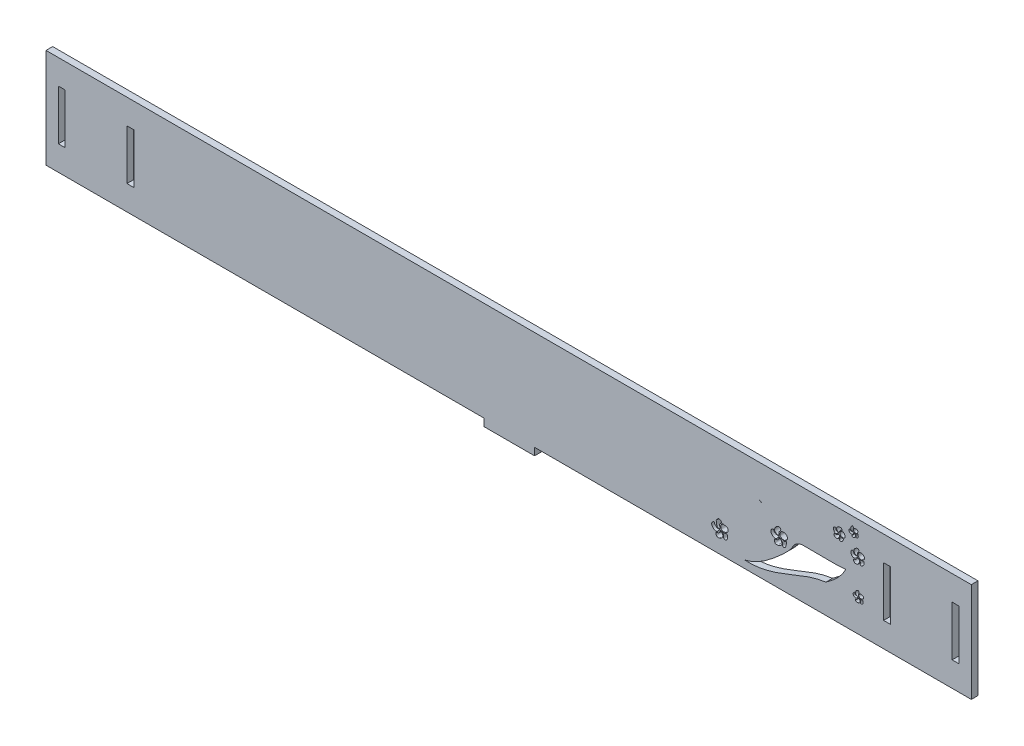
ISO-10303-21;
HEADER;
FILE_DESCRIPTION(('STEP AP214'),'2;1');
FILE_NAME('part.step','',(''),(''),'','','');
FILE_SCHEMA(('AUTOMOTIVE_DESIGN { 1 0 10303 214 1 1 1 1 }'));
ENDSEC;
DATA;
#1=APPLICATION_CONTEXT('core data for automotive mechanical design processes');
#2=APPLICATION_PROTOCOL_DEFINITION('international standard','automotive_design',2000,#1);
#3=PRODUCT_CONTEXT('',#1,'mechanical');
#4=PRODUCT('Part','Part','',(#3));
#5=PRODUCT_RELATED_PRODUCT_CATEGORY('part','',(#4));
#6=PRODUCT_DEFINITION_FORMATION('','',#4);
#7=PRODUCT_DEFINITION_CONTEXT('part definition',#1,'design');
#8=PRODUCT_DEFINITION('design','',#6,#7);
#9=PRODUCT_DEFINITION_SHAPE('','',#8);
#10=(LENGTH_UNIT() NAMED_UNIT(*) SI_UNIT(.MILLI.,.METRE.));
#11=(NAMED_UNIT(*) PLANE_ANGLE_UNIT() SI_UNIT($,.RADIAN.));
#12=(NAMED_UNIT(*) SI_UNIT($,.STERADIAN.) SOLID_ANGLE_UNIT());
#13=UNCERTAINTY_MEASURE_WITH_UNIT(LENGTH_MEASURE(1.E-05),#10,'distance_accuracy_value','');
#14=(GEOMETRIC_REPRESENTATION_CONTEXT(3) GLOBAL_UNCERTAINTY_ASSIGNED_CONTEXT((#13)) GLOBAL_UNIT_ASSIGNED_CONTEXT((#10,
#11,#12)) REPRESENTATION_CONTEXT('',''));
#15=CARTESIAN_POINT('',(0.,0.,0.));
#16=DIRECTION('',(0.,0.,1.));
#17=DIRECTION('',(1.,0.,0.));
#18=AXIS2_PLACEMENT_3D('',#15,#16,#17);
#19=CARTESIAN_POINT('',(182.24385,0.,2.7));
#20=DIRECTION('',(-1.,0.,0.));
#21=DIRECTION('',(0.,0.,1.));
#22=AXIS2_PLACEMENT_3D('',#19,#20,#21);
#23=PLANE('',#22);
#24=DIRECTION('',(0.,1.,0.));
#25=VECTOR('',#24,1.);
#26=CARTESIAN_POINT('',(182.24385,0.,0.));
#27=LINE('',#26,#25);
#28=CARTESIAN_POINT('',(182.24385,-10.12,0.));
#29=VERTEX_POINT('',#28);
#30=CARTESIAN_POINT('',(182.24385,10.12,0.));
#31=VERTEX_POINT('',#30);
#32=EDGE_CURVE('E786',#29,#31,#27,.T.);
#33=ORIENTED_EDGE('',*,*,#32,.F.);
#34=DIRECTION('',(0.,0.,-1.));
#35=VECTOR('',#34,1.);
#36=CARTESIAN_POINT('',(182.24385,-10.12,2.7));
#37=LINE('',#36,#35);
#38=CARTESIAN_POINT('',(182.24385,-10.12,2.7));
#39=VERTEX_POINT('',#38);
#40=EDGE_CURVE('E11',#39,#29,#37,.T.);
#41=ORIENTED_EDGE('',*,*,#40,.F.);
#42=DIRECTION('',(0.,1.,0.));
#43=VECTOR('',#42,1.);
#44=CARTESIAN_POINT('',(182.24385,0.,2.7));
#45=LINE('',#44,#43);
#46=CARTESIAN_POINT('',(182.24385,10.12,2.7));
#47=VERTEX_POINT('',#46);
#48=EDGE_CURVE('E274',#39,#47,#45,.T.);
#49=ORIENTED_EDGE('',*,*,#48,.T.);
#50=DIRECTION('',(0.,0.,-1.));
#51=VECTOR('',#50,1.);
#52=CARTESIAN_POINT('',(182.24385,10.12,2.7));
#53=LINE('',#52,#51);
#54=EDGE_CURVE('E167',#47,#31,#53,.T.);
#55=ORIENTED_EDGE('',*,*,#54,.T.);
#56=EDGE_LOOP('',(#33,#41,#49,#55));
#57=FACE_BOUND('',#56,.T.);
#58=ADVANCED_FACE('F45',(#57),#23,.T.);
#59=CARTESIAN_POINT('',(0.,-10.12,2.7));
#60=DIRECTION('',(0.,1.,0.));
#61=DIRECTION('',(0.,0.,1.));
#62=AXIS2_PLACEMENT_3D('',#59,#60,#61);
#63=PLANE('',#62);
#64=DIRECTION('',(1.,0.,0.));
#65=VECTOR('',#64,1.);
#66=CARTESIAN_POINT('',(0.,-10.12,0.));
#67=LINE('',#66,#65);
#68=CARTESIAN_POINT('',(179.48385,-10.12,0.));
#69=VERTEX_POINT('',#68);
#70=EDGE_CURVE('E261',#69,#29,#67,.T.);
#71=ORIENTED_EDGE('',*,*,#70,.F.);
#72=DIRECTION('',(0.,0.,-1.));
#73=VECTOR('',#72,1.);
#74=CARTESIAN_POINT('',(179.48385,-10.12,2.7));
#75=LINE('',#74,#73);
#76=CARTESIAN_POINT('',(179.48385,-10.12,2.7));
#77=VERTEX_POINT('',#76);
#78=EDGE_CURVE('E57',#77,#69,#75,.T.);
#79=ORIENTED_EDGE('',*,*,#78,.F.);
#80=DIRECTION('',(1.,0.,0.));
#81=VECTOR('',#80,1.);
#82=CARTESIAN_POINT('',(0.,-10.12,2.7));
#83=LINE('',#82,#81);
#84=EDGE_CURVE('E259',#77,#39,#83,.T.);
#85=ORIENTED_EDGE('',*,*,#84,.T.);
#86=ORIENTED_EDGE('',*,*,#40,.T.);
#87=EDGE_LOOP('',(#71,#79,#85,#86));
#88=FACE_BOUND('',#87,.T.);
#89=ADVANCED_FACE('F257',(#88),#63,.T.);
#90=CARTESIAN_POINT('',(179.48385,0.,2.7));
#91=DIRECTION('',(-1.,0.,0.));
#92=DIRECTION('',(0.,0.,1.));
#93=AXIS2_PLACEMENT_3D('',#90,#91,#92);
#94=PLANE('',#93);
#95=DIRECTION('',(0.,1.,0.));
#96=VECTOR('',#95,1.);
#97=CARTESIAN_POINT('',(179.48385,0.,0.));
#98=LINE('',#97,#96);
#99=CARTESIAN_POINT('',(179.48385,10.12,0.));
#100=VERTEX_POINT('',#99);
#101=EDGE_CURVE('E781',#69,#100,#98,.T.);
#102=ORIENTED_EDGE('',*,*,#101,.T.);
#103=DIRECTION('',(0.,0.,-1.));
#104=VECTOR('',#103,1.);
#105=CARTESIAN_POINT('',(179.48385,10.12,2.7));
#106=LINE('',#105,#104);
#107=CARTESIAN_POINT('',(179.48385,10.12,2.7));
#108=VERTEX_POINT('',#107);
#109=EDGE_CURVE('E265',#108,#100,#106,.T.);
#110=ORIENTED_EDGE('',*,*,#109,.F.);
#111=DIRECTION('',(0.,1.,0.));
#112=VECTOR('',#111,1.);
#113=CARTESIAN_POINT('',(179.48385,0.,2.7));
#114=LINE('',#113,#112);
#115=EDGE_CURVE('E268',#77,#108,#114,.T.);
#116=ORIENTED_EDGE('',*,*,#115,.F.);
#117=ORIENTED_EDGE('',*,*,#78,.T.);
#118=EDGE_LOOP('',(#102,#110,#116,#117));
#119=FACE_BOUND('',#118,.T.);
#120=ADVANCED_FACE('F269',(#119),#94,.F.);
#121=CARTESIAN_POINT('',(187.24385,0.,2.7));
#122=DIRECTION('',(1.,0.,0.));
#123=DIRECTION('',(0.,0.,-1.));
#124=AXIS2_PLACEMENT_3D('',#121,#122,#123);
#125=PLANE('',#124);
#126=DIRECTION('',(0.,-1.,0.));
#127=VECTOR('',#126,1.);
#128=CARTESIAN_POINT('',(187.24385,0.,0.));
#129=LINE('',#128,#127);
#130=CARTESIAN_POINT('',(187.24385,20.12,0.));
#131=VERTEX_POINT('',#130);
#132=CARTESIAN_POINT('',(187.24385,-20.12,0.));
#133=VERTEX_POINT('',#132);
#134=EDGE_CURVE('E815',#131,#133,#129,.T.);
#135=ORIENTED_EDGE('',*,*,#134,.F.);
#136=DIRECTION('',(0.,0.,-1.));
#137=VECTOR('',#136,1.);
#138=CARTESIAN_POINT('',(187.24385,20.12,2.7));
#139=LINE('',#138,#137);
#140=CARTESIAN_POINT('',(187.24385,20.12,2.7));
#141=VERTEX_POINT('',#140);
#142=EDGE_CURVE('E529',#141,#131,#139,.T.);
#143=ORIENTED_EDGE('',*,*,#142,.F.);
#144=DIRECTION('',(0.,-1.,0.));
#145=VECTOR('',#144,1.);
#146=CARTESIAN_POINT('',(187.24385,0.,2.7));
#147=LINE('',#146,#145);
#148=CARTESIAN_POINT('',(187.24385,-20.12,2.7));
#149=VERTEX_POINT('',#148);
#150=EDGE_CURVE('E466',#141,#149,#147,.T.);
#151=ORIENTED_EDGE('',*,*,#150,.T.);
#152=DIRECTION('',(0.,0.,-1.));
#153=VECTOR('',#152,1.);
#154=CARTESIAN_POINT('',(187.24385,-20.12,2.7));
#155=LINE('',#154,#153);
#156=EDGE_CURVE('E497',#149,#133,#155,.T.);
#157=ORIENTED_EDGE('',*,*,#156,.T.);
#158=EDGE_LOOP('',(#135,#143,#151,#157));
#159=FACE_BOUND('',#158,.T.);
#160=ADVANCED_FACE('F314',(#159),#125,.T.);
#161=CARTESIAN_POINT('',(0.,20.12,2.7));
#162=DIRECTION('',(0.,-1.,0.));
#163=DIRECTION('',(1.,0.,0.));
#164=AXIS2_PLACEMENT_3D('',#161,#162,#163);
#165=PLANE('',#164);
#166=DIRECTION('',(-1.,0.,0.));
#167=VECTOR('',#166,1.);
#168=CARTESIAN_POINT('',(0.,20.12,0.));
#169=LINE('',#168,#167);
#170=CARTESIAN_POINT('',(-187.24385,20.12,0.));
#171=VERTEX_POINT('',#170);
#172=EDGE_CURVE('E811',#131,#171,#169,.T.);
#173=ORIENTED_EDGE('',*,*,#172,.T.);
#174=DIRECTION('',(0.,0.,-1.));
#175=VECTOR('',#174,1.);
#176=CARTESIAN_POINT('',(-187.24385,20.12,2.7));
#177=LINE('',#176,#175);
#178=CARTESIAN_POINT('',(-187.24385,20.12,2.7));
#179=VERTEX_POINT('',#178);
#180=EDGE_CURVE('E525',#179,#171,#177,.T.);
#181=ORIENTED_EDGE('',*,*,#180,.F.);
#182=DIRECTION('',(-1.,0.,0.));
#183=VECTOR('',#182,1.);
#184=CARTESIAN_POINT('',(0.,20.12,2.7));
#185=LINE('',#184,#183);
#186=EDGE_CURVE('E470',#141,#179,#185,.T.);
#187=ORIENTED_EDGE('',*,*,#186,.F.);
#188=ORIENTED_EDGE('',*,*,#142,.T.);
#189=EDGE_LOOP('',(#173,#181,#187,#188));
#190=FACE_BOUND('',#189,.T.);
#191=ADVANCED_FACE('F343',(#190),#165,.F.);
#192=CARTESIAN_POINT('',(-187.24385,0.,2.7));
#193=DIRECTION('',(1.,0.,0.));
#194=DIRECTION('',(0.,0.,-1.));
#195=AXIS2_PLACEMENT_3D('',#192,#193,#194);
#196=PLANE('',#195);
#197=DIRECTION('',(0.,-1.,0.));
#198=VECTOR('',#197,1.);
#199=CARTESIAN_POINT('',(-187.24385,0.,0.));
#200=LINE('',#199,#198);
#201=CARTESIAN_POINT('',(-187.24385,-20.12,0.));
#202=VERTEX_POINT('',#201);
#203=EDGE_CURVE('E807',#171,#202,#200,.T.);
#204=ORIENTED_EDGE('',*,*,#203,.T.);
#205=DIRECTION('',(0.,0.,-1.));
#206=VECTOR('',#205,1.);
#207=CARTESIAN_POINT('',(-187.24385,-20.12,2.7));
#208=LINE('',#207,#206);
#209=CARTESIAN_POINT('',(-187.24385,-20.12,2.7));
#210=VERTEX_POINT('',#209);
#211=EDGE_CURVE('E522',#210,#202,#208,.T.);
#212=ORIENTED_EDGE('',*,*,#211,.F.);
#213=DIRECTION('',(0.,-1.,0.));
#214=VECTOR('',#213,1.);
#215=CARTESIAN_POINT('',(-187.24385,0.,2.7));
#216=LINE('',#215,#214);
#217=EDGE_CURVE('E474',#179,#210,#216,.T.);
#218=ORIENTED_EDGE('',*,*,#217,.F.);
#219=ORIENTED_EDGE('',*,*,#180,.T.);
#220=EDGE_LOOP('',(#204,#212,#218,#219));
#221=FACE_BOUND('',#220,.T.);
#222=ADVANCED_FACE('F339',(#221),#196,.F.);
#223=CARTESIAN_POINT('',(0.,-20.12,2.7));
#224=DIRECTION('',(0.,-1.,0.));
#225=DIRECTION('',(0.,0.,-1.));
#226=AXIS2_PLACEMENT_3D('',#223,#224,#225);
#227=PLANE('',#226);
#228=DIRECTION('',(-1.,0.,0.));
#229=VECTOR('',#228,1.);
#230=CARTESIAN_POINT('',(0.,-20.12,0.));
#231=LINE('',#230,#229);
#232=CARTESIAN_POINT('',(-10.,-20.12,0.));
#233=VERTEX_POINT('',#232);
#234=EDGE_CURVE('E803',#233,#202,#231,.T.);
#235=ORIENTED_EDGE('',*,*,#234,.F.);
#236=DIRECTION('',(0.,0.,-1.));
#237=VECTOR('',#236,1.);
#238=CARTESIAN_POINT('',(-10.,-20.12,2.7));
#239=LINE('',#238,#237);
#240=CARTESIAN_POINT('',(-10.,-20.12,2.7));
#241=VERTEX_POINT('',#240);
#242=EDGE_CURVE('E519',#241,#233,#239,.T.);
#243=ORIENTED_EDGE('',*,*,#242,.F.);
#244=DIRECTION('',(-1.,0.,0.));
#245=VECTOR('',#244,1.);
#246=CARTESIAN_POINT('',(0.,-20.12,2.7));
#247=LINE('',#246,#245);
#248=EDGE_CURVE('E477',#241,#210,#247,.T.);
#249=ORIENTED_EDGE('',*,*,#248,.T.);
#250=ORIENTED_EDGE('',*,*,#211,.T.);
#251=EDGE_LOOP('',(#235,#243,#249,#250));
#252=FACE_BOUND('',#251,.T.);
#253=ADVANCED_FACE('F335',(#252),#227,.T.);
#254=CARTESIAN_POINT('',(-10.,0.,2.7));
#255=DIRECTION('',(1.,0.,0.));
#256=DIRECTION('',(0.,0.,-1.));
#257=AXIS2_PLACEMENT_3D('',#254,#255,#256);
#258=PLANE('',#257);
#259=DIRECTION('',(0.,-1.,0.));
#260=VECTOR('',#259,1.);
#261=CARTESIAN_POINT('',(-10.,0.,0.));
#262=LINE('',#261,#260);
#263=CARTESIAN_POINT('',(-10.,-23.12,0.));
#264=VERTEX_POINT('',#263);
#265=EDGE_CURVE('E799',#233,#264,#262,.T.);
#266=ORIENTED_EDGE('',*,*,#265,.T.);
#267=DIRECTION('',(0.,0.,-1.));
#268=VECTOR('',#267,1.);
#269=CARTESIAN_POINT('',(-10.,-23.12,2.7));
#270=LINE('',#269,#268);
#271=CARTESIAN_POINT('',(-10.,-23.12,2.7));
#272=VERTEX_POINT('',#271);
#273=EDGE_CURVE('E511',#272,#264,#270,.T.);
#274=ORIENTED_EDGE('',*,*,#273,.F.);
#275=DIRECTION('',(0.,-1.,0.));
#276=VECTOR('',#275,1.);
#277=CARTESIAN_POINT('',(-10.,0.,2.7));
#278=LINE('',#277,#276);
#279=EDGE_CURVE('E481',#241,#272,#278,.T.);
#280=ORIENTED_EDGE('',*,*,#279,.F.);
#281=ORIENTED_EDGE('',*,*,#242,.T.);
#282=EDGE_LOOP('',(#266,#274,#280,#281));
#283=FACE_BOUND('',#282,.T.);
#284=ADVANCED_FACE('F331',(#283),#258,.F.);
#285=CARTESIAN_POINT('',(0.,-23.12,2.7));
#286=DIRECTION('',(0.,1.,0.));
#287=DIRECTION('',(0.,0.,1.));
#288=AXIS2_PLACEMENT_3D('',#285,#286,#287);
#289=PLANE('',#288);
#290=DIRECTION('',(1.,0.,0.));
#291=VECTOR('',#290,1.);
#292=CARTESIAN_POINT('',(0.,-23.12,0.));
#293=LINE('',#292,#291);
#294=CARTESIAN_POINT('',(10.48,-23.12,0.));
#295=VERTEX_POINT('',#294);
#296=EDGE_CURVE('E796',#264,#295,#293,.T.);
#297=ORIENTED_EDGE('',*,*,#296,.T.);
#298=DIRECTION('',(0.,0.,-1.));
#299=VECTOR('',#298,1.);
#300=CARTESIAN_POINT('',(10.48,-23.12,2.7));
#301=LINE('',#300,#299);
#302=CARTESIAN_POINT('',(10.48,-23.12,2.7));
#303=VERTEX_POINT('',#302);
#304=EDGE_CURVE('E502',#303,#295,#301,.T.);
#305=ORIENTED_EDGE('',*,*,#304,.F.);
#306=DIRECTION('',(1.,0.,0.));
#307=VECTOR('',#306,1.);
#308=CARTESIAN_POINT('',(0.,-23.12,2.7));
#309=LINE('',#308,#307);
#310=EDGE_CURVE('E485',#272,#303,#309,.T.);
#311=ORIENTED_EDGE('',*,*,#310,.F.);
#312=ORIENTED_EDGE('',*,*,#273,.T.);
#313=EDGE_LOOP('',(#297,#305,#311,#312));
#314=FACE_BOUND('',#313,.T.);
#315=ADVANCED_FACE('F327',(#314),#289,.F.);
#316=CARTESIAN_POINT('',(10.48,0.,2.7));
#317=DIRECTION('',(1.,0.,0.));
#318=DIRECTION('',(0.,0.,-1.));
#319=AXIS2_PLACEMENT_3D('',#316,#317,#318);
#320=PLANE('',#319);
#321=DIRECTION('',(0.,-1.,0.));
#322=VECTOR('',#321,1.);
#323=CARTESIAN_POINT('',(10.48,0.,0.));
#324=LINE('',#323,#322);
#325=CARTESIAN_POINT('',(10.48,-20.12,0.));
#326=VERTEX_POINT('',#325);
#327=EDGE_CURVE('E505',#326,#295,#324,.T.);
#328=ORIENTED_EDGE('',*,*,#327,.F.);
#329=DIRECTION('',(0.,0.,-1.));
#330=VECTOR('',#329,1.);
#331=CARTESIAN_POINT('',(10.48,-20.12,2.7));
#332=LINE('',#331,#330);
#333=CARTESIAN_POINT('',(10.48,-20.12,2.7));
#334=VERTEX_POINT('',#333);
#335=EDGE_CURVE('E495',#334,#326,#332,.T.);
#336=ORIENTED_EDGE('',*,*,#335,.F.);
#337=DIRECTION('',(0.,-1.,0.));
#338=VECTOR('',#337,1.);
#339=CARTESIAN_POINT('',(10.48,0.,2.7));
#340=LINE('',#339,#338);
#341=EDGE_CURVE('E488',#334,#303,#340,.T.);
#342=ORIENTED_EDGE('',*,*,#341,.T.);
#343=ORIENTED_EDGE('',*,*,#304,.T.);
#344=EDGE_LOOP('',(#328,#336,#342,#343));
#345=FACE_BOUND('',#344,.T.);
#346=ADVANCED_FACE('F323',(#345),#320,.T.);
#347=CARTESIAN_POINT('',(0.,-10.1199999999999,2.7));
#348=DIRECTION('',(0.,-1.,0.));
#349=DIRECTION('',(1.,0.,0.));
#350=AXIS2_PLACEMENT_3D('',#347,#348,#349);
#351=PLANE('',#350);
#352=DIRECTION('',(-1.,0.,0.));
#353=VECTOR('',#352,1.);
#354=CARTESIAN_POINT('',(0.,-10.1199999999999,0.));
#355=LINE('',#354,#353);
#356=CARTESIAN_POINT('',(-179.48385,-10.12,0.));
#357=VERTEX_POINT('',#356);
#358=CARTESIAN_POINT('',(-182.24385,-10.12,0.));
#359=VERTEX_POINT('',#358);
#360=EDGE_CURVE('E831',#357,#359,#355,.T.);
#361=ORIENTED_EDGE('',*,*,#360,.T.);
#362=DIRECTION('',(0.,0.,-1.));
#363=VECTOR('',#362,1.);
#364=CARTESIAN_POINT('',(-182.24385,-10.12,2.7));
#365=LINE('',#364,#363);
#366=CARTESIAN_POINT('',(-182.24385,-10.12,2.7));
#367=VERTEX_POINT('',#366);
#368=EDGE_CURVE('E513',#367,#359,#365,.T.);
#369=ORIENTED_EDGE('',*,*,#368,.F.);
#370=DIRECTION('',(-1.,0.,0.));
#371=VECTOR('',#370,1.);
#372=CARTESIAN_POINT('',(0.,-10.1199999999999,2.7));
#373=LINE('',#372,#371);
#374=CARTESIAN_POINT('',(-179.48385,-10.12,2.7));
#375=VERTEX_POINT('',#374);
#376=EDGE_CURVE('E451',#375,#367,#373,.T.);
#377=ORIENTED_EDGE('',*,*,#376,.F.);
#378=DIRECTION('',(0.,0.,-1.));
#379=VECTOR('',#378,1.);
#380=CARTESIAN_POINT('',(-179.48385,-10.12,2.7));
#381=LINE('',#380,#379);
#382=EDGE_CURVE('E532',#375,#357,#381,.T.);
#383=ORIENTED_EDGE('',*,*,#382,.T.);
#384=EDGE_LOOP('',(#361,#369,#377,#383));
#385=FACE_BOUND('',#384,.T.);
#386=ADVANCED_FACE('F326',(#385),#351,.F.);
#387=CARTESIAN_POINT('',(-182.24385,0.,2.7));
#388=DIRECTION('',(-1.,0.,0.));
#389=DIRECTION('',(0.,0.,1.));
#390=AXIS2_PLACEMENT_3D('',#387,#388,#389);
#391=PLANE('',#390);
#392=DIRECTION('',(0.,1.,0.));
#393=VECTOR('',#392,1.);
#394=CARTESIAN_POINT('',(-182.24385,0.,0.));
#395=LINE('',#394,#393);
#396=CARTESIAN_POINT('',(-182.24385,10.12,0.));
#397=VERTEX_POINT('',#396);
#398=EDGE_CURVE('E827',#359,#397,#395,.T.);
#399=ORIENTED_EDGE('',*,*,#398,.T.);
#400=DIRECTION('',(0.,0.,-1.));
#401=VECTOR('',#400,1.);
#402=CARTESIAN_POINT('',(-182.24385,10.12,2.7));
#403=LINE('',#402,#401);
#404=CARTESIAN_POINT('',(-182.24385,10.12,2.7));
#405=VERTEX_POINT('',#404);
#406=EDGE_CURVE('E539',#405,#397,#403,.T.);
#407=ORIENTED_EDGE('',*,*,#406,.F.);
#408=DIRECTION('',(0.,1.,0.));
#409=VECTOR('',#408,1.);
#410=CARTESIAN_POINT('',(-182.24385,0.,2.7));
#411=LINE('',#410,#409);
#412=EDGE_CURVE('E455',#367,#405,#411,.T.);
#413=ORIENTED_EDGE('',*,*,#412,.F.);
#414=ORIENTED_EDGE('',*,*,#368,.T.);
#415=EDGE_LOOP('',(#399,#407,#413,#414));
#416=FACE_BOUND('',#415,.T.);
#417=ADVANCED_FACE('F359',(#416),#391,.F.);
#418=CARTESIAN_POINT('',(0.,10.1200000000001,2.7));
#419=DIRECTION('',(0.,-1.,0.));
#420=DIRECTION('',(1.,0.,0.));
#421=AXIS2_PLACEMENT_3D('',#418,#419,#420);
#422=PLANE('',#421);
#423=DIRECTION('',(-1.,0.,0.));
#424=VECTOR('',#423,1.);
#425=CARTESIAN_POINT('',(0.,10.1200000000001,0.));
#426=LINE('',#425,#424);
#427=CARTESIAN_POINT('',(-179.48385,10.12,0.));
#428=VERTEX_POINT('',#427);
#429=EDGE_CURVE('E823',#428,#397,#426,.T.);
#430=ORIENTED_EDGE('',*,*,#429,.F.);
#431=DIRECTION('',(0.,0.,-1.));
#432=VECTOR('',#431,1.);
#433=CARTESIAN_POINT('',(-179.48385,10.12,2.7));
#434=LINE('',#433,#432);
#435=CARTESIAN_POINT('',(-179.48385,10.12,2.7));
#436=VERTEX_POINT('',#435);
#437=EDGE_CURVE('E535',#436,#428,#434,.T.);
#438=ORIENTED_EDGE('',*,*,#437,.F.);
#439=DIRECTION('',(-1.,0.,0.));
#440=VECTOR('',#439,1.);
#441=CARTESIAN_POINT('',(0.,10.1200000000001,2.7));
#442=LINE('',#441,#440);
#443=EDGE_CURVE('E458',#436,#405,#442,.T.);
#444=ORIENTED_EDGE('',*,*,#443,.T.);
#445=ORIENTED_EDGE('',*,*,#406,.T.);
#446=EDGE_LOOP('',(#430,#438,#444,#445));
#447=FACE_BOUND('',#446,.T.);
#448=ADVANCED_FACE('F355',(#447),#422,.T.);
#449=CARTESIAN_POINT('',(0.,10.0695,2.7));
#450=DIRECTION('',(0.,1.,0.));
#451=DIRECTION('',(0.,0.,1.));
#452=AXIS2_PLACEMENT_3D('',#449,#450,#451);
#453=PLANE('',#452);
#454=DIRECTION('',(1.,0.,0.));
#455=VECTOR('',#454,1.);
#456=CARTESIAN_POINT('',(0.,10.0695,0.));
#457=LINE('',#456,#455);
#458=CARTESIAN_POINT('',(-154.48385,10.0695,0.));
#459=VERTEX_POINT('',#458);
#460=CARTESIAN_POINT('',(-151.72385,10.0695,0.));
#461=VERTEX_POINT('',#460);
#462=EDGE_CURVE('E847',#459,#461,#457,.T.);
#463=ORIENTED_EDGE('',*,*,#462,.T.);
#464=DIRECTION('',(0.,0.,-1.));
#465=VECTOR('',#464,1.);
#466=CARTESIAN_POINT('',(-151.72385,10.0695,2.7));
#467=LINE('',#466,#465);
#468=CARTESIAN_POINT('',(-151.72385,10.0695,2.7));
#469=VERTEX_POINT('',#468);
#470=EDGE_CURVE('E536',#469,#461,#467,.T.);
#471=ORIENTED_EDGE('',*,*,#470,.F.);
#472=DIRECTION('',(1.,0.,0.));
#473=VECTOR('',#472,1.);
#474=CARTESIAN_POINT('',(0.,10.0695,2.7));
#475=LINE('',#474,#473);
#476=CARTESIAN_POINT('',(-154.48385,10.0695,2.7));
#477=VERTEX_POINT('',#476);
#478=EDGE_CURVE('E436',#477,#469,#475,.T.);
#479=ORIENTED_EDGE('',*,*,#478,.F.);
#480=DIRECTION('',(0.,0.,-1.));
#481=VECTOR('',#480,1.);
#482=CARTESIAN_POINT('',(-154.48385,10.0695,2.7));
#483=LINE('',#482,#481);
#484=EDGE_CURVE('E545',#477,#459,#483,.T.);
#485=ORIENTED_EDGE('',*,*,#484,.T.);
#486=EDGE_LOOP('',(#463,#471,#479,#485));
#487=FACE_BOUND('',#486,.T.);
#488=ADVANCED_FACE('F358',(#487),#453,.F.);
#489=CARTESIAN_POINT('',(-151.72385,0.,2.7));
#490=DIRECTION('',(1.,0.,0.));
#491=DIRECTION('',(0.,0.,-1.));
#492=AXIS2_PLACEMENT_3D('',#489,#490,#491);
#493=PLANE('',#492);
#494=DIRECTION('',(0.,-1.,0.));
#495=VECTOR('',#494,1.);
#496=CARTESIAN_POINT('',(-151.72385,0.,0.));
#497=LINE('',#496,#495);
#498=CARTESIAN_POINT('',(-151.72385,-10.1705,0.));
#499=VERTEX_POINT('',#498);
#500=EDGE_CURVE('E843',#461,#499,#497,.T.);
#501=ORIENTED_EDGE('',*,*,#500,.T.);
#502=DIRECTION('',(0.,0.,-1.));
#503=VECTOR('',#502,1.);
#504=CARTESIAN_POINT('',(-151.72385,-10.1705,2.7));
#505=LINE('',#504,#503);
#506=CARTESIAN_POINT('',(-151.72385,-10.1705,2.7));
#507=VERTEX_POINT('',#506);
#508=EDGE_CURVE('E552',#507,#499,#505,.T.);
#509=ORIENTED_EDGE('',*,*,#508,.F.);
#510=DIRECTION('',(0.,-1.,0.));
#511=VECTOR('',#510,1.);
#512=CARTESIAN_POINT('',(-151.72385,0.,2.7));
#513=LINE('',#512,#511);
#514=EDGE_CURVE('E440',#469,#507,#513,.T.);
#515=ORIENTED_EDGE('',*,*,#514,.F.);
#516=ORIENTED_EDGE('',*,*,#470,.T.);
#517=EDGE_LOOP('',(#501,#509,#515,#516));
#518=FACE_BOUND('',#517,.T.);
#519=ADVANCED_FACE('F375',(#518),#493,.F.);
#520=CARTESIAN_POINT('',(0.,-10.1705,2.7));
#521=DIRECTION('',(0.,1.,0.));
#522=DIRECTION('',(0.,0.,1.));
#523=AXIS2_PLACEMENT_3D('',#520,#521,#522);
#524=PLANE('',#523);
#525=DIRECTION('',(1.,0.,0.));
#526=VECTOR('',#525,1.);
#527=CARTESIAN_POINT('',(0.,-10.1705,0.));
#528=LINE('',#527,#526);
#529=CARTESIAN_POINT('',(-154.48385,-10.1705,0.));
#530=VERTEX_POINT('',#529);
#531=EDGE_CURVE('E839',#530,#499,#528,.T.);
#532=ORIENTED_EDGE('',*,*,#531,.F.);
#533=DIRECTION('',(0.,0.,-1.));
#534=VECTOR('',#533,1.);
#535=CARTESIAN_POINT('',(-154.48385,-10.1705,2.7));
#536=LINE('',#535,#534);
#537=CARTESIAN_POINT('',(-154.48385,-10.1705,2.7));
#538=VERTEX_POINT('',#537);
#539=EDGE_CURVE('E548',#538,#530,#536,.T.);
#540=ORIENTED_EDGE('',*,*,#539,.F.);
#541=DIRECTION('',(1.,0.,0.));
#542=VECTOR('',#541,1.);
#543=CARTESIAN_POINT('',(0.,-10.1705,2.7));
#544=LINE('',#543,#542);
#545=EDGE_CURVE('E443',#538,#507,#544,.T.);
#546=ORIENTED_EDGE('',*,*,#545,.T.);
#547=ORIENTED_EDGE('',*,*,#508,.T.);
#548=EDGE_LOOP('',(#532,#540,#546,#547));
#549=FACE_BOUND('',#548,.T.);
#550=ADVANCED_FACE('F371',(#549),#524,.T.);
#551=CARTESIAN_POINT('',(0.,10.0694999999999,2.7));
#552=DIRECTION('',(0.,-1.,0.));
#553=DIRECTION('',(1.,0.,0.));
#554=AXIS2_PLACEMENT_3D('',#551,#552,#553);
#555=PLANE('',#554);
#556=DIRECTION('',(-1.,0.,0.));
#557=VECTOR('',#556,1.);
#558=CARTESIAN_POINT('',(0.,10.0694999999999,0.));
#559=LINE('',#558,#557);
#560=CARTESIAN_POINT('',(154.48385,10.0695,0.));
#561=VERTEX_POINT('',#560);
#562=CARTESIAN_POINT('',(151.72385,10.0695,0.));
#563=VERTEX_POINT('',#562);
#564=EDGE_CURVE('E863',#561,#563,#559,.T.);
#565=ORIENTED_EDGE('',*,*,#564,.F.);
#566=DIRECTION('',(0.,0.,-1.));
#567=VECTOR('',#566,1.);
#568=CARTESIAN_POINT('',(154.48385,10.0695,2.7));
#569=LINE('',#568,#567);
#570=CARTESIAN_POINT('',(154.48385,10.0695,2.7));
#571=VERTEX_POINT('',#570);
#572=EDGE_CURVE('E549',#571,#561,#569,.T.);
#573=ORIENTED_EDGE('',*,*,#572,.F.);
#574=DIRECTION('',(-1.,0.,0.));
#575=VECTOR('',#574,1.);
#576=CARTESIAN_POINT('',(0.,10.0694999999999,2.7));
#577=LINE('',#576,#575);
#578=CARTESIAN_POINT('',(151.72385,10.0695,2.7));
#579=VERTEX_POINT('',#578);
#580=EDGE_CURVE('E413',#571,#579,#577,.T.);
#581=ORIENTED_EDGE('',*,*,#580,.T.);
#582=DIRECTION('',(0.,0.,-1.));
#583=VECTOR('',#582,1.);
#584=CARTESIAN_POINT('',(151.72385,10.0695,2.7));
#585=LINE('',#584,#583);
#586=EDGE_CURVE('E558',#579,#563,#585,.T.);
#587=ORIENTED_EDGE('',*,*,#586,.T.);
#588=EDGE_LOOP('',(#565,#573,#581,#587));
#589=FACE_BOUND('',#588,.T.);
#590=ADVANCED_FACE('F374',(#589),#555,.T.);
#591=CARTESIAN_POINT('',(154.48385,0.,2.7));
#592=DIRECTION('',(1.,0.,0.));
#593=DIRECTION('',(0.,0.,-1.));
#594=AXIS2_PLACEMENT_3D('',#591,#592,#593);
#595=PLANE('',#594);
#596=DIRECTION('',(0.,-1.,0.));
#597=VECTOR('',#596,1.);
#598=CARTESIAN_POINT('',(154.48385,0.,0.));
#599=LINE('',#598,#597);
#600=CARTESIAN_POINT('',(154.48385,-10.1705,0.));
#601=VERTEX_POINT('',#600);
#602=EDGE_CURVE('E859',#561,#601,#599,.T.);
#603=ORIENTED_EDGE('',*,*,#602,.T.);
#604=DIRECTION('',(0.,0.,-1.));
#605=VECTOR('',#604,1.);
#606=CARTESIAN_POINT('',(154.48385,-10.1705,2.7));
#607=LINE('',#606,#605);
#608=CARTESIAN_POINT('',(154.48385,-10.1705,2.7));
#609=VERTEX_POINT('',#608);
#610=EDGE_CURVE('E565',#609,#601,#607,.T.);
#611=ORIENTED_EDGE('',*,*,#610,.F.);
#612=DIRECTION('',(0.,-1.,0.));
#613=VECTOR('',#612,1.);
#614=CARTESIAN_POINT('',(154.48385,0.,2.7));
#615=LINE('',#614,#613);
#616=EDGE_CURVE('E425',#571,#609,#615,.T.);
#617=ORIENTED_EDGE('',*,*,#616,.F.);
#618=ORIENTED_EDGE('',*,*,#572,.T.);
#619=EDGE_LOOP('',(#603,#611,#617,#618));
#620=FACE_BOUND('',#619,.T.);
#621=ADVANCED_FACE('F391',(#620),#595,.F.);
#622=CARTESIAN_POINT('',(0.,-10.1705000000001,2.7));
#623=DIRECTION('',(0.,-1.,0.));
#624=DIRECTION('',(1.,0.,0.));
#625=AXIS2_PLACEMENT_3D('',#622,#623,#624);
#626=PLANE('',#625);
#627=DIRECTION('',(-1.,0.,0.));
#628=VECTOR('',#627,1.);
#629=CARTESIAN_POINT('',(0.,-10.1705000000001,0.));
#630=LINE('',#629,#628);
#631=CARTESIAN_POINT('',(151.72385,-10.1705,0.));
#632=VERTEX_POINT('',#631);
#633=EDGE_CURVE('E855',#601,#632,#630,.T.);
#634=ORIENTED_EDGE('',*,*,#633,.T.);
#635=DIRECTION('',(0.,0.,-1.));
#636=VECTOR('',#635,1.);
#637=CARTESIAN_POINT('',(151.72385,-10.1705,2.7));
#638=LINE('',#637,#636);
#639=CARTESIAN_POINT('',(151.72385,-10.1705,2.7));
#640=VERTEX_POINT('',#639);
#641=EDGE_CURVE('E561',#640,#632,#638,.T.);
#642=ORIENTED_EDGE('',*,*,#641,.F.);
#643=DIRECTION('',(-1.,0.,0.));
#644=VECTOR('',#643,1.);
#645=CARTESIAN_POINT('',(0.,-10.1705000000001,2.7));
#646=LINE('',#645,#644);
#647=EDGE_CURVE('E429',#609,#640,#646,.T.);
#648=ORIENTED_EDGE('',*,*,#647,.F.);
#649=ORIENTED_EDGE('',*,*,#610,.T.);
#650=EDGE_LOOP('',(#634,#642,#648,#649));
#651=FACE_BOUND('',#650,.T.);
#652=ADVANCED_FACE('F387',(#651),#626,.F.);
#653=CARTESIAN_POINT('',(95.4284842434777,-17.1041454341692,2.7));
#654=CARTESIAN_POINT('',(103.607062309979,-17.6622345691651,2.7));
#655=CARTESIAN_POINT('',(112.60385200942,-13.2724615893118,2.7));
#656=CARTESIAN_POINT('',(124.423597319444,-8.95915717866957,2.7));
#657=CARTESIAN_POINT('',(130.986682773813,-7.91820070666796,2.7));
#658=CARTESIAN_POINT('',(137.285304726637,-8.60995353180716,2.7));
#659=CARTESIAN_POINT('',(143.135136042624,-10.7100908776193,2.7));
#660=CARTESIAN_POINT('',(147.50863873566,-12.7185162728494,2.7));
#661=CARTESIAN_POINT('',(148.81012366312,-15.1547667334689,2.7));
#662=B_SPLINE_CURVE_WITH_KNOTS('',3,(#653,#654,#655,#656,#657,#658,#659,#660,#661),
.UNSPECIFIED.,.F.,.F.,(4,1,1,1,1,1,4),(0.,0.413763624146,0.525137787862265,0.667073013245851,
0.761800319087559,0.856811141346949,1.),.UNSPECIFIED.);
#663=DIRECTION('',(0.,0.,-1.));
#664=VECTOR('',#663,1.);
#665=SURFACE_OF_LINEAR_EXTRUSION('',#662,#664);
#666=CARTESIAN_POINT('',(95.4284842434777,-17.1041454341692,0.));
#667=CARTESIAN_POINT('',(103.607062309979,-17.6622345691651,0.));
#668=CARTESIAN_POINT('',(112.60385200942,-13.2724615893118,0.));
#669=CARTESIAN_POINT('',(124.423597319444,-8.95915717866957,0.));
#670=CARTESIAN_POINT('',(130.986682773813,-7.91820070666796,0.));
#671=CARTESIAN_POINT('',(137.285304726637,-8.60995353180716,0.));
#672=CARTESIAN_POINT('',(143.135136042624,-10.7100908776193,0.));
#673=CARTESIAN_POINT('',(147.50863873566,-12.7185162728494,0.));
#674=CARTESIAN_POINT('',(148.81012366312,-15.1547667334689,0.));
#675=B_SPLINE_CURVE_WITH_KNOTS('',3,(#666,#667,#668,#669,#670,#671,#672,#673,#674),
.UNSPECIFIED.,.F.,.F.,(4,1,1,1,1,1,4),(0.,0.413763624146,0.525137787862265,0.667073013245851,
0.761800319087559,0.856811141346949,1.),.UNSPECIFIED.);
#676=CARTESIAN_POINT('',(95.4284842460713,-17.1041454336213,0.));
#677=VERTEX_POINT('',#676);
#678=CARTESIAN_POINT('',(128.385653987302,-8.43269491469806,0.));
#679=VERTEX_POINT('',#678);
#680=EDGE_CURVE('E1080',#677,#679,#675,.T.);
#681=ORIENTED_EDGE('',*,*,#680,.F.);
#682=DIRECTION('',(0.,0.,-1.));
#683=VECTOR('',#682,1.);
#684=CARTESIAN_POINT('',(95.4284842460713,-17.1041454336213,2.7));
#685=LINE('',#684,#683);
#686=CARTESIAN_POINT('',(95.4284842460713,-17.1041454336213,2.7));
#687=VERTEX_POINT('',#686);
#688=EDGE_CURVE('E562',#687,#677,#685,.T.);
#689=ORIENTED_EDGE('',*,*,#688,.F.);
#690=CARTESIAN_POINT('',(128.385653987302,-8.43269491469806,2.7));
#691=VERTEX_POINT('',#690);
#692=EDGE_CURVE('E1948',#687,#691,#662,.T.);
#693=ORIENTED_EDGE('',*,*,#692,.T.);
#694=DIRECTION('',(0.,0.,-1.));
#695=VECTOR('',#694,1.);
#696=CARTESIAN_POINT('',(128.385653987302,-8.43269491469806,2.7));
#697=LINE('',#696,#695);
#698=EDGE_CURVE('E571',#691,#679,#697,.T.);
#699=ORIENTED_EDGE('',*,*,#698,.T.);
#700=EDGE_LOOP('',(#681,#689,#693,#699));
#701=FACE_BOUND('',#700,.T.);
#702=ADVANCED_FACE('F390',(#701),#665,.T.);
#703=CARTESIAN_POINT('',(72.5054905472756,-8.20914267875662,2.7));
#704=CARTESIAN_POINT('',(75.5811377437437,-13.0962328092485,2.7));
#705=CARTESIAN_POINT('',(83.0045308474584,-16.0628701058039,2.7));
#706=CARTESIAN_POINT('',(96.7754008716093,-18.6394343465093,2.7));
#707=CARTESIAN_POINT('',(109.158186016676,-9.58371060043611,2.7));
#708=CARTESIAN_POINT('',(118.979442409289,0.438644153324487,2.7));
#709=CARTESIAN_POINT('',(120.249900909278,15.6649363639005,2.7));
#710=CARTESIAN_POINT('',(103.544963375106,16.3819425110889,2.7));
#711=CARTESIAN_POINT('',(104.670037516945,5.27108343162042,2.7));
#712=CARTESIAN_POINT('',(110.292881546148,3.19192222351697,2.7));
#713=CARTESIAN_POINT('',(112.714676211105,6.07075503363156,2.7));
#714=B_SPLINE_CURVE_WITH_KNOTS('',3,(#703,#704,#705,#706,#707,#708,#709,#710,#711,#712,#713),
.UNSPECIFIED.,.F.,.F.,(4,1,1,1,1,1,1,1,4),(0.,0.173573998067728,0.252148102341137,
0.438760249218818,0.620395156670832,0.709464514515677,0.849239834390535,0.908512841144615,1.),.UNSPECIFIED.);
#715=DIRECTION('',(0.,0.,-1.));
#716=VECTOR('',#715,1.);
#717=SURFACE_OF_LINEAR_EXTRUSION('',#714,#716);
#718=CARTESIAN_POINT('',(72.5054905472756,-8.20914267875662,0.));
#719=CARTESIAN_POINT('',(75.5811377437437,-13.0962328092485,0.));
#720=CARTESIAN_POINT('',(83.0045308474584,-16.0628701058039,0.));
#721=CARTESIAN_POINT('',(96.7754008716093,-18.6394343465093,0.));
#722=CARTESIAN_POINT('',(109.158186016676,-9.58371060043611,0.));
#723=CARTESIAN_POINT('',(118.979442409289,0.438644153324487,0.));
#724=CARTESIAN_POINT('',(120.249900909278,15.6649363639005,0.));
#725=CARTESIAN_POINT('',(103.544963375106,16.3819425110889,0.));
#726=CARTESIAN_POINT('',(104.670037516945,5.27108343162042,0.));
#727=CARTESIAN_POINT('',(110.292881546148,3.19192222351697,0.));
#728=CARTESIAN_POINT('',(112.714676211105,6.07075503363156,0.));
#729=B_SPLINE_CURVE_WITH_KNOTS('',3,(#718,#719,#720,#721,#722,#723,#724,#725,#726,#727,#728),
.UNSPECIFIED.,.F.,.F.,(4,1,1,1,1,1,1,1,4),(0.,0.173573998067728,0.252148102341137,
0.438760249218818,0.620395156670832,0.709464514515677,0.849239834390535,0.908512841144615,1.),.UNSPECIFIED.);
#730=CARTESIAN_POINT('',(114.59361012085,-3.47046004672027,0.));
#731=VERTEX_POINT('',#730);
#732=EDGE_CURVE('E1071',#677,#731,#729,.T.);
#733=ORIENTED_EDGE('',*,*,#732,.T.);
#734=DIRECTION('',(0.,0.,-1.));
#735=VECTOR('',#734,1.);
#736=CARTESIAN_POINT('',(114.59361012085,-3.47046004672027,2.7));
#737=LINE('',#736,#735);
#738=CARTESIAN_POINT('',(114.59361012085,-3.47046004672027,2.7));
#739=VERTEX_POINT('',#738);
#740=EDGE_CURVE('E577',#739,#731,#737,.T.);
#741=ORIENTED_EDGE('',*,*,#740,.F.);
#742=EDGE_CURVE('E1130',#687,#739,#714,.T.);
#743=ORIENTED_EDGE('',*,*,#742,.F.);
#744=ORIENTED_EDGE('',*,*,#688,.T.);
#745=EDGE_LOOP('',(#733,#741,#743,#744));
#746=FACE_BOUND('',#745,.T.);
#747=ADVANCED_FACE('F1109',(#746),#717,.F.);
#748=CARTESIAN_POINT('',(114.593610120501,-3.4704600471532,2.7));
#749=CARTESIAN_POINT('',(116.254782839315,0.475354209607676,2.7));
#750=CARTESIAN_POINT('',(120.742284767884,-0.303353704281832,2.7));
#751=CARTESIAN_POINT('',(127.302238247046,-0.124089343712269,2.7));
#752=CARTESIAN_POINT('',(133.478660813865,-0.362353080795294,2.7));
#753=CARTESIAN_POINT('',(142.541783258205,0.643452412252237,2.7));
#754=CARTESIAN_POINT('',(148.091551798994,6.22565948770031,2.7));
#755=CARTESIAN_POINT('',(148.956002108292,10.1551435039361,2.7));
#756=B_SPLINE_CURVE_WITH_KNOTS('',3,(#748,#749,#750,#751,#752,#753,#754,#755),.UNSPECIFIED.,.F.,
.F.,(4,1,1,1,1,4),(0.,0.22943892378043,0.319277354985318,0.499580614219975,0.695785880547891,
1.),.UNSPECIFIED.);
#757=DIRECTION('',(0.,0.,-1.));
#758=VECTOR('',#757,1.);
#759=SURFACE_OF_LINEAR_EXTRUSION('',#756,#758);
#760=CARTESIAN_POINT('',(114.593610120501,-3.4704600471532,0.));
#761=CARTESIAN_POINT('',(116.254782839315,0.475354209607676,0.));
#762=CARTESIAN_POINT('',(120.742284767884,-0.303353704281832,0.));
#763=CARTESIAN_POINT('',(127.302238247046,-0.124089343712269,0.));
#764=CARTESIAN_POINT('',(133.478660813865,-0.362353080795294,0.));
#765=CARTESIAN_POINT('',(142.541783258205,0.643452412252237,0.));
#766=CARTESIAN_POINT('',(148.091551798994,6.22565948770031,0.));
#767=CARTESIAN_POINT('',(148.956002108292,10.1551435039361,0.));
#768=B_SPLINE_CURVE_WITH_KNOTS('',3,(#760,#761,#762,#763,#764,#765,#766,#767),.UNSPECIFIED.,.F.,
.F.,(4,1,1,1,1,4),(0.,0.22943892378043,0.319277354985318,0.499580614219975,0.695785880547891,
1.),.UNSPECIFIED.);
#769=CARTESIAN_POINT('',(136.378705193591,0.0518392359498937,0.));
#770=VERTEX_POINT('',#769);
#771=EDGE_CURVE('E1062',#731,#770,#768,.T.);
#772=ORIENTED_EDGE('',*,*,#771,.T.);
#773=DIRECTION('',(0.,0.,-1.));
#774=VECTOR('',#773,1.);
#775=CARTESIAN_POINT('',(136.378705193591,0.0518392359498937,2.7));
#776=LINE('',#775,#774);
#777=CARTESIAN_POINT('',(136.378705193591,0.0518392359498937,2.7));
#778=VERTEX_POINT('',#777);
#779=EDGE_CURVE('E574',#778,#770,#776,.T.);
#780=ORIENTED_EDGE('',*,*,#779,.F.);
#781=EDGE_CURVE('E1124',#739,#778,#756,.T.);
#782=ORIENTED_EDGE('',*,*,#781,.F.);
#783=ORIENTED_EDGE('',*,*,#740,.T.);
#784=EDGE_LOOP('',(#772,#780,#782,#783));
#785=FACE_BOUND('',#784,.T.);
#786=ADVANCED_FACE('F1105',(#785),#759,.F.);
#787=CARTESIAN_POINT('',(102.606928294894,-13.9776466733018,2.7));
#788=CARTESIAN_POINT('',(104.995680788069,-9.48016949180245,2.7));
#789=CARTESIAN_POINT('',(109.091047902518,7.11434380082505,2.7));
#790=CARTESIAN_POINT('',(96.3780918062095,8.5804371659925,2.7));
#791=CARTESIAN_POINT('',(93.299025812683,7.94968894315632,2.7));
#792=B_SPLINE_CURVE_WITH_KNOTS('',3,(#787,#788,#789,#790,#791),.UNSPECIFIED.,.F.,.F.,(4,1,4),
(0.,0.678241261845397,1.),.UNSPECIFIED.);
#793=DIRECTION('',(0.,0.,-1.));
#794=VECTOR('',#793,1.);
#795=SURFACE_OF_LINEAR_EXTRUSION('',#792,#794);
#796=CARTESIAN_POINT('',(102.606928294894,-13.9776466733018,0.));
#797=CARTESIAN_POINT('',(104.995680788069,-9.48016949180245,0.));
#798=CARTESIAN_POINT('',(109.091047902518,7.11434380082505,0.));
#799=CARTESIAN_POINT('',(96.3780918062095,8.5804371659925,0.));
#800=CARTESIAN_POINT('',(93.299025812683,7.94968894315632,0.));
#801=B_SPLINE_CURVE_WITH_KNOTS('',3,(#796,#797,#798,#799,#800),.UNSPECIFIED.,.F.,.F.,(4,1,4),
(0.,0.678241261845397,1.),.UNSPECIFIED.);
#802=CARTESIAN_POINT('',(102.818957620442,6.07075503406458,0.));
#803=VERTEX_POINT('',#802);
#804=CARTESIAN_POINT('',(101.460338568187,6.98853593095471,0.));
#805=VERTEX_POINT('',#804);
#806=EDGE_CURVE('E606',#803,#805,#801,.T.);
#807=ORIENTED_EDGE('',*,*,#806,.F.);
#808=DIRECTION('',(0.,0.,-1.));
#809=VECTOR('',#808,1.);
#810=CARTESIAN_POINT('',(102.818957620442,6.07075503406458,2.7));
#811=LINE('',#810,#809);
#812=CARTESIAN_POINT('',(102.818957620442,6.07075503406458,2.7));
#813=VERTEX_POINT('',#812);
#814=EDGE_CURVE('E50',#813,#803,#811,.T.);
#815=ORIENTED_EDGE('',*,*,#814,.F.);
#816=CARTESIAN_POINT('',(101.460338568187,6.98853593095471,2.7));
#817=VERTEX_POINT('',#816);
#818=EDGE_CURVE('E774',#813,#817,#792,.T.);
#819=ORIENTED_EDGE('',*,*,#818,.T.);
#820=DIRECTION('',(0.,0.,-1.));
#821=VECTOR('',#820,1.);
#822=CARTESIAN_POINT('',(101.460338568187,6.98853593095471,2.7));
#823=LINE('',#822,#821);
#824=EDGE_CURVE('E582',#817,#805,#823,.T.);
#825=ORIENTED_EDGE('',*,*,#824,.T.);
#826=EDGE_LOOP('',(#807,#815,#819,#825));
#827=FACE_BOUND('',#826,.T.);
#828=ADVANCED_FACE('F47',(#827),#795,.T.);
#829=CARTESIAN_POINT('',(86.432511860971,-11.80582423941,2.7));
#830=CARTESIAN_POINT('',(86.7139847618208,-11.9640885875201,2.7));
#831=CARTESIAN_POINT('',(87.1720546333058,-12.3251458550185,2.7));
#832=CARTESIAN_POINT('',(86.8095871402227,-13.2605309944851,2.7));
#833=CARTESIAN_POINT('',(87.2421464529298,-14.1886923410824,2.7));
#834=CARTESIAN_POINT('',(88.2486982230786,-13.9657691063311,2.7));
#835=CARTESIAN_POINT('',(88.5345059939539,-13.0391790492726,2.7));
#836=CARTESIAN_POINT('',(88.8288895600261,-12.140846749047,2.7));
#837=CARTESIAN_POINT('',(88.1085603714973,-11.4784963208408,2.7));
#838=CARTESIAN_POINT('',(87.364622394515,-12.0010658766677,2.7));
#839=CARTESIAN_POINT('',(86.9032847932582,-11.6387405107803,2.7));
#840=CARTESIAN_POINT('',(86.0046266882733,-11.5817264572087,2.7));
#841=CARTESIAN_POINT('',(86.3084653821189,-11.7360763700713,2.7));
#842=CARTESIAN_POINT('',(86.432511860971,-11.80582423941,2.7));
#843=B_SPLINE_CURVE_WITH_KNOTS('',3,(#829,#830,#831,#832,#833,#834,#835,#836,#837,#838,#839,
#840,#841,#842),.UNSPECIFIED.,.T.,.F.,(4,1,1,1,1,1,1,1,1,1,1,4),(0.,0.0879493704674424,
0.22605378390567,0.303514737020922,0.413971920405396,0.497666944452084,0.652858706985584,
0.716899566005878,0.793639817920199,0.918274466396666,0.961240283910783,1.),.UNSPECIFIED.);
#844=DIRECTION('',(0.,0.,-1.));
#845=VECTOR('',#844,1.);
#846=SURFACE_OF_LINEAR_EXTRUSION('',#843,#845);
#847=CARTESIAN_POINT('',(86.432511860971,-11.80582423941,2.7));
#848=VERTEX_POINT('',#847);
#849=EDGE_CURVE('E590',#848,#848,#843,.T.);
#850=ORIENTED_EDGE('',*,*,#849,.T.);
#851=EDGE_LOOP('',(#850));
#852=FACE_BOUND('',#851,.T.);
#853=CARTESIAN_POINT('',(86.432511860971,-11.80582423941,0.));
#854=CARTESIAN_POINT('',(86.7139847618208,-11.9640885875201,0.));
#855=CARTESIAN_POINT('',(87.1720546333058,-12.3251458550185,0.));
#856=CARTESIAN_POINT('',(86.8095871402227,-13.2605309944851,0.));
#857=CARTESIAN_POINT('',(87.2421464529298,-14.1886923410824,0.));
#858=CARTESIAN_POINT('',(88.2486982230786,-13.9657691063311,0.));
#859=CARTESIAN_POINT('',(88.5345059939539,-13.0391790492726,0.));
#860=CARTESIAN_POINT('',(88.8288895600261,-12.140846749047,0.));
#861=CARTESIAN_POINT('',(88.1085603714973,-11.4784963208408,0.));
#862=CARTESIAN_POINT('',(87.364622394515,-12.0010658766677,0.));
#863=CARTESIAN_POINT('',(86.9032847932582,-11.6387405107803,0.));
#864=CARTESIAN_POINT('',(86.0046266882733,-11.5817264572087,0.));
#865=CARTESIAN_POINT('',(86.3084653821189,-11.7360763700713,0.));
#866=CARTESIAN_POINT('',(86.432511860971,-11.80582423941,0.));
#867=B_SPLINE_CURVE_WITH_KNOTS('',3,(#853,#854,#855,#856,#857,#858,#859,#860,#861,#862,#863,
#864,#865,#866),.UNSPECIFIED.,.T.,.F.,(4,1,1,1,1,1,1,1,1,1,1,4),(0.,0.0879493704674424,
0.22605378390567,0.303514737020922,0.413971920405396,0.497666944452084,0.652858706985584,
0.716899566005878,0.793639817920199,0.918274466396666,0.961240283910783,1.),.UNSPECIFIED.);
#868=CARTESIAN_POINT('',(86.432511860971,-11.80582423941,0.));
#869=VERTEX_POINT('',#868);
#870=EDGE_CURVE('E756',#869,#869,#867,.T.);
#871=ORIENTED_EDGE('',*,*,#870,.F.);
#872=EDGE_LOOP('',(#871));
#873=FACE_BOUND('',#872,.T.);
#874=ADVANCED_FACE('F622',(#852,#873),#846,.T.);
#875=CARTESIAN_POINT('',(85.6912088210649,-11.6294668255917,2.7));
#876=CARTESIAN_POINT('',(85.5897367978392,-11.7011003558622,2.7));
#877=CARTESIAN_POINT('',(85.5680654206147,-12.5019099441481,2.7));
#878=CARTESIAN_POINT('',(84.8686883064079,-13.0260901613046,2.7));
#879=CARTESIAN_POINT('',(83.7726691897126,-12.995510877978,2.7));
#880=CARTESIAN_POINT('',(83.8504379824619,-13.9192742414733,2.7));
#881=CARTESIAN_POINT('',(84.3004099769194,-14.6832804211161,2.7));
#882=CARTESIAN_POINT('',(85.491883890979,-14.5587295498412,2.7));
#883=CARTESIAN_POINT('',(86.4522840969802,-14.0414266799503,2.7));
#884=CARTESIAN_POINT('',(86.7809663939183,-13.003418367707,2.7));
#885=CARTESIAN_POINT('',(86.459408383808,-12.295763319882,2.7));
#886=CARTESIAN_POINT('',(85.8397266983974,-11.5246215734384,2.7));
#887=CARTESIAN_POINT('',(85.6912088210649,-11.6294668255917,2.7));
#888=B_SPLINE_CURVE_WITH_KNOTS('',3,(#875,#876,#877,#878,#879,#880,#881,#882,#883,#884,#885,
#886,#887),.UNSPECIFIED.,.T.,.F.,(4,1,1,1,1,1,1,1,1,1,4),(0.,0.0752652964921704,
0.187026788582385,0.289937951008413,0.357125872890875,0.446991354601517,0.565876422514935,
0.707167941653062,0.803391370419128,0.88983917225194,1.),.UNSPECIFIED.);
#889=DIRECTION('',(0.,0.,-1.));
#890=VECTOR('',#889,1.);
#891=SURFACE_OF_LINEAR_EXTRUSION('',#888,#890);
#892=CARTESIAN_POINT('',(85.6912088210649,-11.6294668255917,2.7));
#893=VERTEX_POINT('',#892);
#894=EDGE_CURVE('E596',#893,#893,#888,.T.);
#895=ORIENTED_EDGE('',*,*,#894,.T.);
#896=EDGE_LOOP('',(#895));
#897=FACE_BOUND('',#896,.T.);
#898=CARTESIAN_POINT('',(85.6912088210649,-11.6294668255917,0.));
#899=CARTESIAN_POINT('',(85.5897367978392,-11.7011003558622,0.));
#900=CARTESIAN_POINT('',(85.5680654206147,-12.5019099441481,0.));
#901=CARTESIAN_POINT('',(84.8686883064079,-13.0260901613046,0.));
#902=CARTESIAN_POINT('',(83.7726691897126,-12.995510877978,0.));
#903=CARTESIAN_POINT('',(83.8504379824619,-13.9192742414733,0.));
#904=CARTESIAN_POINT('',(84.3004099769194,-14.6832804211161,0.));
#905=CARTESIAN_POINT('',(85.491883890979,-14.5587295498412,0.));
#906=CARTESIAN_POINT('',(86.4522840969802,-14.0414266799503,0.));
#907=CARTESIAN_POINT('',(86.7809663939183,-13.003418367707,0.));
#908=CARTESIAN_POINT('',(86.459408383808,-12.295763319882,0.));
#909=CARTESIAN_POINT('',(85.8397266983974,-11.5246215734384,0.));
#910=CARTESIAN_POINT('',(85.6912088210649,-11.6294668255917,0.));
#911=B_SPLINE_CURVE_WITH_KNOTS('',3,(#898,#899,#900,#901,#902,#903,#904,#905,#906,#907,#908,
#909,#910),.UNSPECIFIED.,.T.,.F.,(4,1,1,1,1,1,1,1,1,1,4),(0.,0.0752652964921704,
0.187026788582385,0.289937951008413,0.357125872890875,0.446991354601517,0.565876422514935,
0.707167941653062,0.803391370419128,0.88983917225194,1.),.UNSPECIFIED.);
#912=CARTESIAN_POINT('',(85.6912088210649,-11.6294668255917,0.));
#913=VERTEX_POINT('',#912);
#914=EDGE_CURVE('E747',#913,#913,#911,.T.);
#915=ORIENTED_EDGE('',*,*,#914,.F.);
#916=EDGE_LOOP('',(#915));
#917=FACE_BOUND('',#916,.T.);
#918=ADVANCED_FACE('F625',(#897,#917),#891,.T.);
#919=CARTESIAN_POINT('',(86.0338146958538,-9.50725120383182,2.7));
#920=CARTESIAN_POINT('',(85.9378827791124,-9.644886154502,2.7));
#921=CARTESIAN_POINT('',(85.758543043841,-9.86510643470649,2.7));
#922=CARTESIAN_POINT('',(85.9128579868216,-10.4278100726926,2.7));
#923=CARTESIAN_POINT('',(85.8595827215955,-11.2686061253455,2.7));
#924=CARTESIAN_POINT('',(87.040793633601,-11.5272005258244,2.7));
#925=CARTESIAN_POINT('',(88.014998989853,-11.2820844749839,2.7));
#926=CARTESIAN_POINT('',(89.1425767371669,-10.4920967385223,2.7));
#927=CARTESIAN_POINT('',(88.5110132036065,-9.02695691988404,2.7));
#928=CARTESIAN_POINT('',(87.4834616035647,-9.04951759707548,2.7));
#929=CARTESIAN_POINT('',(86.5530542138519,-8.60235733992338,2.7));
#930=CARTESIAN_POINT('',(86.2344272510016,-9.21942938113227,2.7));
#931=CARTESIAN_POINT('',(86.0338146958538,-9.50725120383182,2.7));
#932=B_SPLINE_CURVE_WITH_KNOTS('',3,(#919,#920,#921,#922,#923,#924,#925,#926,#927,#928,#929,
#930,#931),.UNSPECIFIED.,.T.,.F.,(4,1,1,1,1,1,1,1,1,1,4),(0.,0.0517316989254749,
0.0923741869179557,0.189483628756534,0.301367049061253,0.42250234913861,0.55105394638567,
0.699608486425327,0.80947959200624,0.891818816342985,1.),.UNSPECIFIED.);
#933=DIRECTION('',(0.,0.,-1.));
#934=VECTOR('',#933,1.);
#935=SURFACE_OF_LINEAR_EXTRUSION('',#932,#934);
#936=CARTESIAN_POINT('',(86.0338146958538,-9.50725120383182,2.7));
#937=VERTEX_POINT('',#936);
#938=EDGE_CURVE('E638',#937,#937,#932,.T.);
#939=ORIENTED_EDGE('',*,*,#938,.T.);
#940=EDGE_LOOP('',(#939));
#941=FACE_BOUND('',#940,.T.);
#942=CARTESIAN_POINT('',(86.0338146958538,-9.50725120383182,0.));
#943=CARTESIAN_POINT('',(85.9378827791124,-9.644886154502,0.));
#944=CARTESIAN_POINT('',(85.758543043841,-9.86510643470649,0.));
#945=CARTESIAN_POINT('',(85.9128579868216,-10.4278100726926,0.));
#946=CARTESIAN_POINT('',(85.8595827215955,-11.2686061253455,0.));
#947=CARTESIAN_POINT('',(87.040793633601,-11.5272005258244,0.));
#948=CARTESIAN_POINT('',(88.014998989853,-11.2820844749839,0.));
#949=CARTESIAN_POINT('',(89.1425767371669,-10.4920967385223,0.));
#950=CARTESIAN_POINT('',(88.5110132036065,-9.02695691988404,0.));
#951=CARTESIAN_POINT('',(87.4834616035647,-9.04951759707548,0.));
#952=CARTESIAN_POINT('',(86.5530542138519,-8.60235733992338,0.));
#953=CARTESIAN_POINT('',(86.2344272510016,-9.21942938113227,0.));
#954=CARTESIAN_POINT('',(86.0338146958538,-9.50725120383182,0.));
#955=B_SPLINE_CURVE_WITH_KNOTS('',3,(#942,#943,#944,#945,#946,#947,#948,#949,#950,#951,#952,
#953,#954),.UNSPECIFIED.,.T.,.F.,(4,1,1,1,1,1,1,1,1,1,4),(0.,0.0517316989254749,
0.0923741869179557,0.189483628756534,0.301367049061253,0.42250234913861,0.55105394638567,
0.699608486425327,0.80947959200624,0.891818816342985,1.),.UNSPECIFIED.);
#956=CARTESIAN_POINT('',(86.0338146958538,-9.50725120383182,0.));
#957=VERTEX_POINT('',#956);
#958=EDGE_CURVE('E738',#957,#957,#955,.T.);
#959=ORIENTED_EDGE('',*,*,#958,.F.);
#960=EDGE_LOOP('',(#959));
#961=FACE_BOUND('',#960,.T.);
#962=ADVANCED_FACE('F629',(#941,#961),#935,.T.);
#963=CARTESIAN_POINT('',(85.6912088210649,-9.20946875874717,2.7));
#964=CARTESIAN_POINT('',(85.8800008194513,-9.01031994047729,2.7));
#965=CARTESIAN_POINT('',(86.5551806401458,-8.56972280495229,2.7));
#966=CARTESIAN_POINT('',(85.1549130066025,-7.5908493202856,2.7));
#967=CARTESIAN_POINT('',(84.4812491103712,-8.1889685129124,2.7));
#968=CARTESIAN_POINT('',(83.4467049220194,-9.520159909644,2.7));
#969=CARTESIAN_POINT('',(84.4434756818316,-8.33525203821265,2.7));
#970=CARTESIAN_POINT('',(83.5892979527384,-11.3628491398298,2.7));
#971=CARTESIAN_POINT('',(85.8454336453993,-11.2048302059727,2.7));
#972=CARTESIAN_POINT('',(85.2105096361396,-10.0690543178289,2.7));
#973=CARTESIAN_POINT('',(85.4367166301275,-9.47792197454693,2.7));
#974=CARTESIAN_POINT('',(85.6912088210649,-9.20946875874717,2.7));
#975=B_SPLINE_CURVE_WITH_KNOTS('',3,(#963,#964,#965,#966,#967,#968,#969,#970,#971,#972,#973,
#974),.UNSPECIFIED.,.T.,.F.,(4,1,1,1,1,1,1,1,1,4),(0.,0.0803328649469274,0.207517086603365,
0.327642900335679,0.435043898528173,0.463967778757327,0.68720729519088,0.800208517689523,
0.891711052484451,1.),.UNSPECIFIED.);
#976=DIRECTION('',(0.,0.,-1.));
#977=VECTOR('',#976,1.);
#978=SURFACE_OF_LINEAR_EXTRUSION('',#975,#977);
#979=CARTESIAN_POINT('',(85.6912088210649,-9.20946875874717,2.7));
#980=VERTEX_POINT('',#979);
#981=EDGE_CURVE('E648',#980,#980,#975,.T.);
#982=ORIENTED_EDGE('',*,*,#981,.T.);
#983=EDGE_LOOP('',(#982));
#984=FACE_BOUND('',#983,.T.);
#985=CARTESIAN_POINT('',(85.6912088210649,-9.20946875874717,0.));
#986=CARTESIAN_POINT('',(85.8800008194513,-9.01031994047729,0.));
#987=CARTESIAN_POINT('',(86.5551806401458,-8.56972280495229,0.));
#988=CARTESIAN_POINT('',(85.1549130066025,-7.5908493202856,0.));
#989=CARTESIAN_POINT('',(84.4812491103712,-8.1889685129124,0.));
#990=CARTESIAN_POINT('',(83.4467049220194,-9.520159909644,0.));
#991=CARTESIAN_POINT('',(84.4434756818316,-8.33525203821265,0.));
#992=CARTESIAN_POINT('',(83.5892979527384,-11.3628491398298,0.));
#993=CARTESIAN_POINT('',(85.8454336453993,-11.2048302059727,0.));
#994=CARTESIAN_POINT('',(85.2105096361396,-10.0690543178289,0.));
#995=CARTESIAN_POINT('',(85.4367166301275,-9.47792197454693,0.));
#996=CARTESIAN_POINT('',(85.6912088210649,-9.20946875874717,0.));
#997=B_SPLINE_CURVE_WITH_KNOTS('',3,(#985,#986,#987,#988,#989,#990,#991,#992,#993,#994,#995,
#996),.UNSPECIFIED.,.T.,.F.,(4,1,1,1,1,1,1,1,1,4),(0.,0.0803328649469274,0.207517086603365,
0.327642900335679,0.435043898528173,0.463967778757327,0.68720729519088,0.800208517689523,
0.891711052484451,1.),.UNSPECIFIED.);
#998=CARTESIAN_POINT('',(85.6912088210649,-9.20946875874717,0.));
#999=VERTEX_POINT('',#998);
#1000=EDGE_CURVE('E729',#999,#999,#997,.T.);
#1001=ORIENTED_EDGE('',*,*,#1000,.F.);
#1002=EDGE_LOOP('',(#1001));
#1003=FACE_BOUND('',#1002,.T.);
#1004=ADVANCED_FACE('F665',(#984,#1003),#978,.T.);
#1005=CARTESIAN_POINT('',(139.537855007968,16.2090989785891,2.7));
#1006=CARTESIAN_POINT('',(139.523469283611,16.0362853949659,2.7));
#1007=CARTESIAN_POINT('',(139.20236472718,15.7317087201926,2.7));
#1008=CARTESIAN_POINT('',(139.483019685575,15.2795443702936,2.7));
#1009=CARTESIAN_POINT('',(139.39514123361,14.7134935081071,2.7));
#1010=CARTESIAN_POINT('',(138.908618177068,14.8535825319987,2.7));
#1011=CARTESIAN_POINT('',(138.565068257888,15.0113798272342,2.7));
#1012=CARTESIAN_POINT('',(138.403965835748,15.453466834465,2.7));
#1013=CARTESIAN_POINT('',(138.438074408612,15.8915431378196,2.7));
#1014=CARTESIAN_POINT('',(138.675319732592,16.2995596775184,2.7));
#1015=CARTESIAN_POINT('',(138.881475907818,16.6342647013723,2.7));
#1016=CARTESIAN_POINT('',(139.329172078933,16.737136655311,2.7));
#1017=CARTESIAN_POINT('',(139.554112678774,16.4043999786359,2.7));
#1018=CARTESIAN_POINT('',(139.537855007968,16.2090989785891,2.7));
#1019=B_SPLINE_CURVE_WITH_KNOTS('',3,(#1005,#1006,#1007,#1008,#1009,#1010,#1011,#1012,#1013,
#1014,#1015,#1016,#1017,#1018),.UNSPECIFIED.,.T.,.F.,(4,1,1,1,1,1,1,1,1,1,1,4),(0.,
0.104725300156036,0.223158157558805,0.304217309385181,0.372464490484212,0.479984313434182,
0.536429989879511,0.65133383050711,0.739775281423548,0.831320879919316,0.881647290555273,1.),.UNSPECIFIED.);
#1020=DIRECTION('',(0.,0.,-1.));
#1021=VECTOR('',#1020,1.);
#1022=SURFACE_OF_LINEAR_EXTRUSION('',#1019,#1021);
#1023=CARTESIAN_POINT('',(139.537855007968,16.2090989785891,2.7));
#1024=VERTEX_POINT('',#1023);
#1025=EDGE_CURVE('E658',#1024,#1024,#1019,.T.);
#1026=ORIENTED_EDGE('',*,*,#1025,.F.);
#1027=EDGE_LOOP('',(#1026));
#1028=FACE_BOUND('',#1027,.T.);
#1029=CARTESIAN_POINT('',(139.537855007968,16.2090989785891,0.));
#1030=CARTESIAN_POINT('',(139.523469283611,16.0362853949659,0.));
#1031=CARTESIAN_POINT('',(139.20236472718,15.7317087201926,0.));
#1032=CARTESIAN_POINT('',(139.483019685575,15.2795443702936,0.));
#1033=CARTESIAN_POINT('',(139.39514123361,14.7134935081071,0.));
#1034=CARTESIAN_POINT('',(138.908618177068,14.8535825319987,0.));
#1035=CARTESIAN_POINT('',(138.565068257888,15.0113798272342,0.));
#1036=CARTESIAN_POINT('',(138.403965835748,15.453466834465,0.));
#1037=CARTESIAN_POINT('',(138.438074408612,15.8915431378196,0.));
#1038=CARTESIAN_POINT('',(138.675319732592,16.2995596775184,0.));
#1039=CARTESIAN_POINT('',(138.881475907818,16.6342647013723,0.));
#1040=CARTESIAN_POINT('',(139.329172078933,16.737136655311,0.));
#1041=CARTESIAN_POINT('',(139.554112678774,16.4043999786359,0.));
#1042=CARTESIAN_POINT('',(139.537855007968,16.2090989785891,0.));
#1043=B_SPLINE_CURVE_WITH_KNOTS('',3,(#1029,#1030,#1031,#1032,#1033,#1034,#1035,#1036,#1037,
#1038,#1039,#1040,#1041,#1042),.UNSPECIFIED.,.T.,.F.,(4,1,1,1,1,1,1,1,1,1,1,4),(0.,
0.104725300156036,0.223158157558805,0.304217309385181,0.372464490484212,0.479984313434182,
0.536429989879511,0.65133383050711,0.739775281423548,0.831320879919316,0.881647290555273,1.),.UNSPECIFIED.);
#1044=CARTESIAN_POINT('',(139.537855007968,16.2090989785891,0.));
#1045=VERTEX_POINT('',#1044);
#1046=EDGE_CURVE('E706',#1045,#1045,#1043,.T.);
#1047=ORIENTED_EDGE('',*,*,#1046,.T.);
#1048=EDGE_LOOP('',(#1047));
#1049=FACE_BOUND('',#1048,.T.);
#1050=ADVANCED_FACE('F668',(#1028,#1049),#1022,.F.);
#1051=CARTESIAN_POINT('',(139.728482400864,15.9756637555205,2.7));
#1052=CARTESIAN_POINT('',(139.649407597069,15.8412946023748,2.7));
#1053=CARTESIAN_POINT('',(139.620133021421,15.4945207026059,2.7));
#1054=CARTESIAN_POINT('',(139.629180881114,14.9636767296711,2.7));
#1055=CARTESIAN_POINT('',(140.206107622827,14.6789299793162,2.7));
#1056=CARTESIAN_POINT('',(140.823813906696,14.7734610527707,2.7));
#1057=CARTESIAN_POINT('',(141.253384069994,15.1952111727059,2.7));
#1058=CARTESIAN_POINT('',(141.451150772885,15.7746205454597,2.7));
#1059=CARTESIAN_POINT('',(140.837601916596,16.4568312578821,2.7));
#1060=CARTESIAN_POINT('',(139.924806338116,16.3092704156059,2.7));
#1061=CARTESIAN_POINT('',(139.728482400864,15.9756637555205,2.7));
#1062=B_SPLINE_CURVE_WITH_KNOTS('',3,(#1051,#1052,#1053,#1054,#1055,#1056,#1057,#1058,#1059,
#1060,#1061),.UNSPECIFIED.,.T.,.F.,(4,1,1,1,1,1,1,1,4),(0.,0.096950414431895,0.194426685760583,
0.285269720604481,0.432486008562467,0.534979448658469,0.629965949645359,0.759295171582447,1.),.UNSPECIFIED.);
#1063=DIRECTION('',(0.,0.,-1.));
#1064=VECTOR('',#1063,1.);
#1065=SURFACE_OF_LINEAR_EXTRUSION('',#1062,#1064);
#1066=CARTESIAN_POINT('',(139.728482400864,15.9756637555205,2.7));
#1067=VERTEX_POINT('',#1066);
#1068=EDGE_CURVE('E675',#1067,#1067,#1062,.T.);
#1069=ORIENTED_EDGE('',*,*,#1068,.T.);
#1070=EDGE_LOOP('',(#1069));
#1071=FACE_BOUND('',#1070,.T.);
#1072=CARTESIAN_POINT('',(139.728482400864,15.9756637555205,0.));
#1073=CARTESIAN_POINT('',(139.649407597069,15.8412946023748,0.));
#1074=CARTESIAN_POINT('',(139.620133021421,15.4945207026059,0.));
#1075=CARTESIAN_POINT('',(139.629180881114,14.9636767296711,0.));
#1076=CARTESIAN_POINT('',(140.206107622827,14.6789299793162,0.));
#1077=CARTESIAN_POINT('',(140.823813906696,14.7734610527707,0.));
#1078=CARTESIAN_POINT('',(141.253384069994,15.1952111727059,0.));
#1079=CARTESIAN_POINT('',(141.451150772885,15.7746205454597,0.));
#1080=CARTESIAN_POINT('',(140.837601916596,16.4568312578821,0.));
#1081=CARTESIAN_POINT('',(139.924806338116,16.3092704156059,0.));
#1082=CARTESIAN_POINT('',(139.728482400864,15.9756637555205,0.));
#1083=B_SPLINE_CURVE_WITH_KNOTS('',3,(#1072,#1073,#1074,#1075,#1076,#1077,#1078,#1079,#1080,
#1081,#1082),.UNSPECIFIED.,.T.,.F.,(4,1,1,1,1,1,1,1,4),(0.,0.096950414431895,0.194426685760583,
0.285269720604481,0.432486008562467,0.534979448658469,0.629965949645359,0.759295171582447,1.),.UNSPECIFIED.);
#1084=CARTESIAN_POINT('',(139.728482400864,15.9756637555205,0.));
#1085=VERTEX_POINT('',#1084);
#1086=EDGE_CURVE('E700',#1085,#1085,#1083,.T.);
#1087=ORIENTED_EDGE('',*,*,#1086,.F.);
#1088=EDGE_LOOP('',(#1087));
#1089=FACE_BOUND('',#1088,.T.);
#1090=ADVANCED_FACE('F671',(#1071,#1089),#1065,.T.);
#1091=CARTESIAN_POINT('',(141.5767392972,7.07285311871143,2.7));
#1092=CARTESIAN_POINT('',(141.421858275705,7.30071019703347,2.7));
#1093=CARTESIAN_POINT('',(141.437052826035,7.94986225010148,2.7));
#1094=CARTESIAN_POINT('',(141.709618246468,8.77148917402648,2.7));
#1095=CARTESIAN_POINT('',(142.477140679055,8.92319530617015,2.7));
#1096=CARTESIAN_POINT('',(143.12933744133,8.91339331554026,2.7));
#1097=CARTESIAN_POINT('',(143.613174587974,8.52427441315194,2.7));
#1098=CARTESIAN_POINT('',(144.000643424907,8.15449131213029,2.7));
#1099=CARTESIAN_POINT('',(144.158627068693,7.54000877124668,2.7));
#1100=CARTESIAN_POINT('',(143.726994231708,7.08570948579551,2.7));
#1101=CARTESIAN_POINT('',(143.335657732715,6.75042157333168,2.7));
#1102=CARTESIAN_POINT('',(142.826664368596,6.50735702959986,2.7));
#1103=CARTESIAN_POINT('',(142.200448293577,6.64507795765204,2.7));
#1104=CARTESIAN_POINT('',(141.712298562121,6.8734217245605,2.7));
#1105=CARTESIAN_POINT('',(141.5767392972,7.07285311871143,2.7));
#1106=B_SPLINE_CURVE_WITH_KNOTS('',3,(#1091,#1092,#1093,#1094,#1095,#1096,#1097,#1098,#1099,
#1100,#1101,#1102,#1103,#1104,#1105),.UNSPECIFIED.,.T.,.F.,(4,1,1,1,1,1,1,1,1,1,1,1,4),(0.,
0.114408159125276,0.225492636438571,0.303072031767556,0.397056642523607,0.471281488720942,
0.536042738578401,0.606288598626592,0.689605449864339,0.75713615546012,0.81207737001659,
0.899864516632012,1.),.UNSPECIFIED.);
#1107=DIRECTION('',(0.,0.,-1.));
#1108=VECTOR('',#1107,1.);
#1109=SURFACE_OF_LINEAR_EXTRUSION('',#1106,#1108);
#1110=CARTESIAN_POINT('',(141.5767392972,7.07285311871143,2.7));
#1111=VERTEX_POINT('',#1110);
#1112=EDGE_CURVE('E291',#1111,#1111,#1106,.T.);
#1113=ORIENTED_EDGE('',*,*,#1112,.F.);
#1114=EDGE_LOOP('',(#1113));
#1115=FACE_BOUND('',#1114,.T.);
#1116=CARTESIAN_POINT('',(141.5767392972,7.07285311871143,0.));
#1117=CARTESIAN_POINT('',(141.421858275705,7.30071019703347,0.));
#1118=CARTESIAN_POINT('',(141.437052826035,7.94986225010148,0.));
#1119=CARTESIAN_POINT('',(141.709618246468,8.77148917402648,0.));
#1120=CARTESIAN_POINT('',(142.477140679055,8.92319530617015,0.));
#1121=CARTESIAN_POINT('',(143.12933744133,8.91339331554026,0.));
#1122=CARTESIAN_POINT('',(143.613174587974,8.52427441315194,0.));
#1123=CARTESIAN_POINT('',(144.000643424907,8.15449131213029,0.));
#1124=CARTESIAN_POINT('',(144.158627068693,7.54000877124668,0.));
#1125=CARTESIAN_POINT('',(143.726994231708,7.08570948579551,0.));
#1126=CARTESIAN_POINT('',(143.335657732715,6.75042157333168,0.));
#1127=CARTESIAN_POINT('',(142.826664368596,6.50735702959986,0.));
#1128=CARTESIAN_POINT('',(142.200448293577,6.64507795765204,0.));
#1129=CARTESIAN_POINT('',(141.712298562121,6.8734217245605,0.));
#1130=CARTESIAN_POINT('',(141.5767392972,7.07285311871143,0.));
#1131=B_SPLINE_CURVE_WITH_KNOTS('',3,(#1116,#1117,#1118,#1119,#1120,#1121,#1122,#1123,#1124,
#1125,#1126,#1127,#1128,#1129,#1130),.UNSPECIFIED.,.T.,.F.,(4,1,1,1,1,1,1,1,1,1,1,1,4),(0.,
0.114408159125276,0.225492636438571,0.303072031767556,0.397056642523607,0.471281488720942,
0.536042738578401,0.606288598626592,0.689605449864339,0.75713615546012,0.81207737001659,
0.899864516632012,1.),.UNSPECIFIED.);
#1132=CARTESIAN_POINT('',(141.5767392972,7.07285311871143,0.));
#1133=VERTEX_POINT('',#1132);
#1134=EDGE_CURVE('E697',#1133,#1133,#1131,.T.);
#1135=ORIENTED_EDGE('',*,*,#1134,.T.);
#1136=EDGE_LOOP('',(#1135));
#1137=FACE_BOUND('',#1136,.T.);
#1138=ADVANCED_FACE('F305',(#1115,#1137),#1109,.F.);
#1139=CARTESIAN_POINT('',(109.306161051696,-1.95947600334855,2.7));
#1140=CARTESIAN_POINT('',(109.414143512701,-2.11069571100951,2.7));
#1141=CARTESIAN_POINT('',(108.814167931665,-2.76492450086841,2.7));
#1142=CARTESIAN_POINT('',(108.243823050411,-3.43100140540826,2.7));
#1143=CARTESIAN_POINT('',(106.924355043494,-3.23222025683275,2.7));
#1144=CARTESIAN_POINT('',(106.123638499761,-2.196405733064,2.7));
#1145=CARTESIAN_POINT('',(106.040373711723,-0.960564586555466,2.7));
#1146=CARTESIAN_POINT('',(107.126714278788,-0.312896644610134,2.7));
#1147=CARTESIAN_POINT('',(107.337502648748,-0.947657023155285,2.7));
#1148=CARTESIAN_POINT('',(107.631524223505,-1.38432345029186,2.7));
#1149=CARTESIAN_POINT('',(108.188739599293,-1.68728668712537,2.7));
#1150=CARTESIAN_POINT('',(108.719986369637,-1.82072502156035,2.7));
#1151=CARTESIAN_POINT('',(109.228076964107,-1.85012627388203,2.7));
#1152=CARTESIAN_POINT('',(109.306161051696,-1.95947600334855,2.7));
#1153=B_SPLINE_CURVE_WITH_KNOTS('',3,(#1139,#1140,#1141,#1142,#1143,#1144,#1145,#1146,#1147,
#1148,#1149,#1150,#1151,#1152),.UNSPECIFIED.,.T.,.F.,(4,1,1,1,1,1,1,1,1,1,1,4),(0.,
0.0957804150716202,0.191018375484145,0.317375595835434,0.467956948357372,0.603301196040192,
0.699208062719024,0.73322561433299,0.800094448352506,0.879425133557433,0.930739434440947,1.),.UNSPECIFIED.);
#1154=DIRECTION('',(0.,0.,-1.));
#1155=VECTOR('',#1154,1.);
#1156=SURFACE_OF_LINEAR_EXTRUSION('',#1153,#1155);
#1157=CARTESIAN_POINT('',(109.306161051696,-1.95947600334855,2.7));
#1158=VERTEX_POINT('',#1157);
#1159=EDGE_CURVE('E284',#1158,#1158,#1153,.T.);
#1160=ORIENTED_EDGE('',*,*,#1159,.F.);
#1161=EDGE_LOOP('',(#1160));
#1162=FACE_BOUND('',#1161,.T.);
#1163=CARTESIAN_POINT('',(109.306161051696,-1.95947600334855,0.));
#1164=CARTESIAN_POINT('',(109.414143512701,-2.11069571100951,0.));
#1165=CARTESIAN_POINT('',(108.814167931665,-2.76492450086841,0.));
#1166=CARTESIAN_POINT('',(108.243823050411,-3.43100140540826,0.));
#1167=CARTESIAN_POINT('',(106.924355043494,-3.23222025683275,0.));
#1168=CARTESIAN_POINT('',(106.123638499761,-2.196405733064,0.));
#1169=CARTESIAN_POINT('',(106.040373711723,-0.960564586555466,0.));
#1170=CARTESIAN_POINT('',(107.126714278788,-0.312896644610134,0.));
#1171=CARTESIAN_POINT('',(107.337502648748,-0.947657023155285,0.));
#1172=CARTESIAN_POINT('',(107.631524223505,-1.38432345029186,0.));
#1173=CARTESIAN_POINT('',(108.188739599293,-1.68728668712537,0.));
#1174=CARTESIAN_POINT('',(108.719986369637,-1.82072502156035,0.));
#1175=CARTESIAN_POINT('',(109.228076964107,-1.85012627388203,0.));
#1176=CARTESIAN_POINT('',(109.306161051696,-1.95947600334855,0.));
#1177=B_SPLINE_CURVE_WITH_KNOTS('',3,(#1163,#1164,#1165,#1166,#1167,#1168,#1169,#1170,#1171,
#1172,#1173,#1174,#1175,#1176),.UNSPECIFIED.,.T.,.F.,(4,1,1,1,1,1,1,1,1,1,1,4),(0.,
0.0957804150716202,0.191018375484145,0.317375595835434,0.467956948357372,0.603301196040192,
0.699208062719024,0.73322561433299,0.800094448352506,0.879425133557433,0.930739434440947,1.),.UNSPECIFIED.);
#1178=CARTESIAN_POINT('',(109.306161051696,-1.95947600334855,0.));
#1179=VERTEX_POINT('',#1178);
#1180=EDGE_CURVE('E701',#1179,#1179,#1177,.T.);
#1181=ORIENTED_EDGE('',*,*,#1180,.T.);
#1182=EDGE_LOOP('',(#1181));
#1183=FACE_BOUND('',#1182,.T.);
#1184=ADVANCED_FACE('F300',(#1162,#1183),#1156,.F.);
#1185=CARTESIAN_POINT('',(0.,10.12,2.7));
#1186=DIRECTION('',(0.,1.,0.));
#1187=DIRECTION('',(0.,0.,1.));
#1188=AXIS2_PLACEMENT_3D('',#1185,#1186,#1187);
#1189=PLANE('',#1188);
#1190=DIRECTION('',(1.,0.,0.));
#1191=VECTOR('',#1190,1.);
#1192=CARTESIAN_POINT('',(0.,10.12,0.));
#1193=LINE('',#1192,#1191);
#1194=EDGE_CURVE('E160',#100,#31,#1193,.T.);
#1195=ORIENTED_EDGE('',*,*,#1194,.T.);
#1196=ORIENTED_EDGE('',*,*,#54,.F.);
#1197=DIRECTION('',(1.,0.,0.));
#1198=VECTOR('',#1197,1.);
#1199=CARTESIAN_POINT('',(0.,10.12,2.7));
#1200=LINE('',#1199,#1198);
#1201=EDGE_CURVE('E66',#108,#47,#1200,.T.);
#1202=ORIENTED_EDGE('',*,*,#1201,.F.);
#1203=ORIENTED_EDGE('',*,*,#109,.T.);
#1204=EDGE_LOOP('',(#1195,#1196,#1202,#1203));
#1205=FACE_BOUND('',#1204,.T.);
#1206=ADVANCED_FACE('F304',(#1205),#1189,.F.);
#1207=CARTESIAN_POINT('',(0.,-20.12,2.7));
#1208=DIRECTION('',(0.,-1.,0.));
#1209=DIRECTION('',(0.,0.,-1.));
#1210=AXIS2_PLACEMENT_3D('',#1207,#1208,#1209);
#1211=PLANE('',#1210);
#1212=DIRECTION('',(-1.,0.,0.));
#1213=VECTOR('',#1212,1.);
#1214=CARTESIAN_POINT('',(0.,-20.12,0.));
#1215=LINE('',#1214,#1213);
#1216=EDGE_CURVE('E791',#133,#326,#1215,.T.);
#1217=ORIENTED_EDGE('',*,*,#1216,.F.);
#1218=ORIENTED_EDGE('',*,*,#156,.F.);
#1219=DIRECTION('',(-1.,0.,0.));
#1220=VECTOR('',#1219,1.);
#1221=CARTESIAN_POINT('',(0.,-20.12,2.7));
#1222=LINE('',#1221,#1220);
#1223=EDGE_CURVE('E278',#149,#334,#1222,.T.);
#1224=ORIENTED_EDGE('',*,*,#1223,.T.);
#1225=ORIENTED_EDGE('',*,*,#335,.T.);
#1226=EDGE_LOOP('',(#1217,#1218,#1224,#1225));
#1227=FACE_BOUND('',#1226,.T.);
#1228=ADVANCED_FACE('F310',(#1227),#1211,.T.);
#1229=CARTESIAN_POINT('',(-179.48385,0.,2.7));
#1230=DIRECTION('',(-1.,0.,0.));
#1231=DIRECTION('',(0.,0.,1.));
#1232=AXIS2_PLACEMENT_3D('',#1229,#1230,#1231);
#1233=PLANE('',#1232);
#1234=DIRECTION('',(0.,1.,0.));
#1235=VECTOR('',#1234,1.);
#1236=CARTESIAN_POINT('',(-179.48385,0.,0.));
#1237=LINE('',#1236,#1235);
#1238=EDGE_CURVE('E819',#357,#428,#1237,.T.);
#1239=ORIENTED_EDGE('',*,*,#1238,.F.);
#1240=ORIENTED_EDGE('',*,*,#382,.F.);
#1241=DIRECTION('',(0.,1.,0.));
#1242=VECTOR('',#1241,1.);
#1243=CARTESIAN_POINT('',(-179.48385,0.,2.7));
#1244=LINE('',#1243,#1242);
#1245=EDGE_CURVE('E462',#375,#436,#1244,.T.);
#1246=ORIENTED_EDGE('',*,*,#1245,.T.);
#1247=ORIENTED_EDGE('',*,*,#437,.T.);
#1248=EDGE_LOOP('',(#1239,#1240,#1246,#1247));
#1249=FACE_BOUND('',#1248,.T.);
#1250=ADVANCED_FACE('F321',(#1249),#1233,.T.);
#1251=CARTESIAN_POINT('',(-154.48385,0.,2.7));
#1252=DIRECTION('',(1.,0.,0.));
#1253=DIRECTION('',(0.,0.,-1.));
#1254=AXIS2_PLACEMENT_3D('',#1251,#1252,#1253);
#1255=PLANE('',#1254);
#1256=DIRECTION('',(0.,-1.,0.));
#1257=VECTOR('',#1256,1.);
#1258=CARTESIAN_POINT('',(-154.48385,0.,0.));
#1259=LINE('',#1258,#1257);
#1260=EDGE_CURVE('E835',#459,#530,#1259,.T.);
#1261=ORIENTED_EDGE('',*,*,#1260,.F.);
#1262=ORIENTED_EDGE('',*,*,#484,.F.);
#1263=DIRECTION('',(0.,-1.,0.));
#1264=VECTOR('',#1263,1.);
#1265=CARTESIAN_POINT('',(-154.48385,0.,2.7));
#1266=LINE('',#1265,#1264);
#1267=EDGE_CURVE('E447',#477,#538,#1266,.T.);
#1268=ORIENTED_EDGE('',*,*,#1267,.T.);
#1269=ORIENTED_EDGE('',*,*,#539,.T.);
#1270=EDGE_LOOP('',(#1261,#1262,#1268,#1269));
#1271=FACE_BOUND('',#1270,.T.);
#1272=ADVANCED_FACE('F353',(#1271),#1255,.T.);
#1273=CARTESIAN_POINT('',(151.72385,0.,2.7));
#1274=DIRECTION('',(1.,0.,0.));
#1275=DIRECTION('',(0.,0.,-1.));
#1276=AXIS2_PLACEMENT_3D('',#1273,#1274,#1275);
#1277=PLANE('',#1276);
#1278=DIRECTION('',(0.,-1.,0.));
#1279=VECTOR('',#1278,1.);
#1280=CARTESIAN_POINT('',(151.72385,0.,0.));
#1281=LINE('',#1280,#1279);
#1282=EDGE_CURVE('E851',#563,#632,#1281,.T.);
#1283=ORIENTED_EDGE('',*,*,#1282,.F.);
#1284=ORIENTED_EDGE('',*,*,#586,.F.);
#1285=DIRECTION('',(0.,-1.,0.));
#1286=VECTOR('',#1285,1.);
#1287=CARTESIAN_POINT('',(151.72385,0.,2.7));
#1288=LINE('',#1287,#1286);
#1289=EDGE_CURVE('E432',#579,#640,#1288,.T.);
#1290=ORIENTED_EDGE('',*,*,#1289,.T.);
#1291=ORIENTED_EDGE('',*,*,#641,.T.);
#1292=EDGE_LOOP('',(#1283,#1284,#1290,#1291));
#1293=FACE_BOUND('',#1292,.T.);
#1294=ADVANCED_FACE('F369',(#1293),#1277,.T.);
#1295=CARTESIAN_POINT('',(109.607533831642,-2.20161599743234,2.7));
#1296=CARTESIAN_POINT('',(109.44362495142,-2.2457074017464,2.7));
#1297=CARTESIAN_POINT('',(109.194038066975,-3.02737946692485,2.7));
#1298=CARTESIAN_POINT('',(108.621320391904,-3.63621308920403,2.7));
#1299=CARTESIAN_POINT('',(107.542476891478,-3.52060980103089,2.7));
#1300=CARTESIAN_POINT('',(107.620881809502,-4.39192107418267,2.7));
#1301=CARTESIAN_POINT('',(107.770292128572,-5.26167005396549,2.7));
#1302=CARTESIAN_POINT('',(109.011747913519,-5.27110919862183,2.7));
#1303=CARTESIAN_POINT('',(109.871273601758,-4.88319254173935,2.7));
#1304=CARTESIAN_POINT('',(110.695249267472,-4.27114194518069,2.7));
#1305=CARTESIAN_POINT('',(110.563418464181,-3.47385443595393,2.7));
#1306=CARTESIAN_POINT('',(110.314503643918,-2.86646104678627,2.7));
#1307=CARTESIAN_POINT('',(109.817718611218,-2.14507640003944,2.7));
#1308=CARTESIAN_POINT('',(109.607533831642,-2.20161599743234,2.7));
#1309=B_SPLINE_CURVE_WITH_KNOTS('',3,(#1295,#1296,#1297,#1298,#1299,#1300,#1301,#1302,#1303,
#1304,#1305,#1306,#1307,#1308),.UNSPECIFIED.,.T.,.F.,(4,1,1,1,1,1,1,1,1,1,1,4),(0.,
0.0834171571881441,0.190077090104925,0.27991359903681,0.333662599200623,0.430099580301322,
0.534511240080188,0.659526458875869,0.757414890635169,0.822628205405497,0.89303192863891,1.),.UNSPECIFIED.);
#1310=DIRECTION('',(0.,0.,-1.));
#1311=VECTOR('',#1310,1.);
#1312=SURFACE_OF_LINEAR_EXTRUSION('',#1309,#1311);
#1313=CARTESIAN_POINT('',(109.607533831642,-2.20161599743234,2.7));
#1314=VERTEX_POINT('',#1313);
#1315=EDGE_CURVE('E406',#1314,#1314,#1309,.T.);
#1316=ORIENTED_EDGE('',*,*,#1315,.T.);
#1317=EDGE_LOOP('',(#1316));
#1318=FACE_BOUND('',#1317,.T.);
#1319=CARTESIAN_POINT('',(109.607533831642,-2.20161599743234,0.));
#1320=CARTESIAN_POINT('',(109.44362495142,-2.2457074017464,0.));
#1321=CARTESIAN_POINT('',(109.194038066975,-3.02737946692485,0.));
#1322=CARTESIAN_POINT('',(108.621320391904,-3.63621308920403,0.));
#1323=CARTESIAN_POINT('',(107.542476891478,-3.52060980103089,0.));
#1324=CARTESIAN_POINT('',(107.620881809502,-4.39192107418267,0.));
#1325=CARTESIAN_POINT('',(107.770292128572,-5.26167005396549,0.));
#1326=CARTESIAN_POINT('',(109.011747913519,-5.27110919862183,0.));
#1327=CARTESIAN_POINT('',(109.871273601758,-4.88319254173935,0.));
#1328=CARTESIAN_POINT('',(110.695249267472,-4.27114194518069,0.));
#1329=CARTESIAN_POINT('',(110.563418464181,-3.47385443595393,0.));
#1330=CARTESIAN_POINT('',(110.314503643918,-2.86646104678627,0.));
#1331=CARTESIAN_POINT('',(109.817718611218,-2.14507640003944,0.));
#1332=CARTESIAN_POINT('',(109.607533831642,-2.20161599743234,0.));
#1333=B_SPLINE_CURVE_WITH_KNOTS('',3,(#1319,#1320,#1321,#1322,#1323,#1324,#1325,#1326,#1327,
#1328,#1329,#1330,#1331,#1332),.UNSPECIFIED.,.T.,.F.,(4,1,1,1,1,1,1,1,1,1,1,4),(0.,
0.0834171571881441,0.190077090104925,0.27991359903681,0.333662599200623,0.430099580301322,
0.534511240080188,0.659526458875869,0.757414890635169,0.822628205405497,0.89303192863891,1.),.UNSPECIFIED.);
#1334=CARTESIAN_POINT('',(109.607533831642,-2.20161599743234,0.));
#1335=VERTEX_POINT('',#1334);
#1336=EDGE_CURVE('E867',#1335,#1335,#1333,.T.);
#1337=ORIENTED_EDGE('',*,*,#1336,.F.);
#1338=EDGE_LOOP('',(#1337));
#1339=FACE_BOUND('',#1338,.T.);
#1340=ADVANCED_FACE('F385',(#1318,#1339),#1312,.T.);
#1341=CARTESIAN_POINT('',(109.432981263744,-1.51414814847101,2.7));
#1342=CARTESIAN_POINT('',(109.575280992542,-1.27544270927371,2.7));
#1343=CARTESIAN_POINT('',(109.090100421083,-0.168988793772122,2.7));
#1344=CARTESIAN_POINT('',(110.24430426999,0.308959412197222,2.7));
#1345=CARTESIAN_POINT('',(110.019206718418,1.57635829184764,2.7));
#1346=CARTESIAN_POINT('',(108.489588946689,1.41387370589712,2.7));
#1347=CARTESIAN_POINT('',(107.761477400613,0.445984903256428,2.7));
#1348=CARTESIAN_POINT('',(107.297740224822,-1.07432296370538,2.7));
#1349=CARTESIAN_POINT('',(109.204517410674,-1.89739247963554,2.7));
#1350=CARTESIAN_POINT('',(109.432981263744,-1.51414814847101,2.7));
#1351=B_SPLINE_CURVE_WITH_KNOTS('',3,(#1341,#1342,#1343,#1344,#1345,#1346,#1347,#1348,#1349,
#1350),.UNSPECIFIED.,.T.,.F.,(4,1,1,1,1,1,1,4),(0.,0.142558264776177,0.26254725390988,
0.347103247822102,0.493571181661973,0.657530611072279,0.771121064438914,1.),.UNSPECIFIED.);
#1352=DIRECTION('',(0.,0.,-1.));
#1353=VECTOR('',#1352,1.);
#1354=SURFACE_OF_LINEAR_EXTRUSION('',#1351,#1353);
#1355=CARTESIAN_POINT('',(109.432981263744,-1.51414814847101,2.7));
#1356=VERTEX_POINT('',#1355);
#1357=EDGE_CURVE('E414',#1356,#1356,#1351,.T.);
#1358=ORIENTED_EDGE('',*,*,#1357,.T.);
#1359=EDGE_LOOP('',(#1358));
#1360=FACE_BOUND('',#1359,.T.);
#1361=CARTESIAN_POINT('',(109.432981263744,-1.51414814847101,0.));
#1362=CARTESIAN_POINT('',(109.575280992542,-1.27544270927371,0.));
#1363=CARTESIAN_POINT('',(109.090100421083,-0.168988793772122,0.));
#1364=CARTESIAN_POINT('',(110.24430426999,0.308959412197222,0.));
#1365=CARTESIAN_POINT('',(110.019206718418,1.57635829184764,0.));
#1366=CARTESIAN_POINT('',(108.489588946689,1.41387370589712,0.));
#1367=CARTESIAN_POINT('',(107.761477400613,0.445984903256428,0.));
#1368=CARTESIAN_POINT('',(107.297740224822,-1.07432296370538,0.));
#1369=CARTESIAN_POINT('',(109.204517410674,-1.89739247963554,0.));
#1370=CARTESIAN_POINT('',(109.432981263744,-1.51414814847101,0.));
#1371=B_SPLINE_CURVE_WITH_KNOTS('',3,(#1361,#1362,#1363,#1364,#1365,#1366,#1367,#1368,#1369,
#1370),.UNSPECIFIED.,.T.,.F.,(4,1,1,1,1,1,1,4),(0.,0.142558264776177,0.26254725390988,
0.347103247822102,0.493571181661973,0.657530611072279,0.771121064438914,1.),.UNSPECIFIED.);
#1372=CARTESIAN_POINT('',(109.432981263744,-1.51414814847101,0.));
#1373=VERTEX_POINT('',#1372);
#1374=EDGE_CURVE('E873',#1373,#1373,#1371,.T.);
#1375=ORIENTED_EDGE('',*,*,#1374,.F.);
#1376=EDGE_LOOP('',(#1375));
#1377=FACE_BOUND('',#1376,.T.);
#1378=ADVANCED_FACE('F402',(#1360,#1377),#1354,.T.);
#1379=CARTESIAN_POINT('',(110.082934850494,-2.30677447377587,2.7));
#1380=CARTESIAN_POINT('',(109.951298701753,-2.46080411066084,2.7));
#1381=CARTESIAN_POINT('',(110.69261619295,-2.91691781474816,2.7));
#1382=CARTESIAN_POINT('',(110.969700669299,-3.59637450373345,2.7));
#1383=CARTESIAN_POINT('',(110.578760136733,-4.46515314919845,2.7));
#1384=CARTESIAN_POINT('',(111.551302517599,-4.99701660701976,2.7));
#1385=CARTESIAN_POINT('',(112.11916489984,-4.26220712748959,2.7));
#1386=CARTESIAN_POINT('',(112.334238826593,-3.53718384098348,2.7));
#1387=CARTESIAN_POINT('',(112.554431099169,-1.81362883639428,2.7));
#1388=CARTESIAN_POINT('',(111.689500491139,-2.62198687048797,2.7));
#1389=CARTESIAN_POINT('',(110.964965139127,-2.55831721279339,2.7));
#1390=CARTESIAN_POINT('',(110.494390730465,-2.09152833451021,2.7));
#1391=CARTESIAN_POINT('',(110.124679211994,-2.25792870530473,2.7));
#1392=CARTESIAN_POINT('',(110.082934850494,-2.30677447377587,2.7));
#1393=B_SPLINE_CURVE_WITH_KNOTS('',3,(#1379,#1380,#1381,#1382,#1383,#1384,#1385,#1386,#1387,
#1388,#1389,#1390,#1391,#1392),.UNSPECIFIED.,.T.,.F.,(4,1,1,1,1,1,1,1,1,1,1,4),(0.,
0.0925940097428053,0.185759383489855,0.279650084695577,0.379186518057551,0.456818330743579,
0.56289224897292,0.722150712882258,0.790360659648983,0.882183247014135,0.970636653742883,1.),.UNSPECIFIED.);
#1394=DIRECTION('',(0.,0.,-1.));
#1395=VECTOR('',#1394,1.);
#1396=SURFACE_OF_LINEAR_EXTRUSION('',#1393,#1395);
#1397=CARTESIAN_POINT('',(110.082934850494,-2.30677447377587,2.7));
#1398=VERTEX_POINT('',#1397);
#1399=EDGE_CURVE('E1367',#1398,#1398,#1393,.T.);
#1400=ORIENTED_EDGE('',*,*,#1399,.T.);
#1401=EDGE_LOOP('',(#1400));
#1402=FACE_BOUND('',#1401,.T.);
#1403=CARTESIAN_POINT('',(110.082934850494,-2.30677447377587,0.));
#1404=CARTESIAN_POINT('',(109.951298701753,-2.46080411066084,0.));
#1405=CARTESIAN_POINT('',(110.69261619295,-2.91691781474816,0.));
#1406=CARTESIAN_POINT('',(110.969700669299,-3.59637450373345,0.));
#1407=CARTESIAN_POINT('',(110.578760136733,-4.46515314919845,0.));
#1408=CARTESIAN_POINT('',(111.551302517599,-4.99701660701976,0.));
#1409=CARTESIAN_POINT('',(112.11916489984,-4.26220712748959,0.));
#1410=CARTESIAN_POINT('',(112.334238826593,-3.53718384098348,0.));
#1411=CARTESIAN_POINT('',(112.554431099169,-1.81362883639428,0.));
#1412=CARTESIAN_POINT('',(111.689500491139,-2.62198687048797,0.));
#1413=CARTESIAN_POINT('',(110.964965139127,-2.55831721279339,0.));
#1414=CARTESIAN_POINT('',(110.494390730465,-2.09152833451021,0.));
#1415=CARTESIAN_POINT('',(110.124679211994,-2.25792870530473,0.));
#1416=CARTESIAN_POINT('',(110.082934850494,-2.30677447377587,0.));
#1417=B_SPLINE_CURVE_WITH_KNOTS('',3,(#1403,#1404,#1405,#1406,#1407,#1408,#1409,#1410,#1411,
#1412,#1413,#1414,#1415,#1416),.UNSPECIFIED.,.T.,.F.,(4,1,1,1,1,1,1,1,1,1,1,4),(0.,
0.0925940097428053,0.185759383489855,0.279650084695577,0.379186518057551,0.456818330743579,
0.56289224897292,0.722150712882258,0.790360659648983,0.882183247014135,0.970636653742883,1.),.UNSPECIFIED.);
#1418=CARTESIAN_POINT('',(110.082934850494,-2.30677447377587,0.));
#1419=VERTEX_POINT('',#1418);
#1420=EDGE_CURVE('E882',#1419,#1419,#1417,.T.);
#1421=ORIENTED_EDGE('',*,*,#1420,.F.);
#1422=EDGE_LOOP('',(#1421));
#1423=FACE_BOUND('',#1422,.T.);
#1424=ADVANCED_FACE('F1363',(#1402,#1423),#1396,.T.);
#1425=CARTESIAN_POINT('',(109.860999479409,-0.562996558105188,2.7));
#1426=CARTESIAN_POINT('',(109.768958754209,-0.896590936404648,2.7));
#1427=CARTESIAN_POINT('',(109.553919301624,-1.57519204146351,2.7));
#1428=CARTESIAN_POINT('',(110.6395265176,-2.05111170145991,2.7));
#1429=CARTESIAN_POINT('',(111.756361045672,-2.45597399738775,2.7));
#1430=CARTESIAN_POINT('',(112.902232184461,-1.44743240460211,2.7));
#1431=CARTESIAN_POINT('',(112.761518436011,0.0810230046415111,2.7));
#1432=CARTESIAN_POINT('',(111.352440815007,0.719128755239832,2.7));
#1433=CARTESIAN_POINT('',(110.069765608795,0.264200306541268,2.7));
#1434=CARTESIAN_POINT('',(109.921475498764,-0.343805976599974,2.7));
#1435=CARTESIAN_POINT('',(109.860999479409,-0.562996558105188,2.7));
#1436=B_SPLINE_CURVE_WITH_KNOTS('',3,(#1425,#1426,#1427,#1428,#1429,#1430,#1431,#1432,#1433,
#1434,#1435),.UNSPECIFIED.,.T.,.F.,(4,1,1,1,1,1,1,1,4),(0.,0.106527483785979,0.195929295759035,
0.343509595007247,0.489058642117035,0.61722927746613,0.791307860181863,0.930005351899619,1.),.UNSPECIFIED.);
#1437=DIRECTION('',(0.,0.,-1.));
#1438=VECTOR('',#1437,1.);
#1439=SURFACE_OF_LINEAR_EXTRUSION('',#1436,#1438);
#1440=CARTESIAN_POINT('',(109.860999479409,-0.562996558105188,2.7));
#1441=VERTEX_POINT('',#1440);
#1442=EDGE_CURVE('E1350',#1441,#1441,#1436,.T.);
#1443=ORIENTED_EDGE('',*,*,#1442,.T.);
#1444=EDGE_LOOP('',(#1443));
#1445=FACE_BOUND('',#1444,.T.);
#1446=CARTESIAN_POINT('',(109.860999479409,-0.562996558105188,0.));
#1447=CARTESIAN_POINT('',(109.768958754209,-0.896590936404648,0.));
#1448=CARTESIAN_POINT('',(109.553919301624,-1.57519204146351,0.));
#1449=CARTESIAN_POINT('',(110.6395265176,-2.05111170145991,0.));
#1450=CARTESIAN_POINT('',(111.756361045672,-2.45597399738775,0.));
#1451=CARTESIAN_POINT('',(112.902232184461,-1.44743240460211,0.));
#1452=CARTESIAN_POINT('',(112.761518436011,0.0810230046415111,0.));
#1453=CARTESIAN_POINT('',(111.352440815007,0.719128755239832,0.));
#1454=CARTESIAN_POINT('',(110.069765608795,0.264200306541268,0.));
#1455=CARTESIAN_POINT('',(109.921475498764,-0.343805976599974,0.));
#1456=CARTESIAN_POINT('',(109.860999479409,-0.562996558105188,0.));
#1457=B_SPLINE_CURVE_WITH_KNOTS('',3,(#1446,#1447,#1448,#1449,#1450,#1451,#1452,#1453,#1454,
#1455,#1456),.UNSPECIFIED.,.T.,.F.,(4,1,1,1,1,1,1,1,4),(0.,0.106527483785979,0.195929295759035,
0.343509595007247,0.489058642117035,0.61722927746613,0.791307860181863,0.930005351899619,1.),.UNSPECIFIED.);
#1458=CARTESIAN_POINT('',(109.860999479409,-0.562996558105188,0.));
#1459=VERTEX_POINT('',#1458);
#1460=EDGE_CURVE('E891',#1459,#1459,#1457,.T.);
#1461=ORIENTED_EDGE('',*,*,#1460,.F.);
#1462=EDGE_LOOP('',(#1461));
#1463=FACE_BOUND('',#1462,.T.);
#1464=ADVANCED_FACE('F1360',(#1445,#1463),#1439,.T.);
#1465=CARTESIAN_POINT('',(134.777105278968,12.5843925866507,2.7));
#1466=CARTESIAN_POINT('',(134.365093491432,12.4437406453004,2.7));
#1467=CARTESIAN_POINT('',(133.729382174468,11.7351335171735,2.7));
#1468=CARTESIAN_POINT('',(134.461172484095,10.6300217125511,2.7));
#1469=CARTESIAN_POINT('',(135.457926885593,10.5285531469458,2.7));
#1470=CARTESIAN_POINT('',(136.313240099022,11.0122619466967,2.7));
#1471=CARTESIAN_POINT('',(136.099490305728,11.9094856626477,2.7));
#1472=CARTESIAN_POINT('',(135.624337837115,12.6635576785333,2.7));
#1473=CARTESIAN_POINT('',(134.998121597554,12.6598427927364,2.7));
#1474=CARTESIAN_POINT('',(134.777105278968,12.5843925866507,2.7));
#1475=B_SPLINE_CURVE_WITH_KNOTS('',3,(#1465,#1466,#1467,#1468,#1469,#1470,#1471,#1472,#1473,
#1474),.UNSPECIFIED.,.T.,.F.,(4,1,1,1,1,1,1,4),(0.,0.19055548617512,0.339295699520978,
0.515540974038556,0.624945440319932,0.729723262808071,0.89777993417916,1.),.UNSPECIFIED.);
#1476=DIRECTION('',(0.,0.,-1.));
#1477=VECTOR('',#1476,1.);
#1478=SURFACE_OF_LINEAR_EXTRUSION('',#1475,#1477);
#1479=CARTESIAN_POINT('',(134.777105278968,12.5843925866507,2.7));
#1480=VERTEX_POINT('',#1479);
#1481=EDGE_CURVE('E1340',#1480,#1480,#1475,.T.);
#1482=ORIENTED_EDGE('',*,*,#1481,.T.);
#1483=EDGE_LOOP('',(#1482));
#1484=FACE_BOUND('',#1483,.T.);
#1485=CARTESIAN_POINT('',(134.777105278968,12.5843925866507,0.));
#1486=CARTESIAN_POINT('',(134.365093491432,12.4437406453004,0.));
#1487=CARTESIAN_POINT('',(133.729382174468,11.7351335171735,0.));
#1488=CARTESIAN_POINT('',(134.461172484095,10.6300217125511,0.));
#1489=CARTESIAN_POINT('',(135.457926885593,10.5285531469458,0.));
#1490=CARTESIAN_POINT('',(136.313240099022,11.0122619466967,0.));
#1491=CARTESIAN_POINT('',(136.099490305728,11.9094856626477,0.));
#1492=CARTESIAN_POINT('',(135.624337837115,12.6635576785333,0.));
#1493=CARTESIAN_POINT('',(134.998121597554,12.6598427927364,0.));
#1494=CARTESIAN_POINT('',(134.777105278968,12.5843925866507,0.));
#1495=B_SPLINE_CURVE_WITH_KNOTS('',3,(#1485,#1486,#1487,#1488,#1489,#1490,#1491,#1492,#1493,
#1494),.UNSPECIFIED.,.T.,.F.,(4,1,1,1,1,1,1,4),(0.,0.19055548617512,0.339295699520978,
0.515540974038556,0.624945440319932,0.729723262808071,0.89777993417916,1.),.UNSPECIFIED.);
#1496=CARTESIAN_POINT('',(134.777105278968,12.5843925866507,0.));
#1497=VERTEX_POINT('',#1496);
#1498=EDGE_CURVE('E900',#1497,#1497,#1495,.T.);
#1499=ORIENTED_EDGE('',*,*,#1498,.F.);
#1500=EDGE_LOOP('',(#1499));
#1501=FACE_BOUND('',#1500,.T.);
#1502=ADVANCED_FACE('F1357',(#1484,#1501),#1478,.T.);
#1503=CARTESIAN_POINT('',(133.426710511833,13.5103477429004,2.7));
#1504=CARTESIAN_POINT('',(133.168242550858,13.3896428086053,2.7));
#1505=CARTESIAN_POINT('',(132.637309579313,13.0139160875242,2.7));
#1506=CARTESIAN_POINT('',(132.708799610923,12.0596608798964,2.7));
#1507=CARTESIAN_POINT('',(133.650262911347,11.3756555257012,2.7));
#1508=CARTESIAN_POINT('',(133.835550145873,12.1521129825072,2.7));
#1509=CARTESIAN_POINT('',(134.135381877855,12.6749864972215,2.7));
#1510=CARTESIAN_POINT('',(134.966472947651,12.5985645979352,2.7));
#1511=CARTESIAN_POINT('',(134.942487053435,13.6006584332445,2.7));
#1512=CARTESIAN_POINT('',(134.139423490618,13.7368648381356,2.7));
#1513=CARTESIAN_POINT('',(133.694854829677,13.6355715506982,2.7));
#1514=CARTESIAN_POINT('',(133.426710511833,13.5103477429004,2.7));
#1515=B_SPLINE_CURVE_WITH_KNOTS('',3,(#1503,#1504,#1505,#1506,#1507,#1508,#1509,#1510,#1511,
#1512,#1513,#1514),.UNSPECIFIED.,.T.,.F.,(4,1,1,1,1,1,1,1,1,4),(0.,0.128990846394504,
0.270690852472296,0.402641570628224,0.47145864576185,0.577971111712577,0.66325031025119,
0.782896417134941,0.866180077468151,1.),.UNSPECIFIED.);
#1516=DIRECTION('',(0.,0.,-1.));
#1517=VECTOR('',#1516,1.);
#1518=SURFACE_OF_LINEAR_EXTRUSION('',#1515,#1517);
#1519=CARTESIAN_POINT('',(133.426710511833,13.5103477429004,2.7));
#1520=VERTEX_POINT('',#1519);
#1521=EDGE_CURVE('E1330',#1520,#1520,#1515,.T.);
#1522=ORIENTED_EDGE('',*,*,#1521,.T.);
#1523=EDGE_LOOP('',(#1522));
#1524=FACE_BOUND('',#1523,.T.);
#1525=CARTESIAN_POINT('',(133.426710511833,13.5103477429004,0.));
#1526=CARTESIAN_POINT('',(133.168242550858,13.3896428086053,0.));
#1527=CARTESIAN_POINT('',(132.637309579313,13.0139160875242,0.));
#1528=CARTESIAN_POINT('',(132.708799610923,12.0596608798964,0.));
#1529=CARTESIAN_POINT('',(133.650262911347,11.3756555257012,0.));
#1530=CARTESIAN_POINT('',(133.835550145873,12.1521129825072,0.));
#1531=CARTESIAN_POINT('',(134.135381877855,12.6749864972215,0.));
#1532=CARTESIAN_POINT('',(134.966472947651,12.5985645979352,0.));
#1533=CARTESIAN_POINT('',(134.942487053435,13.6006584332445,0.));
#1534=CARTESIAN_POINT('',(134.139423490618,13.7368648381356,0.));
#1535=CARTESIAN_POINT('',(133.694854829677,13.6355715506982,0.));
#1536=CARTESIAN_POINT('',(133.426710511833,13.5103477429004,0.));
#1537=B_SPLINE_CURVE_WITH_KNOTS('',3,(#1525,#1526,#1527,#1528,#1529,#1530,#1531,#1532,#1533,
#1534,#1535,#1536),.UNSPECIFIED.,.T.,.F.,(4,1,1,1,1,1,1,1,1,4),(0.,0.128990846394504,
0.270690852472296,0.402641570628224,0.47145864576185,0.577971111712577,0.66325031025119,
0.782896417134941,0.866180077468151,1.),.UNSPECIFIED.);
#1538=CARTESIAN_POINT('',(133.426710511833,13.5103477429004,0.));
#1539=VERTEX_POINT('',#1538);
#1540=EDGE_CURVE('E909',#1539,#1539,#1537,.T.);
#1541=ORIENTED_EDGE('',*,*,#1540,.F.);
#1542=EDGE_LOOP('',(#1541));
#1543=FACE_BOUND('',#1542,.T.);
#1544=ADVANCED_FACE('F1320',(#1524,#1543),#1518,.T.);
#1545=CARTESIAN_POINT('',(132.139615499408,12.7390993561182,2.7));
#1546=CARTESIAN_POINT('',(131.848526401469,12.6693923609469,2.7));
#1547=CARTESIAN_POINT('',(131.326235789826,12.3510168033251,2.7));
#1548=CARTESIAN_POINT('',(131.48666364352,11.4642325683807,2.7));
#1549=CARTESIAN_POINT('',(131.88205902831,10.6131743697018,2.7));
#1550=CARTESIAN_POINT('',(132.756500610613,10.6738546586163,2.7));
#1551=CARTESIAN_POINT('',(133.70596855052,11.2656344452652,2.7));
#1552=CARTESIAN_POINT('',(132.881374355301,11.6261281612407,2.7));
#1553=CARTESIAN_POINT('',(132.335015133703,11.9944099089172,2.7));
#1554=CARTESIAN_POINT('',(132.688998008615,12.819044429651,2.7));
#1555=CARTESIAN_POINT('',(132.268789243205,12.770032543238,2.7));
#1556=CARTESIAN_POINT('',(132.139615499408,12.7390993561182,2.7));
#1557=B_SPLINE_CURVE_WITH_KNOTS('',3,(#1545,#1546,#1547,#1548,#1549,#1550,#1551,#1552,#1553,
#1554,#1555,#1556),.UNSPECIFIED.,.T.,.F.,(4,1,1,1,1,1,1,1,1,4),(0.,0.120817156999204,
0.267391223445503,0.373579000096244,0.534133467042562,0.642234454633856,0.746668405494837,
0.839106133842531,0.946386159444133,1.),.UNSPECIFIED.);
#1558=DIRECTION('',(0.,0.,-1.));
#1559=VECTOR('',#1558,1.);
#1560=SURFACE_OF_LINEAR_EXTRUSION('',#1557,#1559);
#1561=CARTESIAN_POINT('',(132.139615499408,12.7390993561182,2.7));
#1562=VERTEX_POINT('',#1561);
#1563=EDGE_CURVE('E1324',#1562,#1562,#1557,.T.);
#1564=ORIENTED_EDGE('',*,*,#1563,.T.);
#1565=EDGE_LOOP('',(#1564));
#1566=FACE_BOUND('',#1565,.T.);
#1567=CARTESIAN_POINT('',(132.139615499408,12.7390993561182,0.));
#1568=CARTESIAN_POINT('',(131.848526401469,12.6693923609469,0.));
#1569=CARTESIAN_POINT('',(131.326235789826,12.3510168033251,0.));
#1570=CARTESIAN_POINT('',(131.48666364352,11.4642325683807,0.));
#1571=CARTESIAN_POINT('',(131.88205902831,10.6131743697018,0.));
#1572=CARTESIAN_POINT('',(132.756500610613,10.6738546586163,0.));
#1573=CARTESIAN_POINT('',(133.70596855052,11.2656344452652,0.));
#1574=CARTESIAN_POINT('',(132.881374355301,11.6261281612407,0.));
#1575=CARTESIAN_POINT('',(132.335015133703,11.9944099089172,0.));
#1576=CARTESIAN_POINT('',(132.688998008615,12.819044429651,0.));
#1577=CARTESIAN_POINT('',(132.268789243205,12.770032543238,0.));
#1578=CARTESIAN_POINT('',(132.139615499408,12.7390993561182,0.));
#1579=B_SPLINE_CURVE_WITH_KNOTS('',3,(#1567,#1568,#1569,#1570,#1571,#1572,#1573,#1574,#1575,
#1576,#1577,#1578),.UNSPECIFIED.,.T.,.F.,(4,1,1,1,1,1,1,1,1,4),(0.,0.120817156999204,
0.267391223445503,0.373579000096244,0.534133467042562,0.642234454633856,0.746668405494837,
0.839106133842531,0.946386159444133,1.),.UNSPECIFIED.);
#1580=CARTESIAN_POINT('',(132.139615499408,12.7390993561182,0.));
#1581=VERTEX_POINT('',#1580);
#1582=EDGE_CURVE('E918',#1581,#1581,#1579,.T.);
#1583=ORIENTED_EDGE('',*,*,#1582,.F.);
#1584=EDGE_LOOP('',(#1583));
#1585=FACE_BOUND('',#1584,.T.);
#1586=ADVANCED_FACE('F1316',(#1566,#1585),#1560,.T.);
#1587=CARTESIAN_POINT('',(131.888224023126,10.4392082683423,2.7));
#1588=CARTESIAN_POINT('',(131.742003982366,10.3486421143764,2.7));
#1589=CARTESIAN_POINT('',(131.616689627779,9.87701722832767,2.7));
#1590=CARTESIAN_POINT('',(131.974476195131,9.24760085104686,2.7));
#1591=CARTESIAN_POINT('',(132.791144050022,8.99468265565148,2.7));
#1592=CARTESIAN_POINT('',(133.432813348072,9.36770362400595,2.7));
#1593=CARTESIAN_POINT('',(133.95816802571,9.81079167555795,2.7));
#1594=CARTESIAN_POINT('',(134.027199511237,10.5165608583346,2.7));
#1595=CARTESIAN_POINT('',(133.598093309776,10.9026030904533,2.7));
#1596=CARTESIAN_POINT('',(133.136861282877,10.5566582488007,2.7));
#1597=CARTESIAN_POINT('',(132.604436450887,10.3487767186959,2.7));
#1598=CARTESIAN_POINT('',(132.041731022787,10.5342878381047,2.7));
#1599=CARTESIAN_POINT('',(131.888224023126,10.4392082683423,2.7));
#1600=B_SPLINE_CURVE_WITH_KNOTS('',3,(#1587,#1588,#1589,#1590,#1591,#1592,#1593,#1594,#1595,
#1596,#1597,#1598,#1599),.UNSPECIFIED.,.T.,.F.,(4,1,1,1,1,1,1,1,1,1,4),(0.,0.0936344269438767,
0.177256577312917,0.340726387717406,0.435003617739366,0.526354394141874,0.669425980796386,
0.708015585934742,0.771149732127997,0.901699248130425,1.),.UNSPECIFIED.);
#1601=DIRECTION('',(0.,0.,-1.));
#1602=VECTOR('',#1601,1.);
#1603=SURFACE_OF_LINEAR_EXTRUSION('',#1600,#1602);
#1604=CARTESIAN_POINT('',(131.888224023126,10.4392082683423,2.7));
#1605=VERTEX_POINT('',#1604);
#1606=EDGE_CURVE('E1301',#1605,#1605,#1600,.T.);
#1607=ORIENTED_EDGE('',*,*,#1606,.T.);
#1608=EDGE_LOOP('',(#1607));
#1609=FACE_BOUND('',#1608,.T.);
#1610=CARTESIAN_POINT('',(131.888224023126,10.4392082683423,0.));
#1611=CARTESIAN_POINT('',(131.742003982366,10.3486421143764,0.));
#1612=CARTESIAN_POINT('',(131.616689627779,9.87701722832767,0.));
#1613=CARTESIAN_POINT('',(131.974476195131,9.24760085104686,0.));
#1614=CARTESIAN_POINT('',(132.791144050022,8.99468265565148,0.));
#1615=CARTESIAN_POINT('',(133.432813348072,9.36770362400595,0.));
#1616=CARTESIAN_POINT('',(133.95816802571,9.81079167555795,0.));
#1617=CARTESIAN_POINT('',(134.027199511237,10.5165608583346,0.));
#1618=CARTESIAN_POINT('',(133.598093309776,10.9026030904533,0.));
#1619=CARTESIAN_POINT('',(133.136861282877,10.5566582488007,0.));
#1620=CARTESIAN_POINT('',(132.604436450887,10.3487767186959,0.));
#1621=CARTESIAN_POINT('',(132.041731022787,10.5342878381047,0.));
#1622=CARTESIAN_POINT('',(131.888224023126,10.4392082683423,0.));
#1623=B_SPLINE_CURVE_WITH_KNOTS('',3,(#1610,#1611,#1612,#1613,#1614,#1615,#1616,#1617,#1618,
#1619,#1620,#1621,#1622),.UNSPECIFIED.,.T.,.F.,(4,1,1,1,1,1,1,1,1,1,4),(0.,0.0936344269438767,
0.177256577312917,0.340726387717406,0.435003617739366,0.526354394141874,0.669425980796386,
0.708015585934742,0.771149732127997,0.901699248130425,1.),.UNSPECIFIED.);
#1624=CARTESIAN_POINT('',(131.888224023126,10.4392082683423,0.));
#1625=VERTEX_POINT('',#1624);
#1626=EDGE_CURVE('E927',#1625,#1625,#1623,.T.);
#1627=ORIENTED_EDGE('',*,*,#1626,.F.);
#1628=EDGE_LOOP('',(#1627));
#1629=FACE_BOUND('',#1628,.T.);
#1630=ADVANCED_FACE('F1312',(#1609,#1629),#1603,.T.);
#1631=CARTESIAN_POINT('',(134.063245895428,10.8190067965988,2.7));
#1632=CARTESIAN_POINT('',(134.037426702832,10.7795008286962,2.7));
#1633=CARTESIAN_POINT('',(134.133253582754,10.4668381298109,2.7));
#1634=CARTESIAN_POINT('',(134.168627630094,10.1490166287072,2.7));
#1635=CARTESIAN_POINT('',(134.104574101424,9.74392670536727,2.7));
#1636=CARTESIAN_POINT('',(133.879434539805,9.43665221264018,2.7));
#1637=CARTESIAN_POINT('',(133.8955387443,9.03612634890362,2.7));
#1638=CARTESIAN_POINT('',(134.301910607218,8.71938845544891,2.7));
#1639=CARTESIAN_POINT('',(134.885127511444,8.96453852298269,2.7));
#1640=CARTESIAN_POINT('',(135.250483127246,9.45206493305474,2.7));
#1641=CARTESIAN_POINT('',(135.48084101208,9.91053643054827,2.7));
#1642=CARTESIAN_POINT('',(135.360266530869,10.4467414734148,2.7));
#1643=CARTESIAN_POINT('',(134.799889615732,10.2357514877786,2.7));
#1644=CARTESIAN_POINT('',(134.514180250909,10.5306379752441,2.7));
#1645=CARTESIAN_POINT('',(134.102226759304,10.87865144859,2.7));
#1646=CARTESIAN_POINT('',(134.063245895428,10.8190067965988,2.7));
#1647=B_SPLINE_CURVE_WITH_KNOTS('',3,(#1631,#1632,#1633,#1634,#1635,#1636,#1637,#1638,#1639,
#1640,#1641,#1642,#1643,#1644,#1645,#1646),.UNSPECIFIED.,.T.,.F.,(4,1,1,1,1,1,1,1,1,1,1,1,1,4),
(0.,0.051496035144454,0.117059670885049,0.193334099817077,0.251766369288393,0.313751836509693,
0.382339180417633,0.485779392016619,0.600045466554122,0.702107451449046,0.753345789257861,
0.834839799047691,0.92225318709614,1.),.UNSPECIFIED.);
#1648=DIRECTION('',(0.,0.,-1.));
#1649=VECTOR('',#1648,1.);
#1650=SURFACE_OF_LINEAR_EXTRUSION('',#1647,#1649);
#1651=CARTESIAN_POINT('',(134.063245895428,10.8190067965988,2.7));
#1652=VERTEX_POINT('',#1651);
#1653=EDGE_CURVE('E1291',#1652,#1652,#1647,.T.);
#1654=ORIENTED_EDGE('',*,*,#1653,.T.);
#1655=EDGE_LOOP('',(#1654));
#1656=FACE_BOUND('',#1655,.T.);
#1657=CARTESIAN_POINT('',(134.063245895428,10.8190067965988,0.));
#1658=CARTESIAN_POINT('',(134.037426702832,10.7795008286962,0.));
#1659=CARTESIAN_POINT('',(134.133253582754,10.4668381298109,0.));
#1660=CARTESIAN_POINT('',(134.168627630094,10.1490166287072,0.));
#1661=CARTESIAN_POINT('',(134.104574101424,9.74392670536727,0.));
#1662=CARTESIAN_POINT('',(133.879434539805,9.43665221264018,0.));
#1663=CARTESIAN_POINT('',(133.8955387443,9.03612634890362,0.));
#1664=CARTESIAN_POINT('',(134.301910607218,8.71938845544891,0.));
#1665=CARTESIAN_POINT('',(134.885127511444,8.96453852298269,0.));
#1666=CARTESIAN_POINT('',(135.250483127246,9.45206493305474,0.));
#1667=CARTESIAN_POINT('',(135.48084101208,9.91053643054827,0.));
#1668=CARTESIAN_POINT('',(135.360266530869,10.4467414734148,0.));
#1669=CARTESIAN_POINT('',(134.799889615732,10.2357514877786,0.));
#1670=CARTESIAN_POINT('',(134.514180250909,10.5306379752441,0.));
#1671=CARTESIAN_POINT('',(134.102226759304,10.87865144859,0.));
#1672=CARTESIAN_POINT('',(134.063245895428,10.8190067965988,0.));
#1673=B_SPLINE_CURVE_WITH_KNOTS('',3,(#1657,#1658,#1659,#1660,#1661,#1662,#1663,#1664,#1665,
#1666,#1667,#1668,#1669,#1670,#1671,#1672),.UNSPECIFIED.,.T.,.F.,(4,1,1,1,1,1,1,1,1,1,1,1,1,4),
(0.,0.051496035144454,0.117059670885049,0.193334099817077,0.251766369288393,0.313751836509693,
0.382339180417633,0.485779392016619,0.600045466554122,0.702107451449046,0.753345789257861,
0.834839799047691,0.92225318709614,1.),.UNSPECIFIED.);
#1674=CARTESIAN_POINT('',(134.063245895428,10.8190067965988,0.));
#1675=VERTEX_POINT('',#1674);
#1676=EDGE_CURVE('E936',#1675,#1675,#1673,.T.);
#1677=ORIENTED_EDGE('',*,*,#1676,.F.);
#1678=EDGE_LOOP('',(#1677));
#1679=FACE_BOUND('',#1678,.T.);
#1680=ADVANCED_FACE('F1309',(#1656,#1679),#1650,.T.);
#1681=CARTESIAN_POINT('',(141.228637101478,7.07285311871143,2.7));
#1682=CARTESIAN_POINT('',(141.126771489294,6.94530040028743,2.7));
#1683=CARTESIAN_POINT('',(140.419231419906,7.2645219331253,2.7));
#1684=CARTESIAN_POINT('',(139.861262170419,7.61250505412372,2.7));
#1685=CARTESIAN_POINT('',(139.651526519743,8.3727703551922,2.7));
#1686=CARTESIAN_POINT('',(139.918681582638,9.04916971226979,2.7));
#1687=CARTESIAN_POINT('',(140.426958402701,9.44437321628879,2.7));
#1688=CARTESIAN_POINT('',(140.899023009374,9.76367510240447,2.7));
#1689=CARTESIAN_POINT('',(141.447245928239,9.80027026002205,2.7));
#1690=CARTESIAN_POINT('',(141.79477954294,9.37998315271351,2.7));
#1691=CARTESIAN_POINT('',(141.742480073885,8.84941611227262,2.7));
#1692=CARTESIAN_POINT('',(141.254983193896,8.66010311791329,2.7));
#1693=CARTESIAN_POINT('',(141.228981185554,8.10105420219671,2.7));
#1694=CARTESIAN_POINT('',(141.19675866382,7.64528013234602,2.7));
#1695=CARTESIAN_POINT('',(141.302230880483,7.16500479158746,2.7));
#1696=CARTESIAN_POINT('',(141.228637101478,7.07285311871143,2.7));
#1697=B_SPLINE_CURVE_WITH_KNOTS('',3,(#1681,#1682,#1683,#1684,#1685,#1686,#1687,#1688,#1689,
#1690,#1691,#1692,#1693,#1694,#1695,#1696),.UNSPECIFIED.,.T.,.F.,(4,1,1,1,1,1,1,1,1,1,1,1,1,4),
(0.,0.0975713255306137,0.200858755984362,0.292317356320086,0.379769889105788,0.47728404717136,
0.544714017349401,0.607419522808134,0.676148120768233,0.73541779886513,0.790351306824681,
0.858739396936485,0.929508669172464,1.),.UNSPECIFIED.);
#1698=DIRECTION('',(0.,0.,-1.));
#1699=VECTOR('',#1698,1.);
#1700=SURFACE_OF_LINEAR_EXTRUSION('',#1697,#1699);
#1701=CARTESIAN_POINT('',(141.228637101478,7.07285311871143,2.7));
#1702=VERTEX_POINT('',#1701);
#1703=EDGE_CURVE('E1281',#1702,#1702,#1697,.T.);
#1704=ORIENTED_EDGE('',*,*,#1703,.F.);
#1705=EDGE_LOOP('',(#1704));
#1706=FACE_BOUND('',#1705,.T.);
#1707=CARTESIAN_POINT('',(141.228637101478,7.07285311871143,0.));
#1708=CARTESIAN_POINT('',(141.126771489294,6.94530040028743,0.));
#1709=CARTESIAN_POINT('',(140.419231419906,7.2645219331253,0.));
#1710=CARTESIAN_POINT('',(139.861262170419,7.61250505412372,0.));
#1711=CARTESIAN_POINT('',(139.651526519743,8.3727703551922,0.));
#1712=CARTESIAN_POINT('',(139.918681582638,9.04916971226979,0.));
#1713=CARTESIAN_POINT('',(140.426958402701,9.44437321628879,0.));
#1714=CARTESIAN_POINT('',(140.899023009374,9.76367510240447,0.));
#1715=CARTESIAN_POINT('',(141.447245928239,9.80027026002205,0.));
#1716=CARTESIAN_POINT('',(141.79477954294,9.37998315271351,0.));
#1717=CARTESIAN_POINT('',(141.742480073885,8.84941611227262,0.));
#1718=CARTESIAN_POINT('',(141.254983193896,8.66010311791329,0.));
#1719=CARTESIAN_POINT('',(141.228981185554,8.10105420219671,0.));
#1720=CARTESIAN_POINT('',(141.19675866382,7.64528013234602,0.));
#1721=CARTESIAN_POINT('',(141.302230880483,7.16500479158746,0.));
#1722=CARTESIAN_POINT('',(141.228637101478,7.07285311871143,0.));
#1723=B_SPLINE_CURVE_WITH_KNOTS('',3,(#1707,#1708,#1709,#1710,#1711,#1712,#1713,#1714,#1715,
#1716,#1717,#1718,#1719,#1720,#1721,#1722),.UNSPECIFIED.,.T.,.F.,(4,1,1,1,1,1,1,1,1,1,1,1,1,4),
(0.,0.0975713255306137,0.200858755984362,0.292317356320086,0.379769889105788,0.47728404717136,
0.544714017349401,0.607419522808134,0.676148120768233,0.73541779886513,0.790351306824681,
0.858739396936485,0.929508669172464,1.),.UNSPECIFIED.);
#1724=CARTESIAN_POINT('',(141.228637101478,7.07285311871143,0.));
#1725=VERTEX_POINT('',#1724);
#1726=EDGE_CURVE('E945',#1725,#1725,#1723,.T.);
#1727=ORIENTED_EDGE('',*,*,#1726,.T.);
#1728=EDGE_LOOP('',(#1727));
#1729=FACE_BOUND('',#1728,.T.);
#1730=ADVANCED_FACE('F1271',(#1706,#1729),#1700,.F.);
#1731=CARTESIAN_POINT('',(141.667908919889,6.58176914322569,2.7));
#1732=CARTESIAN_POINT('',(141.690999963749,6.54713709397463,2.7));
#1733=CARTESIAN_POINT('',(141.995253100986,6.35372455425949,2.7));
#1734=CARTESIAN_POINT('',(142.14250211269,6.07508528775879,2.7));
#1735=CARTESIAN_POINT('',(142.243419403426,5.70334434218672,2.7));
#1736=CARTESIAN_POINT('',(142.398417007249,5.27663395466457,2.7));
#1737=CARTESIAN_POINT('',(142.086797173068,4.74350871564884,2.7));
#1738=CARTESIAN_POINT('',(142.720194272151,4.31186301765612,2.7));
#1739=CARTESIAN_POINT('',(143.352443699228,4.67696700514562,2.7));
#1740=CARTESIAN_POINT('',(143.851378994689,5.3094656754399,2.7));
#1741=CARTESIAN_POINT('',(143.905030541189,6.85388931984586,2.7));
#1742=CARTESIAN_POINT('',(143.223575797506,6.4238142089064,2.7));
#1743=CARTESIAN_POINT('',(142.814146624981,6.27728528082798,2.7));
#1744=CARTESIAN_POINT('',(142.383230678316,6.34044574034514,2.7));
#1745=CARTESIAN_POINT('',(141.627601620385,6.64222220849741,2.7));
#1746=CARTESIAN_POINT('',(141.667908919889,6.58176914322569,2.7));
#1747=B_SPLINE_CURVE_WITH_KNOTS('',3,(#1731,#1732,#1733,#1734,#1735,#1736,#1737,#1738,#1739,
#1740,#1741,#1742,#1743,#1744,#1745,#1746),.UNSPECIFIED.,.T.,.F.,(4,1,1,1,1,1,1,1,1,1,1,1,1,4),
(0.,0.0536841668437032,0.0965804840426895,0.141515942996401,0.210715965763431,0.278820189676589,
0.353976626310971,0.446762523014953,0.545131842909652,0.727733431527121,0.780080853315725,
0.825007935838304,0.906289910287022,1.),.UNSPECIFIED.);
#1748=DIRECTION('',(0.,0.,-1.));
#1749=VECTOR('',#1748,1.);
#1750=SURFACE_OF_LINEAR_EXTRUSION('',#1747,#1749);
#1751=CARTESIAN_POINT('',(141.667908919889,6.58176914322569,2.7));
#1752=VERTEX_POINT('',#1751);
#1753=EDGE_CURVE('E1275',#1752,#1752,#1747,.T.);
#1754=ORIENTED_EDGE('',*,*,#1753,.T.);
#1755=EDGE_LOOP('',(#1754));
#1756=FACE_BOUND('',#1755,.T.);
#1757=CARTESIAN_POINT('',(141.667908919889,6.58176914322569,0.));
#1758=CARTESIAN_POINT('',(141.690999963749,6.54713709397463,0.));
#1759=CARTESIAN_POINT('',(141.995253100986,6.35372455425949,0.));
#1760=CARTESIAN_POINT('',(142.14250211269,6.07508528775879,0.));
#1761=CARTESIAN_POINT('',(142.243419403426,5.70334434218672,0.));
#1762=CARTESIAN_POINT('',(142.398417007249,5.27663395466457,0.));
#1763=CARTESIAN_POINT('',(142.086797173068,4.74350871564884,0.));
#1764=CARTESIAN_POINT('',(142.720194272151,4.31186301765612,0.));
#1765=CARTESIAN_POINT('',(143.352443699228,4.67696700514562,0.));
#1766=CARTESIAN_POINT('',(143.851378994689,5.3094656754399,0.));
#1767=CARTESIAN_POINT('',(143.905030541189,6.85388931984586,0.));
#1768=CARTESIAN_POINT('',(143.223575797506,6.4238142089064,0.));
#1769=CARTESIAN_POINT('',(142.814146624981,6.27728528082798,0.));
#1770=CARTESIAN_POINT('',(142.383230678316,6.34044574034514,0.));
#1771=CARTESIAN_POINT('',(141.627601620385,6.64222220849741,0.));
#1772=CARTESIAN_POINT('',(141.667908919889,6.58176914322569,0.));
#1773=B_SPLINE_CURVE_WITH_KNOTS('',3,(#1757,#1758,#1759,#1760,#1761,#1762,#1763,#1764,#1765,
#1766,#1767,#1768,#1769,#1770,#1771,#1772),.UNSPECIFIED.,.T.,.F.,(4,1,1,1,1,1,1,1,1,1,1,1,1,4),
(0.,0.0536841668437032,0.0965804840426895,0.141515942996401,0.210715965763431,0.278820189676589,
0.353976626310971,0.446762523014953,0.545131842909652,0.727733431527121,0.780080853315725,
0.825007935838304,0.906289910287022,1.),.UNSPECIFIED.);
#1774=CARTESIAN_POINT('',(141.667908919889,6.58176914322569,0.));
#1775=VERTEX_POINT('',#1774);
#1776=EDGE_CURVE('E954',#1775,#1775,#1773,.T.);
#1777=ORIENTED_EDGE('',*,*,#1776,.F.);
#1778=EDGE_LOOP('',(#1777));
#1779=FACE_BOUND('',#1778,.T.);
#1780=ADVANCED_FACE('F1267',(#1756,#1779),#1750,.T.);
#1781=CARTESIAN_POINT('',(141.352959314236,6.66465061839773,2.7));
#1782=CARTESIAN_POINT('',(141.273178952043,6.66703322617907,2.7));
#1783=CARTESIAN_POINT('',(141.10946866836,6.24815530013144,2.7));
#1784=CARTESIAN_POINT('',(140.886514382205,5.93538213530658,2.7));
#1785=CARTESIAN_POINT('',(140.504775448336,5.59889795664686,2.7));
#1786=CARTESIAN_POINT('',(140.105985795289,5.38006038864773,2.7));
#1787=CARTESIAN_POINT('',(139.363511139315,5.32607993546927,2.7));
#1788=CARTESIAN_POINT('',(139.705044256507,4.30531710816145,2.7));
#1789=CARTESIAN_POINT('',(140.502869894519,3.98951666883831,2.7));
#1790=CARTESIAN_POINT('',(141.311969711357,4.2178347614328,2.7));
#1791=CARTESIAN_POINT('',(141.860911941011,4.71360442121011,2.7));
#1792=CARTESIAN_POINT('',(142.11717622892,5.27974116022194,2.7));
#1793=CARTESIAN_POINT('',(142.015970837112,5.9407155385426,2.7));
#1794=CARTESIAN_POINT('',(141.637574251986,6.23325433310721,2.7));
#1795=CARTESIAN_POINT('',(141.423446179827,6.66254555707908,2.7));
#1796=CARTESIAN_POINT('',(141.352959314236,6.66465061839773,2.7));
#1797=B_SPLINE_CURVE_WITH_KNOTS('',3,(#1781,#1782,#1783,#1784,#1785,#1786,#1787,#1788,#1789,
#1790,#1791,#1792,#1793,#1794,#1795,#1796),.UNSPECIFIED.,.T.,.F.,(4,1,1,1,1,1,1,1,1,1,1,1,1,4),
(0.,0.0522151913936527,0.116133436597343,0.175167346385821,0.241762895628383,0.300462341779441,
0.418362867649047,0.506127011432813,0.631298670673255,0.721071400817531,0.789499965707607,
0.86882476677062,0.953867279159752,1.),.UNSPECIFIED.);
#1798=DIRECTION('',(0.,0.,-1.));
#1799=VECTOR('',#1798,1.);
#1800=SURFACE_OF_LINEAR_EXTRUSION('',#1797,#1799);
#1801=CARTESIAN_POINT('',(141.352959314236,6.66465061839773,2.7));
#1802=VERTEX_POINT('',#1801);
#1803=EDGE_CURVE('E1252',#1802,#1802,#1797,.T.);
#1804=ORIENTED_EDGE('',*,*,#1803,.T.);
#1805=EDGE_LOOP('',(#1804));
#1806=FACE_BOUND('',#1805,.T.);
#1807=CARTESIAN_POINT('',(141.352959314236,6.66465061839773,0.));
#1808=CARTESIAN_POINT('',(141.273178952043,6.66703322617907,0.));
#1809=CARTESIAN_POINT('',(141.10946866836,6.24815530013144,0.));
#1810=CARTESIAN_POINT('',(140.886514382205,5.93538213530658,0.));
#1811=CARTESIAN_POINT('',(140.504775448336,5.59889795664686,0.));
#1812=CARTESIAN_POINT('',(140.105985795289,5.38006038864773,0.));
#1813=CARTESIAN_POINT('',(139.363511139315,5.32607993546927,0.));
#1814=CARTESIAN_POINT('',(139.705044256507,4.30531710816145,0.));
#1815=CARTESIAN_POINT('',(140.502869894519,3.98951666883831,0.));
#1816=CARTESIAN_POINT('',(141.311969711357,4.2178347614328,0.));
#1817=CARTESIAN_POINT('',(141.860911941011,4.71360442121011,0.));
#1818=CARTESIAN_POINT('',(142.11717622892,5.27974116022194,0.));
#1819=CARTESIAN_POINT('',(142.015970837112,5.9407155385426,0.));
#1820=CARTESIAN_POINT('',(141.637574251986,6.23325433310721,0.));
#1821=CARTESIAN_POINT('',(141.423446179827,6.66254555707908,0.));
#1822=CARTESIAN_POINT('',(141.352959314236,6.66465061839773,0.));
#1823=B_SPLINE_CURVE_WITH_KNOTS('',3,(#1807,#1808,#1809,#1810,#1811,#1812,#1813,#1814,#1815,
#1816,#1817,#1818,#1819,#1820,#1821,#1822),.UNSPECIFIED.,.T.,.F.,(4,1,1,1,1,1,1,1,1,1,1,1,1,4),
(0.,0.0522151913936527,0.116133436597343,0.175167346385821,0.241762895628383,0.300462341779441,
0.418362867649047,0.506127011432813,0.631298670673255,0.721071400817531,0.789499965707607,
0.86882476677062,0.953867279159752,1.),.UNSPECIFIED.);
#1824=CARTESIAN_POINT('',(141.352959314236,6.66465061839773,0.));
#1825=VERTEX_POINT('',#1824);
#1826=EDGE_CURVE('E963',#1825,#1825,#1823,.T.);
#1827=ORIENTED_EDGE('',*,*,#1826,.F.);
#1828=EDGE_LOOP('',(#1827));
#1829=FACE_BOUND('',#1828,.T.);
#1830=ADVANCED_FACE('F1263',(#1806,#1829),#1800,.T.);
#1831=CARTESIAN_POINT('',(141.129179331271,6.85527801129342,2.7));
#1832=CARTESIAN_POINT('',(141.149267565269,6.75478107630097,2.7));
#1833=CARTESIAN_POINT('',(140.791805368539,6.29552276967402,2.7));
#1834=CARTESIAN_POINT('',(140.420444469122,5.92079155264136,2.7));
#1835=CARTESIAN_POINT('',(139.769699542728,5.69527951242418,2.7));
#1836=CARTESIAN_POINT('',(139.136244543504,5.8457906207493,2.7));
#1837=CARTESIAN_POINT('',(138.692675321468,6.34029835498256,2.7));
#1838=CARTESIAN_POINT('',(138.477979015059,6.92311378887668,2.7));
#1839=CARTESIAN_POINT('',(138.388231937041,7.58463158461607,2.7));
#1840=CARTESIAN_POINT('',(138.753366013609,8.00694644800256,2.7));
#1841=CARTESIAN_POINT('',(139.245231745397,8.2313695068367,2.7));
#1842=CARTESIAN_POINT('',(139.595033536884,7.77431124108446,2.7));
#1843=CARTESIAN_POINT('',(139.769284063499,7.29199600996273,2.7));
#1844=CARTESIAN_POINT('',(140.283577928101,6.85161767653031,2.7));
#1845=CARTESIAN_POINT('',(141.096306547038,7.01973318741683,2.7));
#1846=CARTESIAN_POINT('',(141.129179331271,6.85527801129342,2.7));
#1847=B_SPLINE_CURVE_WITH_KNOTS('',3,(#1831,#1832,#1833,#1834,#1835,#1836,#1837,#1838,#1839,
#1840,#1841,#1842,#1843,#1844,#1845,#1846),.UNSPECIFIED.,.T.,.F.,(4,1,1,1,1,1,1,1,1,1,1,1,1,4),
(0.,0.069441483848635,0.158696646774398,0.229311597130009,0.320520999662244,0.393057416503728,
0.475982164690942,0.562543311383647,0.630118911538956,0.682825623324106,0.741768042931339,
0.817310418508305,0.886364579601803,1.),.UNSPECIFIED.);
#1848=DIRECTION('',(0.,0.,-1.));
#1849=VECTOR('',#1848,1.);
#1850=SURFACE_OF_LINEAR_EXTRUSION('',#1847,#1849);
#1851=CARTESIAN_POINT('',(141.129179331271,6.85527801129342,2.7));
#1852=VERTEX_POINT('',#1851);
#1853=EDGE_CURVE('E1242',#1852,#1852,#1847,.T.);
#1854=ORIENTED_EDGE('',*,*,#1853,.F.);
#1855=EDGE_LOOP('',(#1854));
#1856=FACE_BOUND('',#1855,.T.);
#1857=CARTESIAN_POINT('',(141.129179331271,6.85527801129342,0.));
#1858=CARTESIAN_POINT('',(141.149267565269,6.75478107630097,0.));
#1859=CARTESIAN_POINT('',(140.791805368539,6.29552276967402,0.));
#1860=CARTESIAN_POINT('',(140.420444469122,5.92079155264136,0.));
#1861=CARTESIAN_POINT('',(139.769699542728,5.69527951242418,0.));
#1862=CARTESIAN_POINT('',(139.136244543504,5.8457906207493,0.));
#1863=CARTESIAN_POINT('',(138.692675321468,6.34029835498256,0.));
#1864=CARTESIAN_POINT('',(138.477979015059,6.92311378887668,0.));
#1865=CARTESIAN_POINT('',(138.388231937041,7.58463158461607,0.));
#1866=CARTESIAN_POINT('',(138.753366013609,8.00694644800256,0.));
#1867=CARTESIAN_POINT('',(139.245231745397,8.2313695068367,0.));
#1868=CARTESIAN_POINT('',(139.595033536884,7.77431124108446,0.));
#1869=CARTESIAN_POINT('',(139.769284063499,7.29199600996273,0.));
#1870=CARTESIAN_POINT('',(140.283577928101,6.85161767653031,0.));
#1871=CARTESIAN_POINT('',(141.096306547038,7.01973318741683,0.));
#1872=CARTESIAN_POINT('',(141.129179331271,6.85527801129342,0.));
#1873=B_SPLINE_CURVE_WITH_KNOTS('',3,(#1857,#1858,#1859,#1860,#1861,#1862,#1863,#1864,#1865,
#1866,#1867,#1868,#1869,#1870,#1871,#1872),.UNSPECIFIED.,.T.,.F.,(4,1,1,1,1,1,1,1,1,1,1,1,1,4),
(0.,0.069441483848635,0.158696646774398,0.229311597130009,0.320520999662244,0.393057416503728,
0.475982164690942,0.562543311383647,0.630118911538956,0.682825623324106,0.741768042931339,
0.817310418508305,0.886364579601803,1.),.UNSPECIFIED.);
#1874=CARTESIAN_POINT('',(141.129179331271,6.85527801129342,0.));
#1875=VERTEX_POINT('',#1874);
#1876=EDGE_CURVE('E972',#1875,#1875,#1873,.T.);
#1877=ORIENTED_EDGE('',*,*,#1876,.T.);
#1878=EDGE_LOOP('',(#1877));
#1879=FACE_BOUND('',#1878,.T.);
#1880=ADVANCED_FACE('F1260',(#1856,#1879),#1850,.F.);
#1881=CARTESIAN_POINT('',(138.284229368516,15.0024044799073,2.7));
#1882=CARTESIAN_POINT('',(138.18925472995,15.0805310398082,2.7));
#1883=CARTESIAN_POINT('',(137.888934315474,15.1176244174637,2.7));
#1884=CARTESIAN_POINT('',(137.673204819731,14.6450497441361,2.7));
#1885=CARTESIAN_POINT('',(137.758223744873,14.0692076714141,2.7));
#1886=CARTESIAN_POINT('',(138.299418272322,13.6599849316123,2.7));
#1887=CARTESIAN_POINT('',(139.039961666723,13.5005780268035,2.7));
#1888=CARTESIAN_POINT('',(139.418469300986,14.0104315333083,2.7));
#1889=CARTESIAN_POINT('',(139.579357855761,14.6437361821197,2.7));
#1890=CARTESIAN_POINT('',(138.988737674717,14.6139048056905,2.7));
#1891=CARTESIAN_POINT('',(138.471569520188,14.5524793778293,2.7));
#1892=CARTESIAN_POINT('',(138.379233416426,14.9242537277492,2.7));
#1893=CARTESIAN_POINT('',(138.284229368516,15.0024044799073,2.7));
#1894=B_SPLINE_CURVE_WITH_KNOTS('',3,(#1881,#1882,#1883,#1884,#1885,#1886,#1887,#1888,#1889,
#1890,#1891,#1892,#1893),.UNSPECIFIED.,.T.,.F.,(4,1,1,1,1,1,1,1,1,1,4),(0.,0.0700699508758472,
0.134980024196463,0.270169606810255,0.38095992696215,0.5212305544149,0.652809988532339,
0.735348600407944,0.809874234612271,0.92990835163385,1.),.UNSPECIFIED.);
#1895=DIRECTION('',(0.,0.,-1.));
#1896=VECTOR('',#1895,1.);
#1897=SURFACE_OF_LINEAR_EXTRUSION('',#1894,#1896);
#1898=CARTESIAN_POINT('',(138.284229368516,15.0024044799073,2.7));
#1899=VERTEX_POINT('',#1898);
#1900=EDGE_CURVE('E1232',#1899,#1899,#1894,.T.);
#1901=ORIENTED_EDGE('',*,*,#1900,.T.);
#1902=EDGE_LOOP('',(#1901));
#1903=FACE_BOUND('',#1902,.T.);
#1904=CARTESIAN_POINT('',(138.284229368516,15.0024044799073,0.));
#1905=CARTESIAN_POINT('',(138.18925472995,15.0805310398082,0.));
#1906=CARTESIAN_POINT('',(137.888934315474,15.1176244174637,0.));
#1907=CARTESIAN_POINT('',(137.673204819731,14.6450497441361,0.));
#1908=CARTESIAN_POINT('',(137.758223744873,14.0692076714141,0.));
#1909=CARTESIAN_POINT('',(138.299418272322,13.6599849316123,0.));
#1910=CARTESIAN_POINT('',(139.039961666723,13.5005780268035,0.));
#1911=CARTESIAN_POINT('',(139.418469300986,14.0104315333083,0.));
#1912=CARTESIAN_POINT('',(139.579357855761,14.6437361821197,0.));
#1913=CARTESIAN_POINT('',(138.988737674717,14.6139048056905,0.));
#1914=CARTESIAN_POINT('',(138.471569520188,14.5524793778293,0.));
#1915=CARTESIAN_POINT('',(138.379233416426,14.9242537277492,0.));
#1916=CARTESIAN_POINT('',(138.284229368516,15.0024044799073,0.));
#1917=B_SPLINE_CURVE_WITH_KNOTS('',3,(#1904,#1905,#1906,#1907,#1908,#1909,#1910,#1911,#1912,
#1913,#1914,#1915,#1916),.UNSPECIFIED.,.T.,.F.,(4,1,1,1,1,1,1,1,1,1,4),(0.,0.0700699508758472,
0.134980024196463,0.270169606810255,0.38095992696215,0.5212305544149,0.652809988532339,
0.735348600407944,0.809874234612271,0.92990835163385,1.),.UNSPECIFIED.);
#1918=CARTESIAN_POINT('',(138.284229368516,15.0024044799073,0.));
#1919=VERTEX_POINT('',#1918);
#1920=EDGE_CURVE('E981',#1919,#1919,#1917,.T.);
#1921=ORIENTED_EDGE('',*,*,#1920,.F.);
#1922=EDGE_LOOP('',(#1921));
#1923=FACE_BOUND('',#1922,.T.);
#1924=ADVANCED_FACE('F1222',(#1903,#1923),#1897,.T.);
#1925=CARTESIAN_POINT('',(139.728482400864,14.5030001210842,2.7));
#1926=CARTESIAN_POINT('',(139.665688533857,14.4759976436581,2.7));
#1927=CARTESIAN_POINT('',(139.612097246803,14.2060807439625,2.7));
#1928=CARTESIAN_POINT('',(139.529638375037,13.8481814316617,2.7));
#1929=CARTESIAN_POINT('',(139.230483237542,13.5226718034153,2.7));
#1930=CARTESIAN_POINT('',(138.780024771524,13.3752883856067,2.7));
#1931=CARTESIAN_POINT('',(138.946016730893,12.8664166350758,2.7));
#1932=CARTESIAN_POINT('',(139.512110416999,12.7202739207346,2.7));
#1933=CARTESIAN_POINT('',(140.020068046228,13.0182952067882,2.7));
#1934=CARTESIAN_POINT('',(140.50224372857,13.4164379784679,2.7));
#1935=CARTESIAN_POINT('',(140.393287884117,14.0565451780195,2.7));
#1936=CARTESIAN_POINT('',(140.098313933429,14.4814112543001,2.7));
#1937=CARTESIAN_POINT('',(139.762034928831,14.5174283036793,2.7));
#1938=CARTESIAN_POINT('',(139.728482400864,14.5030001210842,2.7));
#1939=B_SPLINE_CURVE_WITH_KNOTS('',3,(#1925,#1926,#1927,#1928,#1929,#1930,#1931,#1932,#1933,
#1934,#1935,#1936,#1937,#1938),.UNSPECIFIED.,.T.,.F.,(4,1,1,1,1,1,1,1,1,1,1,4),(0.,
0.0463650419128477,0.131964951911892,0.238953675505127,0.300177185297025,0.377166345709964,
0.47689718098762,0.614688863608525,0.724026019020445,0.819302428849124,0.975225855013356,1.),.UNSPECIFIED.);
#1940=DIRECTION('',(0.,0.,-1.));
#1941=VECTOR('',#1940,1.);
#1942=SURFACE_OF_LINEAR_EXTRUSION('',#1939,#1941);
#1943=CARTESIAN_POINT('',(139.728482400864,14.5030001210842,2.7));
#1944=VERTEX_POINT('',#1943);
#1945=EDGE_CURVE('E1226',#1944,#1944,#1939,.T.);
#1946=ORIENTED_EDGE('',*,*,#1945,.T.);
#1947=EDGE_LOOP('',(#1946));
#1948=FACE_BOUND('',#1947,.T.);
#1949=CARTESIAN_POINT('',(139.728482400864,14.5030001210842,0.));
#1950=CARTESIAN_POINT('',(139.665688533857,14.4759976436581,0.));
#1951=CARTESIAN_POINT('',(139.612097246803,14.2060807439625,0.));
#1952=CARTESIAN_POINT('',(139.529638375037,13.8481814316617,0.));
#1953=CARTESIAN_POINT('',(139.230483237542,13.5226718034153,0.));
#1954=CARTESIAN_POINT('',(138.780024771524,13.3752883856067,0.));
#1955=CARTESIAN_POINT('',(138.946016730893,12.8664166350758,0.));
#1956=CARTESIAN_POINT('',(139.512110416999,12.7202739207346,0.));
#1957=CARTESIAN_POINT('',(140.020068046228,13.0182952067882,0.));
#1958=CARTESIAN_POINT('',(140.50224372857,13.4164379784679,0.));
#1959=CARTESIAN_POINT('',(140.393287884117,14.0565451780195,0.));
#1960=CARTESIAN_POINT('',(140.098313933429,14.4814112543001,0.));
#1961=CARTESIAN_POINT('',(139.762034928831,14.5174283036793,0.));
#1962=CARTESIAN_POINT('',(139.728482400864,14.5030001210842,0.));
#1963=B_SPLINE_CURVE_WITH_KNOTS('',3,(#1949,#1950,#1951,#1952,#1953,#1954,#1955,#1956,#1957,
#1958,#1959,#1960,#1961,#1962),.UNSPECIFIED.,.T.,.F.,(4,1,1,1,1,1,1,1,1,1,1,4),(0.,
0.0463650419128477,0.131964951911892,0.238953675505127,0.300177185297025,0.377166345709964,
0.47689718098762,0.614688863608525,0.724026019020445,0.819302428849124,0.975225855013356,1.),.UNSPECIFIED.);
#1964=CARTESIAN_POINT('',(139.728482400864,14.5030001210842,0.));
#1965=VERTEX_POINT('',#1964);
#1966=EDGE_CURVE('E990',#1965,#1965,#1963,.T.);
#1967=ORIENTED_EDGE('',*,*,#1966,.F.);
#1968=EDGE_LOOP('',(#1967));
#1969=FACE_BOUND('',#1968,.T.);
#1970=ADVANCED_FACE('F1218',(#1948,#1969),#1942,.T.);
#1971=CARTESIAN_POINT('',(140.232427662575,14.4585576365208,2.7));
#1972=CARTESIAN_POINT('',(140.227064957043,14.4333333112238,2.7));
#1973=CARTESIAN_POINT('',(140.661664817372,14.2099312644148,2.7));
#1974=CARTESIAN_POINT('',(140.700470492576,13.8344060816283,2.7));
#1975=CARTESIAN_POINT('',(140.595856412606,13.4438811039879,2.7));
#1976=CARTESIAN_POINT('',(140.944870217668,13.2071956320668,2.7));
#1977=CARTESIAN_POINT('',(141.34959517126,13.5095328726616,2.7));
#1978=CARTESIAN_POINT('',(141.538123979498,14.0058753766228,2.7));
#1979=CARTESIAN_POINT('',(141.42689305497,14.4220126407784,2.7));
#1980=CARTESIAN_POINT('',(141.263099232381,14.9922170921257,2.7));
#1981=CARTESIAN_POINT('',(140.886113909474,14.6081336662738,2.7));
#1982=CARTESIAN_POINT('',(140.650660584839,14.4034006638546,2.7));
#1983=CARTESIAN_POINT('',(140.238557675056,14.4873911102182,2.7));
#1984=CARTESIAN_POINT('',(140.232427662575,14.4585576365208,2.7));
#1985=B_SPLINE_CURVE_WITH_KNOTS('',3,(#1971,#1972,#1973,#1974,#1975,#1976,#1977,#1978,#1979,
#1980,#1981,#1982,#1983,#1984),.UNSPECIFIED.,.T.,.F.,(4,1,1,1,1,1,1,1,1,1,1,4),(0.,
0.0740196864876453,0.202264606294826,0.260051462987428,0.324791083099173,0.428051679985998,
0.549513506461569,0.664213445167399,0.749567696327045,0.842189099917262,0.915389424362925,1.),.UNSPECIFIED.);
#1986=DIRECTION('',(0.,0.,-1.));
#1987=VECTOR('',#1986,1.);
#1988=SURFACE_OF_LINEAR_EXTRUSION('',#1985,#1987);
#1989=CARTESIAN_POINT('',(140.232427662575,14.4585576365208,2.7));
#1990=VERTEX_POINT('',#1989);
#1991=EDGE_CURVE('E1203',#1990,#1990,#1985,.T.);
#1992=ORIENTED_EDGE('',*,*,#1991,.T.);
#1993=EDGE_LOOP('',(#1992));
#1994=FACE_BOUND('',#1993,.T.);
#1995=CARTESIAN_POINT('',(140.232427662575,14.4585576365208,0.));
#1996=CARTESIAN_POINT('',(140.227064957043,14.4333333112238,0.));
#1997=CARTESIAN_POINT('',(140.661664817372,14.2099312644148,0.));
#1998=CARTESIAN_POINT('',(140.700470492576,13.8344060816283,0.));
#1999=CARTESIAN_POINT('',(140.595856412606,13.4438811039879,0.));
#2000=CARTESIAN_POINT('',(140.944870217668,13.2071956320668,0.));
#2001=CARTESIAN_POINT('',(141.34959517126,13.5095328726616,0.));
#2002=CARTESIAN_POINT('',(141.538123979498,14.0058753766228,0.));
#2003=CARTESIAN_POINT('',(141.42689305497,14.4220126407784,0.));
#2004=CARTESIAN_POINT('',(141.263099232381,14.9922170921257,0.));
#2005=CARTESIAN_POINT('',(140.886113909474,14.6081336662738,0.));
#2006=CARTESIAN_POINT('',(140.650660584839,14.4034006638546,0.));
#2007=CARTESIAN_POINT('',(140.238557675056,14.4873911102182,0.));
#2008=CARTESIAN_POINT('',(140.232427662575,14.4585576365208,0.));
#2009=B_SPLINE_CURVE_WITH_KNOTS('',3,(#1995,#1996,#1997,#1998,#1999,#2000,#2001,#2002,#2003,
#2004,#2005,#2006,#2007,#2008),.UNSPECIFIED.,.T.,.F.,(4,1,1,1,1,1,1,1,1,1,1,4),(0.,
0.0740196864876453,0.202264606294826,0.260051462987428,0.324791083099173,0.428051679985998,
0.549513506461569,0.664213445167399,0.749567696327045,0.842189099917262,0.915389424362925,1.),.UNSPECIFIED.);
#2010=CARTESIAN_POINT('',(140.232427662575,14.4585576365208,0.));
#2011=VERTEX_POINT('',#2010);
#2012=EDGE_CURVE('E999',#2011,#2011,#2009,.T.);
#2013=ORIENTED_EDGE('',*,*,#2012,.F.);
#2014=EDGE_LOOP('',(#2013));
#2015=FACE_BOUND('',#2014,.T.);
#2016=ADVANCED_FACE('F1214',(#1994,#2015),#1988,.T.);
#2017=CARTESIAN_POINT('',(141.352959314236,-4.87536417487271,2.7));
#2018=CARTESIAN_POINT('',(141.162317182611,-4.87045177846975,2.7));
#2019=CARTESIAN_POINT('',(140.849307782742,-5.09663961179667,2.7));
#2020=CARTESIAN_POINT('',(140.457253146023,-5.4935235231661,2.7));
#2021=CARTESIAN_POINT('',(140.415023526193,-6.04259287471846,2.7));
#2022=CARTESIAN_POINT('',(140.409876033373,-6.67145207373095,2.7));
#2023=CARTESIAN_POINT('',(140.934102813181,-6.83346254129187,2.7));
#2024=CARTESIAN_POINT('',(141.63597678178,-7.13512892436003,2.7));
#2025=CARTESIAN_POINT('',(141.410713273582,-6.30144665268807,2.7));
#2026=CARTESIAN_POINT('',(141.606899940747,-5.8123345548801,2.7));
#2027=CARTESIAN_POINT('',(142.044863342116,-5.17655413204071,2.7));
#2028=CARTESIAN_POINT('',(141.563398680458,-4.88078669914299,2.7));
#2029=CARTESIAN_POINT('',(141.352959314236,-4.87536417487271,2.7));
#2030=B_SPLINE_CURVE_WITH_KNOTS('',3,(#2017,#2018,#2019,#2020,#2021,#2022,#2023,#2024,#2025,
#2026,#2027,#2028,#2029),.UNSPECIFIED.,.T.,.F.,(4,1,1,1,1,1,1,1,1,1,4),(0.,0.097676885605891,
0.191142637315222,0.285766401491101,0.390178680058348,0.474106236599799,0.573938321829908,
0.666831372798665,0.790538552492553,0.892179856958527,1.),.UNSPECIFIED.);
#2031=DIRECTION('',(0.,0.,-1.));
#2032=VECTOR('',#2031,1.);
#2033=SURFACE_OF_LINEAR_EXTRUSION('',#2030,#2032);
#2034=CARTESIAN_POINT('',(141.352959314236,-4.87536417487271,2.7));
#2035=VERTEX_POINT('',#2034);
#2036=EDGE_CURVE('E1193',#2035,#2035,#2030,.T.);
#2037=ORIENTED_EDGE('',*,*,#2036,.T.);
#2038=EDGE_LOOP('',(#2037));
#2039=FACE_BOUND('',#2038,.T.);
#2040=CARTESIAN_POINT('',(141.352959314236,-4.87536417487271,0.));
#2041=CARTESIAN_POINT('',(141.162317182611,-4.87045177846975,0.));
#2042=CARTESIAN_POINT('',(140.849307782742,-5.09663961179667,0.));
#2043=CARTESIAN_POINT('',(140.457253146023,-5.4935235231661,0.));
#2044=CARTESIAN_POINT('',(140.415023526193,-6.04259287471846,0.));
#2045=CARTESIAN_POINT('',(140.409876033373,-6.67145207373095,0.));
#2046=CARTESIAN_POINT('',(140.934102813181,-6.83346254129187,0.));
#2047=CARTESIAN_POINT('',(141.63597678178,-7.13512892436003,0.));
#2048=CARTESIAN_POINT('',(141.410713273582,-6.30144665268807,0.));
#2049=CARTESIAN_POINT('',(141.606899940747,-5.8123345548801,0.));
#2050=CARTESIAN_POINT('',(142.044863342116,-5.17655413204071,0.));
#2051=CARTESIAN_POINT('',(141.563398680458,-4.88078669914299,0.));
#2052=CARTESIAN_POINT('',(141.352959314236,-4.87536417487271,0.));
#2053=B_SPLINE_CURVE_WITH_KNOTS('',3,(#2040,#2041,#2042,#2043,#2044,#2045,#2046,#2047,#2048,
#2049,#2050,#2051,#2052),.UNSPECIFIED.,.T.,.F.,(4,1,1,1,1,1,1,1,1,1,4),(0.,0.097676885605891,
0.191142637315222,0.285766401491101,0.390178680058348,0.474106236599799,0.573938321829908,
0.666831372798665,0.790538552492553,0.892179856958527,1.),.UNSPECIFIED.);
#2054=CARTESIAN_POINT('',(141.352959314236,-4.87536417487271,0.));
#2055=VERTEX_POINT('',#2054);
#2056=EDGE_CURVE('E1008',#2055,#2055,#2053,.T.);
#2057=ORIENTED_EDGE('',*,*,#2056,.F.);
#2058=EDGE_LOOP('',(#2057));
#2059=FACE_BOUND('',#2058,.T.);
#2060=ADVANCED_FACE('F1211',(#2039,#2059),#2033,.T.);
#2061=CARTESIAN_POINT('',(142.31853285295,-5.63039540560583,2.7));
#2062=CARTESIAN_POINT('',(142.226341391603,-5.65056926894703,2.7));
#2063=CARTESIAN_POINT('',(141.953069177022,-5.7976048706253,2.7));
#2064=CARTESIAN_POINT('',(141.633196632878,-6.13556010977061,2.7));
#2065=CARTESIAN_POINT('',(141.623844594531,-6.73249189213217,2.7));
#2066=CARTESIAN_POINT('',(142.19595726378,-7.22049883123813,2.7));
#2067=CARTESIAN_POINT('',(142.983985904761,-7.17692075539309,2.7));
#2068=CARTESIAN_POINT('',(143.591213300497,-6.80836868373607,2.7));
#2069=CARTESIAN_POINT('',(143.807564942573,-6.17815980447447,2.7));
#2070=CARTESIAN_POINT('',(143.306312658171,-5.66384312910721,2.7));
#2071=CARTESIAN_POINT('',(142.764831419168,-5.6457566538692,2.7));
#2072=CARTESIAN_POINT('',(142.428436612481,-5.60634563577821,2.7));
#2073=CARTESIAN_POINT('',(142.31853285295,-5.63039540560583,2.7));
#2074=B_SPLINE_CURVE_WITH_KNOTS('',3,(#2061,#2062,#2063,#2064,#2065,#2066,#2067,#2068,#2069,
#2070,#2071,#2072,#2073),.UNSPECIFIED.,.T.,.F.,(4,1,1,1,1,1,1,1,1,1,4),(0.,0.0513598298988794,
0.161454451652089,0.2303971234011,0.346418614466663,0.513528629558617,0.61919463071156,
0.712556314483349,0.824532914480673,0.938772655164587,1.),.UNSPECIFIED.);
#2075=DIRECTION('',(0.,0.,-1.));
#2076=VECTOR('',#2075,1.);
#2077=SURFACE_OF_LINEAR_EXTRUSION('',#2074,#2076);
#2078=CARTESIAN_POINT('',(142.31853285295,-5.63039540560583,2.7));
#2079=VERTEX_POINT('',#2078);
#2080=EDGE_CURVE('E1183',#2079,#2079,#2074,.T.);
#2081=ORIENTED_EDGE('',*,*,#2080,.T.);
#2082=EDGE_LOOP('',(#2081));
#2083=FACE_BOUND('',#2082,.T.);
#2084=CARTESIAN_POINT('',(142.31853285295,-5.63039540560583,0.));
#2085=CARTESIAN_POINT('',(142.226341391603,-5.65056926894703,0.));
#2086=CARTESIAN_POINT('',(141.953069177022,-5.7976048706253,0.));
#2087=CARTESIAN_POINT('',(141.633196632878,-6.13556010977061,0.));
#2088=CARTESIAN_POINT('',(141.623844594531,-6.73249189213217,0.));
#2089=CARTESIAN_POINT('',(142.19595726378,-7.22049883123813,0.));
#2090=CARTESIAN_POINT('',(142.983985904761,-7.17692075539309,0.));
#2091=CARTESIAN_POINT('',(143.591213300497,-6.80836868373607,0.));
#2092=CARTESIAN_POINT('',(143.807564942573,-6.17815980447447,0.));
#2093=CARTESIAN_POINT('',(143.306312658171,-5.66384312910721,0.));
#2094=CARTESIAN_POINT('',(142.764831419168,-5.6457566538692,0.));
#2095=CARTESIAN_POINT('',(142.428436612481,-5.60634563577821,0.));
#2096=CARTESIAN_POINT('',(142.31853285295,-5.63039540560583,0.));
#2097=B_SPLINE_CURVE_WITH_KNOTS('',3,(#2084,#2085,#2086,#2087,#2088,#2089,#2090,#2091,#2092,
#2093,#2094,#2095,#2096),.UNSPECIFIED.,.T.,.F.,(4,1,1,1,1,1,1,1,1,1,4),(0.,0.0513598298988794,
0.161454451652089,0.2303971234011,0.346418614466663,0.513528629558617,0.61919463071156,
0.712556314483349,0.824532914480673,0.938772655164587,1.),.UNSPECIFIED.);
#2098=CARTESIAN_POINT('',(142.31853285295,-5.63039540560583,0.));
#2099=VERTEX_POINT('',#2098);
#2100=EDGE_CURVE('E1017',#2099,#2099,#2097,.T.);
#2101=ORIENTED_EDGE('',*,*,#2100,.F.);
#2102=EDGE_LOOP('',(#2101));
#2103=FACE_BOUND('',#2102,.T.);
#2104=ADVANCED_FACE('F1173',(#2083,#2103),#2077,.T.);
#2105=CARTESIAN_POINT('',(141.966282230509,-7.40002564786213,2.7));
#2106=CARTESIAN_POINT('',(141.940700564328,-7.42644391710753,2.7));
#2107=CARTESIAN_POINT('',(142.221138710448,-7.63145077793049,2.7));
#2108=CARTESIAN_POINT('',(142.369834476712,-7.84082681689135,2.7));
#2109=CARTESIAN_POINT('',(142.444623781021,-8.19466057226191,2.7));
#2110=CARTESIAN_POINT('',(142.418967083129,-8.50682055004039,2.7));
#2111=CARTESIAN_POINT('',(142.476125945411,-8.98269693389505,2.7));
#2112=CARTESIAN_POINT('',(143.13592471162,-8.84153577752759,2.7));
#2113=CARTESIAN_POINT('',(143.421333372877,-8.3922135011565,2.7));
#2114=CARTESIAN_POINT('',(143.518681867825,-7.89284863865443,2.7));
#2115=CARTESIAN_POINT('',(143.490473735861,-7.5285185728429,2.7));
#2116=CARTESIAN_POINT('',(143.283174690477,-7.26140787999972,2.7));
#2117=CARTESIAN_POINT('',(143.015087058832,-7.39840353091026,2.7));
#2118=CARTESIAN_POINT('',(142.784139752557,-7.59945840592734,2.7));
#2119=CARTESIAN_POINT('',(142.424464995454,-7.49318772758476,2.7));
#2120=CARTESIAN_POINT('',(142.217086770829,-7.40260272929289,2.7));
#2121=CARTESIAN_POINT('',(141.983808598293,-7.38192611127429,2.7));
#2122=CARTESIAN_POINT('',(141.966282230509,-7.40002564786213,2.7));
#2123=B_SPLINE_CURVE_WITH_KNOTS('',3,(#2105,#2106,#2107,#2108,#2109,#2110,#2111,#2112,#2113,
#2114,#2115,#2116,#2117,#2118,#2119,#2120,#2121,#2122),.UNSPECIFIED.,.T.,.F.,(4,1,1,1,1,1,1,1,1,
1,1,1,1,1,1,4),(0.,0.0466286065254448,0.119057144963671,0.184801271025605,0.238324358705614,
0.311395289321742,0.406844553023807,0.522698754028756,0.614038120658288,0.69568050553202,
0.731874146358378,0.783600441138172,0.838368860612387,0.908095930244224,0.968054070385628,1.),.UNSPECIFIED.);
#2124=DIRECTION('',(0.,0.,-1.));
#2125=VECTOR('',#2124,1.);
#2126=SURFACE_OF_LINEAR_EXTRUSION('',#2123,#2125);
#2127=CARTESIAN_POINT('',(141.966282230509,-7.40002564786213,2.7));
#2128=VERTEX_POINT('',#2127);
#2129=EDGE_CURVE('E1177',#2128,#2128,#2123,.T.);
#2130=ORIENTED_EDGE('',*,*,#2129,.T.);
#2131=EDGE_LOOP('',(#2130));
#2132=FACE_BOUND('',#2131,.T.);
#2133=CARTESIAN_POINT('',(141.966282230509,-7.40002564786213,0.));
#2134=CARTESIAN_POINT('',(141.940700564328,-7.42644391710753,0.));
#2135=CARTESIAN_POINT('',(142.221138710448,-7.63145077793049,0.));
#2136=CARTESIAN_POINT('',(142.369834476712,-7.84082681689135,0.));
#2137=CARTESIAN_POINT('',(142.444623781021,-8.19466057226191,0.));
#2138=CARTESIAN_POINT('',(142.418967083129,-8.50682055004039,0.));
#2139=CARTESIAN_POINT('',(142.476125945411,-8.98269693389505,0.));
#2140=CARTESIAN_POINT('',(143.13592471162,-8.84153577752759,0.));
#2141=CARTESIAN_POINT('',(143.421333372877,-8.3922135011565,0.));
#2142=CARTESIAN_POINT('',(143.518681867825,-7.89284863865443,0.));
#2143=CARTESIAN_POINT('',(143.490473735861,-7.5285185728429,0.));
#2144=CARTESIAN_POINT('',(143.283174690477,-7.26140787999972,0.));
#2145=CARTESIAN_POINT('',(143.015087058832,-7.39840353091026,0.));
#2146=CARTESIAN_POINT('',(142.784139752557,-7.59945840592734,0.));
#2147=CARTESIAN_POINT('',(142.424464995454,-7.49318772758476,0.));
#2148=CARTESIAN_POINT('',(142.217086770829,-7.40260272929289,0.));
#2149=CARTESIAN_POINT('',(141.983808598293,-7.38192611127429,0.));
#2150=CARTESIAN_POINT('',(141.966282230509,-7.40002564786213,0.));
#2151=B_SPLINE_CURVE_WITH_KNOTS('',3,(#2133,#2134,#2135,#2136,#2137,#2138,#2139,#2140,#2141,
#2142,#2143,#2144,#2145,#2146,#2147,#2148,#2149,#2150),.UNSPECIFIED.,.T.,.F.,(4,1,1,1,1,1,1,1,1,
1,1,1,1,1,1,4),(0.,0.0466286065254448,0.119057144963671,0.184801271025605,0.238324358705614,
0.311395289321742,0.406844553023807,0.522698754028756,0.614038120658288,0.69568050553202,
0.731874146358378,0.783600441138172,0.838368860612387,0.908095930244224,0.968054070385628,1.),.UNSPECIFIED.);
#2152=CARTESIAN_POINT('',(141.966282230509,-7.40002564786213,0.));
#2153=VERTEX_POINT('',#2152);
#2154=EDGE_CURVE('E1026',#2153,#2153,#2151,.T.);
#2155=ORIENTED_EDGE('',*,*,#2154,.F.);
#2156=EDGE_LOOP('',(#2155));
#2157=FACE_BOUND('',#2156,.T.);
#2158=ADVANCED_FACE('F1169',(#2132,#2157),#2126,.T.);
#2159=CARTESIAN_POINT('',(141.5767392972,-7.32365304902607,2.7));
#2160=CARTESIAN_POINT('',(141.483592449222,-7.34887732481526,2.7));
#2161=CARTESIAN_POINT('',(141.423247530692,-7.71682389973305,2.7));
#2162=CARTESIAN_POINT('',(141.121087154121,-7.95607803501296,2.7));
#2163=CARTESIAN_POINT('',(140.853274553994,-8.36531697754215,2.7));
#2164=CARTESIAN_POINT('',(140.182525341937,-8.20376984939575,2.7));
#2165=CARTESIAN_POINT('',(140.396011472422,-8.93943960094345,2.7));
#2166=CARTESIAN_POINT('',(140.907546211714,-9.33188025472,2.7));
#2167=CARTESIAN_POINT('',(141.67654794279,-9.12691498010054,2.7));
#2168=CARTESIAN_POINT('',(142.383873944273,-8.57833627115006,2.7));
#2169=CARTESIAN_POINT('',(142.09123663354,-7.88297603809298,2.7));
#2170=CARTESIAN_POINT('',(141.940173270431,-7.45212996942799,2.7));
#2171=CARTESIAN_POINT('',(141.637243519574,-7.30726843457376,2.7));
#2172=CARTESIAN_POINT('',(141.5767392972,-7.32365304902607,2.7));
#2173=B_SPLINE_CURVE_WITH_KNOTS('',3,(#2159,#2160,#2161,#2162,#2163,#2164,#2165,#2166,#2167,
#2168,#2169,#2170,#2171,#2172),.UNSPECIFIED.,.T.,.F.,(4,1,1,1,1,1,1,1,1,1,1,4),(0.,
0.061184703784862,0.137030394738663,0.211409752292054,0.291420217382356,0.380163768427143,
0.476645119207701,0.618223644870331,0.756416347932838,0.863865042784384,0.96025702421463,1.),.UNSPECIFIED.);
#2174=DIRECTION('',(0.,0.,-1.));
#2175=VECTOR('',#2174,1.);
#2176=SURFACE_OF_LINEAR_EXTRUSION('',#2173,#2175);
#2177=CARTESIAN_POINT('',(141.5767392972,-7.32365304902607,2.7));
#2178=VERTEX_POINT('',#2177);
#2179=EDGE_CURVE('E1154',#2178,#2178,#2173,.T.);
#2180=ORIENTED_EDGE('',*,*,#2179,.T.);
#2181=EDGE_LOOP('',(#2180));
#2182=FACE_BOUND('',#2181,.T.);
#2183=CARTESIAN_POINT('',(141.5767392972,-7.32365304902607,0.));
#2184=CARTESIAN_POINT('',(141.483592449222,-7.34887732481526,0.));
#2185=CARTESIAN_POINT('',(141.423247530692,-7.71682389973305,0.));
#2186=CARTESIAN_POINT('',(141.121087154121,-7.95607803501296,0.));
#2187=CARTESIAN_POINT('',(140.853274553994,-8.36531697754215,0.));
#2188=CARTESIAN_POINT('',(140.182525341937,-8.20376984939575,0.));
#2189=CARTESIAN_POINT('',(140.396011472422,-8.93943960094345,0.));
#2190=CARTESIAN_POINT('',(140.907546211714,-9.33188025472,0.));
#2191=CARTESIAN_POINT('',(141.67654794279,-9.12691498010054,0.));
#2192=CARTESIAN_POINT('',(142.383873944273,-8.57833627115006,0.));
#2193=CARTESIAN_POINT('',(142.09123663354,-7.88297603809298,0.));
#2194=CARTESIAN_POINT('',(141.940173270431,-7.45212996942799,0.));
#2195=CARTESIAN_POINT('',(141.637243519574,-7.30726843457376,0.));
#2196=CARTESIAN_POINT('',(141.5767392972,-7.32365304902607,0.));
#2197=B_SPLINE_CURVE_WITH_KNOTS('',3,(#2183,#2184,#2185,#2186,#2187,#2188,#2189,#2190,#2191,
#2192,#2193,#2194,#2195,#2196),.UNSPECIFIED.,.T.,.F.,(4,1,1,1,1,1,1,1,1,1,1,4),(0.,
0.061184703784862,0.137030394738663,0.211409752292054,0.291420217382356,0.380163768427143,
0.476645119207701,0.618223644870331,0.756416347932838,0.863865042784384,0.96025702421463,1.),.UNSPECIFIED.);
#2198=CARTESIAN_POINT('',(141.5767392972,-7.32365304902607,0.));
#2199=VERTEX_POINT('',#2198);
#2200=EDGE_CURVE('E1035',#2199,#2199,#2197,.T.);
#2201=ORIENTED_EDGE('',*,*,#2200,.F.);
#2202=EDGE_LOOP('',(#2201));
#2203=FACE_BOUND('',#2202,.T.);
#2204=ADVANCED_FACE('F1165',(#2182,#2203),#2176,.T.);
#2205=CARTESIAN_POINT('',(141.402688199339,-7.17090785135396,2.7));
#2206=CARTESIAN_POINT('',(141.391461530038,-7.27392080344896,2.7));
#2207=CARTESIAN_POINT('',(141.052299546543,-7.60814697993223,2.7));
#2208=CARTESIAN_POINT('',(140.625273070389,-8.07452608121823,2.7));
#2209=CARTESIAN_POINT('',(139.820404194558,-7.8343013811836,2.7));
#2210=CARTESIAN_POINT('',(139.381143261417,-7.22006958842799,2.7));
#2211=CARTESIAN_POINT('',(139.428655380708,-6.57300131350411,2.7));
#2212=CARTESIAN_POINT('',(139.793091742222,-6.17361425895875,2.7));
#2213=CARTESIAN_POINT('',(140.183808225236,-6.29096696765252,2.7));
#2214=CARTESIAN_POINT('',(140.040362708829,-6.65414167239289,2.7));
#2215=CARTESIAN_POINT('',(140.593369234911,-6.99570730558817,2.7));
#2216=CARTESIAN_POINT('',(141.425363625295,-6.96284413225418,2.7));
#2217=CARTESIAN_POINT('',(141.402688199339,-7.17090785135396,2.7));
#2218=B_SPLINE_CURVE_WITH_KNOTS('',3,(#2205,#2206,#2207,#2208,#2209,#2210,#2211,#2212,#2213,
#2214,#2215,#2216,#2217),.UNSPECIFIED.,.T.,.F.,(4,1,1,1,1,1,1,1,1,1,4),(0.,0.090776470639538,
0.189914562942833,0.341830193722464,0.449424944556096,0.577206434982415,0.658710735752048,
0.698924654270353,0.742702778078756,0.816651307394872,1.),.UNSPECIFIED.);
#2219=DIRECTION('',(0.,0.,-1.));
#2220=VECTOR('',#2219,1.);
#2221=SURFACE_OF_LINEAR_EXTRUSION('',#2218,#2220);
#2222=CARTESIAN_POINT('',(141.402688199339,-7.17090785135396,2.7));
#2223=VERTEX_POINT('',#2222);
#2224=EDGE_CURVE('E1144',#2223,#2223,#2218,.T.);
#2225=ORIENTED_EDGE('',*,*,#2224,.F.);
#2226=EDGE_LOOP('',(#2225));
#2227=FACE_BOUND('',#2226,.T.);
#2228=CARTESIAN_POINT('',(141.402688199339,-7.17090785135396,0.));
#2229=CARTESIAN_POINT('',(141.391461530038,-7.27392080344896,0.));
#2230=CARTESIAN_POINT('',(141.052299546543,-7.60814697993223,0.));
#2231=CARTESIAN_POINT('',(140.625273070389,-8.07452608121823,0.));
#2232=CARTESIAN_POINT('',(139.820404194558,-7.8343013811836,0.));
#2233=CARTESIAN_POINT('',(139.381143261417,-7.22006958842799,0.));
#2234=CARTESIAN_POINT('',(139.428655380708,-6.57300131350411,0.));
#2235=CARTESIAN_POINT('',(139.793091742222,-6.17361425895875,0.));
#2236=CARTESIAN_POINT('',(140.183808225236,-6.29096696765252,0.));
#2237=CARTESIAN_POINT('',(140.040362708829,-6.65414167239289,0.));
#2238=CARTESIAN_POINT('',(140.593369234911,-6.99570730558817,0.));
#2239=CARTESIAN_POINT('',(141.425363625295,-6.96284413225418,0.));
#2240=CARTESIAN_POINT('',(141.402688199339,-7.17090785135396,0.));
#2241=B_SPLINE_CURVE_WITH_KNOTS('',3,(#2228,#2229,#2230,#2231,#2232,#2233,#2234,#2235,#2236,
#2237,#2238,#2239,#2240),.UNSPECIFIED.,.T.,.F.,(4,1,1,1,1,1,1,1,1,1,4),(0.,0.090776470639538,
0.189914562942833,0.341830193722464,0.449424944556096,0.577206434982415,0.658710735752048,
0.698924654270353,0.742702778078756,0.816651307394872,1.),.UNSPECIFIED.);
#2242=CARTESIAN_POINT('',(141.402688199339,-7.17090785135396,0.));
#2243=VERTEX_POINT('',#2242);
#2244=EDGE_CURVE('E1044',#2243,#2243,#2241,.T.);
#2245=ORIENTED_EDGE('',*,*,#2244,.T.);
#2246=EDGE_LOOP('',(#2245));
#2247=FACE_BOUND('',#2246,.T.);
#2248=ADVANCED_FACE('F1162',(#2227,#2247),#2221,.F.);
#2249=CARTESIAN_POINT('',(128.385653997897,-8.43269491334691,2.7));
#2250=CARTESIAN_POINT('',(132.034157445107,-5.95763665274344,2.7));
#2251=CARTESIAN_POINT('',(138.087721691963,-0.478223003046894,2.7));
#2252=CARTESIAN_POINT('',(137.130296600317,7.8582993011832,2.7));
#2253=CARTESIAN_POINT('',(137.165644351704,13.6092150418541,2.7));
#2254=CARTESIAN_POINT('',(137.59887310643,18.0024376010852,2.7));
#2255=CARTESIAN_POINT('',(140.932687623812,18.742564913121,2.7));
#2256=B_SPLINE_CURVE_WITH_KNOTS('',3,(#2249,#2250,#2251,#2252,#2253,#2254,#2255),.UNSPECIFIED.,
.F.,.F.,(4,1,1,1,4),(0.,0.450167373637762,0.622696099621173,0.759547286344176,1.),.UNSPECIFIED.);
#2257=DIRECTION('',(0.,0.,-1.));
#2258=VECTOR('',#2257,1.);
#2259=SURFACE_OF_LINEAR_EXTRUSION('',#2256,#2258);
#2260=CARTESIAN_POINT('',(128.385653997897,-8.43269491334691,0.));
#2261=CARTESIAN_POINT('',(132.034157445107,-5.95763665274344,0.));
#2262=CARTESIAN_POINT('',(138.087721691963,-0.478223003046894,0.));
#2263=CARTESIAN_POINT('',(137.130296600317,7.8582993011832,0.));
#2264=CARTESIAN_POINT('',(137.165644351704,13.6092150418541,0.));
#2265=CARTESIAN_POINT('',(137.59887310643,18.0024376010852,0.));
#2266=CARTESIAN_POINT('',(140.932687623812,18.742564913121,0.));
#2267=B_SPLINE_CURVE_WITH_KNOTS('',3,(#2260,#2261,#2262,#2263,#2264,#2265,#2266),.UNSPECIFIED.,
.F.,.F.,(4,1,1,1,4),(0.,0.450167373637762,0.622696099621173,0.759547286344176,1.),.UNSPECIFIED.);
#2268=EDGE_CURVE('E1053',#679,#770,#2267,.T.);
#2269=ORIENTED_EDGE('',*,*,#2268,.F.);
#2270=ORIENTED_EDGE('',*,*,#698,.F.);
#2271=EDGE_CURVE('E1129',#691,#778,#2256,.T.);
#2272=ORIENTED_EDGE('',*,*,#2271,.T.);
#2273=ORIENTED_EDGE('',*,*,#779,.T.);
#2274=EDGE_LOOP('',(#2269,#2270,#2272,#2273));
#2275=FACE_BOUND('',#2274,.T.);
#2276=ADVANCED_FACE('F1119',(#2275),#2259,.T.);
#2277=CARTESIAN_POINT('',(102.818957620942,6.07075503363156,2.7));
#2278=CARTESIAN_POINT('',(99.504193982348,7.67982879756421,2.7));
#2279=CARTESIAN_POINT('',(98.1335172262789,12.3617922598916,2.7));
#2280=CARTESIAN_POINT('',(99.7949660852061,15.5526459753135,2.7));
#2281=B_SPLINE_CURVE_WITH_KNOTS('',3,(#2277,#2278,#2279,#2280),.UNSPECIFIED.,.F.,.F.,(4,4),(0.,
1.),.UNSPECIFIED.);
#2282=DIRECTION('',(0.,0.,-1.));
#2283=VECTOR('',#2282,1.);
#2284=SURFACE_OF_LINEAR_EXTRUSION('',#2281,#2283);
#2285=CARTESIAN_POINT('',(102.818957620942,6.07075503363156,0.));
#2286=CARTESIAN_POINT('',(99.504193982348,7.67982879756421,0.));
#2287=CARTESIAN_POINT('',(98.1335172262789,12.3617922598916,0.));
#2288=CARTESIAN_POINT('',(99.7949660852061,15.5526459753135,0.));
#2289=B_SPLINE_CURVE_WITH_KNOTS('',3,(#2285,#2286,#2287,#2288),.UNSPECIFIED.,.F.,.F.,(4,4),(0.,
1.),.UNSPECIFIED.);
#2290=EDGE_CURVE('E1088',#803,#805,#2289,.T.);
#2291=ORIENTED_EDGE('',*,*,#2290,.T.);
#2292=ORIENTED_EDGE('',*,*,#824,.F.);
#2293=EDGE_CURVE('E1954',#813,#817,#2281,.T.);
#2294=ORIENTED_EDGE('',*,*,#2293,.F.);
#2295=ORIENTED_EDGE('',*,*,#814,.T.);
#2296=EDGE_LOOP('',(#2291,#2292,#2294,#2295));
#2297=FACE_BOUND('',#2296,.T.);
#2298=ADVANCED_FACE('F618',(#2297),#2284,.F.);
#2299=CARTESIAN_POINT('',(85.280060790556,-11.4414549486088,2.7));
#2300=CARTESIAN_POINT('',(85.3947279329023,-11.5512974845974,2.7));
#2301=CARTESIAN_POINT('',(84.867930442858,-12.3346664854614,2.7));
#2302=CARTESIAN_POINT('',(84.1362386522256,-12.8894048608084,2.7));
#2303=CARTESIAN_POINT('',(82.9258992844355,-12.5786308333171,2.7));
#2304=CARTESIAN_POINT('',(82.3107567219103,-11.6676262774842,2.7));
#2305=CARTESIAN_POINT('',(81.9232739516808,-10.6174470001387,2.7));
#2306=CARTESIAN_POINT('',(83.445017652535,-9.37510969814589,2.7));
#2307=CARTESIAN_POINT('',(83.2145495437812,-10.6581858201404,2.7));
#2308=CARTESIAN_POINT('',(83.9467714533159,-10.8409140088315,2.7));
#2309=CARTESIAN_POINT('',(84.1814337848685,-11.7345210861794,2.7));
#2310=CARTESIAN_POINT('',(85.1624535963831,-11.3287960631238,2.7));
#2311=CARTESIAN_POINT('',(85.280060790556,-11.4414549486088,2.7));
#2312=B_SPLINE_CURVE_WITH_KNOTS('',3,(#2299,#2300,#2301,#2302,#2303,#2304,#2305,#2306,#2307,
#2308,#2309,#2310,#2311),.UNSPECIFIED.,.T.,.F.,(4,1,1,1,1,1,1,1,1,1,4),(0.,0.10199792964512,
0.185703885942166,0.326433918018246,0.436782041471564,0.541149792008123,0.680555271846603,
0.756146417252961,0.810860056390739,0.895386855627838,1.),.UNSPECIFIED.);
#2313=DIRECTION('',(0.,0.,-1.));
#2314=VECTOR('',#2313,1.);
#2315=SURFACE_OF_LINEAR_EXTRUSION('',#2312,#2314);
#2316=CARTESIAN_POINT('',(85.280060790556,-11.4414549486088,2.7));
#2317=VERTEX_POINT('',#2316);
#2318=EDGE_CURVE('E584',#2317,#2317,#2312,.T.);
#2319=ORIENTED_EDGE('',*,*,#2318,.F.);
#2320=EDGE_LOOP('',(#2319));
#2321=FACE_BOUND('',#2320,.T.);
#2322=CARTESIAN_POINT('',(85.280060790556,-11.4414549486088,0.));
#2323=CARTESIAN_POINT('',(85.3947279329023,-11.5512974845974,0.));
#2324=CARTESIAN_POINT('',(84.867930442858,-12.3346664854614,0.));
#2325=CARTESIAN_POINT('',(84.1362386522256,-12.8894048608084,0.));
#2326=CARTESIAN_POINT('',(82.9258992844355,-12.5786308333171,0.));
#2327=CARTESIAN_POINT('',(82.3107567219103,-11.6676262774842,0.));
#2328=CARTESIAN_POINT('',(81.9232739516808,-10.6174470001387,0.));
#2329=CARTESIAN_POINT('',(83.445017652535,-9.37510969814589,0.));
#2330=CARTESIAN_POINT('',(83.2145495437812,-10.6581858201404,0.));
#2331=CARTESIAN_POINT('',(83.9467714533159,-10.8409140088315,0.));
#2332=CARTESIAN_POINT('',(84.1814337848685,-11.7345210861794,0.));
#2333=CARTESIAN_POINT('',(85.1624535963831,-11.3287960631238,0.));
#2334=CARTESIAN_POINT('',(85.280060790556,-11.4414549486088,0.));
#2335=B_SPLINE_CURVE_WITH_KNOTS('',3,(#2322,#2323,#2324,#2325,#2326,#2327,#2328,#2329,#2330,
#2331,#2332,#2333,#2334),.UNSPECIFIED.,.T.,.F.,(4,1,1,1,1,1,1,1,1,1,4),(0.,0.10199792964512,
0.185703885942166,0.326433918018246,0.436782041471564,0.541149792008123,0.680555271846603,
0.756146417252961,0.810860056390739,0.895386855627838,1.),.UNSPECIFIED.);
#2336=CARTESIAN_POINT('',(85.280060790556,-11.4414549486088,0.));
#2337=VERTEX_POINT('',#2336);
#2338=EDGE_CURVE('E765',#2337,#2337,#2335,.T.);
#2339=ORIENTED_EDGE('',*,*,#2338,.T.);
#2340=EDGE_LOOP('',(#2339));
#2341=FACE_BOUND('',#2340,.T.);
#2342=ADVANCED_FACE('F614',(#2321,#2341),#2315,.F.);
#2343=CARTESIAN_POINT('',(0.,0.,2.7));
#2344=DIRECTION('',(0.,0.,1.));
#2345=DIRECTION('',(1.,0.,0.));
#2346=AXIS2_PLACEMENT_3D('',#2343,#2344,#2345);
#2347=PLANE('',#2346);
#2348=ORIENTED_EDGE('',*,*,#818,.F.);
#2349=ORIENTED_EDGE('',*,*,#2293,.T.);
#2350=EDGE_LOOP('',(#2348,#2349));
#2351=FACE_BOUND('',#2350,.T.);
#2352=ORIENTED_EDGE('',*,*,#692,.F.);
#2353=ORIENTED_EDGE('',*,*,#742,.T.);
#2354=ORIENTED_EDGE('',*,*,#781,.T.);
#2355=ORIENTED_EDGE('',*,*,#2271,.F.);
#2356=EDGE_LOOP('',(#2352,#2353,#2354,#2355));
#2357=FACE_BOUND('',#2356,.T.);
#2358=ORIENTED_EDGE('',*,*,#2224,.T.);
#2359=EDGE_LOOP('',(#2358));
#2360=FACE_BOUND('',#2359,.T.);
#2361=ORIENTED_EDGE('',*,*,#2179,.F.);
#2362=EDGE_LOOP('',(#2361));
#2363=FACE_BOUND('',#2362,.T.);
#2364=ORIENTED_EDGE('',*,*,#2129,.F.);
#2365=EDGE_LOOP('',(#2364));
#2366=FACE_BOUND('',#2365,.T.);
#2367=ORIENTED_EDGE('',*,*,#2080,.F.);
#2368=EDGE_LOOP('',(#2367));
#2369=FACE_BOUND('',#2368,.T.);
#2370=ORIENTED_EDGE('',*,*,#2036,.F.);
#2371=EDGE_LOOP('',(#2370));
#2372=FACE_BOUND('',#2371,.T.);
#2373=ORIENTED_EDGE('',*,*,#1991,.F.);
#2374=EDGE_LOOP('',(#2373));
#2375=FACE_BOUND('',#2374,.T.);
#2376=ORIENTED_EDGE('',*,*,#1945,.F.);
#2377=EDGE_LOOP('',(#2376));
#2378=FACE_BOUND('',#2377,.T.);
#2379=ORIENTED_EDGE('',*,*,#1900,.F.);
#2380=EDGE_LOOP('',(#2379));
#2381=FACE_BOUND('',#2380,.T.);
#2382=ORIENTED_EDGE('',*,*,#1853,.T.);
#2383=EDGE_LOOP('',(#2382));
#2384=FACE_BOUND('',#2383,.T.);
#2385=ORIENTED_EDGE('',*,*,#1803,.F.);
#2386=EDGE_LOOP('',(#2385));
#2387=FACE_BOUND('',#2386,.T.);
#2388=ORIENTED_EDGE('',*,*,#1753,.F.);
#2389=EDGE_LOOP('',(#2388));
#2390=FACE_BOUND('',#2389,.T.);
#2391=ORIENTED_EDGE('',*,*,#1703,.T.);
#2392=EDGE_LOOP('',(#2391));
#2393=FACE_BOUND('',#2392,.T.);
#2394=ORIENTED_EDGE('',*,*,#1653,.F.);
#2395=EDGE_LOOP('',(#2394));
#2396=FACE_BOUND('',#2395,.T.);
#2397=ORIENTED_EDGE('',*,*,#1606,.F.);
#2398=EDGE_LOOP('',(#2397));
#2399=FACE_BOUND('',#2398,.T.);
#2400=ORIENTED_EDGE('',*,*,#1563,.F.);
#2401=EDGE_LOOP('',(#2400));
#2402=FACE_BOUND('',#2401,.T.);
#2403=ORIENTED_EDGE('',*,*,#1521,.F.);
#2404=EDGE_LOOP('',(#2403));
#2405=FACE_BOUND('',#2404,.T.);
#2406=ORIENTED_EDGE('',*,*,#1481,.F.);
#2407=EDGE_LOOP('',(#2406));
#2408=FACE_BOUND('',#2407,.T.);
#2409=ORIENTED_EDGE('',*,*,#1442,.F.);
#2410=EDGE_LOOP('',(#2409));
#2411=FACE_BOUND('',#2410,.T.);
#2412=ORIENTED_EDGE('',*,*,#1399,.F.);
#2413=EDGE_LOOP('',(#2412));
#2414=FACE_BOUND('',#2413,.T.);
#2415=ORIENTED_EDGE('',*,*,#1357,.F.);
#2416=EDGE_LOOP('',(#2415));
#2417=FACE_BOUND('',#2416,.T.);
#2418=ORIENTED_EDGE('',*,*,#1315,.F.);
#2419=EDGE_LOOP('',(#2418));
#2420=FACE_BOUND('',#2419,.T.);
#2421=ORIENTED_EDGE('',*,*,#580,.F.);
#2422=ORIENTED_EDGE('',*,*,#616,.T.);
#2423=ORIENTED_EDGE('',*,*,#647,.T.);
#2424=ORIENTED_EDGE('',*,*,#1289,.F.);
#2425=EDGE_LOOP('',(#2421,#2422,#2423,#2424));
#2426=FACE_BOUND('',#2425,.T.);
#2427=ORIENTED_EDGE('',*,*,#478,.T.);
#2428=ORIENTED_EDGE('',*,*,#514,.T.);
#2429=ORIENTED_EDGE('',*,*,#545,.F.);
#2430=ORIENTED_EDGE('',*,*,#1267,.F.);
#2431=EDGE_LOOP('',(#2427,#2428,#2429,#2430));
#2432=FACE_BOUND('',#2431,.T.);
#2433=ORIENTED_EDGE('',*,*,#376,.T.);
#2434=ORIENTED_EDGE('',*,*,#412,.T.);
#2435=ORIENTED_EDGE('',*,*,#443,.F.);
#2436=ORIENTED_EDGE('',*,*,#1245,.F.);
#2437=EDGE_LOOP('',(#2433,#2434,#2435,#2436));
#2438=FACE_BOUND('',#2437,.T.);
#2439=ORIENTED_EDGE('',*,*,#150,.F.);
#2440=ORIENTED_EDGE('',*,*,#186,.T.);
#2441=ORIENTED_EDGE('',*,*,#217,.T.);
#2442=ORIENTED_EDGE('',*,*,#248,.F.);
#2443=ORIENTED_EDGE('',*,*,#279,.T.);
#2444=ORIENTED_EDGE('',*,*,#310,.T.);
#2445=ORIENTED_EDGE('',*,*,#341,.F.);
#2446=ORIENTED_EDGE('',*,*,#1223,.F.);
#2447=EDGE_LOOP('',(#2439,#2440,#2441,#2442,#2443,#2444,#2445,#2446));
#2448=FACE_BOUND('',#2447,.T.);
#2449=ORIENTED_EDGE('',*,*,#48,.F.);
#2450=ORIENTED_EDGE('',*,*,#84,.F.);
#2451=ORIENTED_EDGE('',*,*,#115,.T.);
#2452=ORIENTED_EDGE('',*,*,#1201,.T.);
#2453=EDGE_LOOP('',(#2449,#2450,#2451,#2452));
#2454=FACE_BOUND('',#2453,.T.);
#2455=ORIENTED_EDGE('',*,*,#1159,.T.);
#2456=EDGE_LOOP('',(#2455));
#2457=FACE_BOUND('',#2456,.T.);
#2458=ORIENTED_EDGE('',*,*,#1112,.T.);
#2459=EDGE_LOOP('',(#2458));
#2460=FACE_BOUND('',#2459,.T.);
#2461=ORIENTED_EDGE('',*,*,#1068,.F.);
#2462=EDGE_LOOP('',(#2461));
#2463=FACE_BOUND('',#2462,.T.);
#2464=ORIENTED_EDGE('',*,*,#1025,.T.);
#2465=EDGE_LOOP('',(#2464));
#2466=FACE_BOUND('',#2465,.T.);
#2467=ORIENTED_EDGE('',*,*,#981,.F.);
#2468=EDGE_LOOP('',(#2467));
#2469=FACE_BOUND('',#2468,.T.);
#2470=ORIENTED_EDGE('',*,*,#938,.F.);
#2471=EDGE_LOOP('',(#2470));
#2472=FACE_BOUND('',#2471,.T.);
#2473=ORIENTED_EDGE('',*,*,#894,.F.);
#2474=EDGE_LOOP('',(#2473));
#2475=FACE_BOUND('',#2474,.T.);
#2476=ORIENTED_EDGE('',*,*,#849,.F.);
#2477=EDGE_LOOP('',(#2476));
#2478=FACE_BOUND('',#2477,.T.);
#2479=ORIENTED_EDGE('',*,*,#2318,.T.);
#2480=EDGE_LOOP('',(#2479));
#2481=FACE_BOUND('',#2480,.T.);
#2482=ADVANCED_FACE('F272',(#2351,#2357,#2360,#2363,#2366,#2369,#2372,#2375,#2378,#2381,#2384,
#2387,#2390,#2393,#2396,#2399,#2402,#2405,#2408,#2411,#2414,#2417,#2420,#2426,#2432,#2438,#2448,
#2454,#2457,#2460,#2463,#2466,#2469,#2472,#2475,#2478,#2481),#2347,.T.);
#2483=CARTESIAN_POINT('',(0.,0.,0.));
#2484=DIRECTION('',(0.,0.,1.));
#2485=DIRECTION('',(1.,0.,0.));
#2486=AXIS2_PLACEMENT_3D('',#2483,#2484,#2485);
#2487=PLANE('',#2486);
#2488=ORIENTED_EDGE('',*,*,#806,.T.);
#2489=ORIENTED_EDGE('',*,*,#2290,.F.);
#2490=EDGE_LOOP('',(#2488,#2489));
#2491=FACE_BOUND('',#2490,.T.);
#2492=ORIENTED_EDGE('',*,*,#680,.T.);
#2493=ORIENTED_EDGE('',*,*,#2268,.T.);
#2494=ORIENTED_EDGE('',*,*,#771,.F.);
#2495=ORIENTED_EDGE('',*,*,#732,.F.);
#2496=EDGE_LOOP('',(#2492,#2493,#2494,#2495));
#2497=FACE_BOUND('',#2496,.T.);
#2498=ORIENTED_EDGE('',*,*,#2244,.F.);
#2499=EDGE_LOOP('',(#2498));
#2500=FACE_BOUND('',#2499,.T.);
#2501=ORIENTED_EDGE('',*,*,#2200,.T.);
#2502=EDGE_LOOP('',(#2501));
#2503=FACE_BOUND('',#2502,.T.);
#2504=ORIENTED_EDGE('',*,*,#2154,.T.);
#2505=EDGE_LOOP('',(#2504));
#2506=FACE_BOUND('',#2505,.T.);
#2507=ORIENTED_EDGE('',*,*,#2100,.T.);
#2508=EDGE_LOOP('',(#2507));
#2509=FACE_BOUND('',#2508,.T.);
#2510=ORIENTED_EDGE('',*,*,#2056,.T.);
#2511=EDGE_LOOP('',(#2510));
#2512=FACE_BOUND('',#2511,.T.);
#2513=ORIENTED_EDGE('',*,*,#2012,.T.);
#2514=EDGE_LOOP('',(#2513));
#2515=FACE_BOUND('',#2514,.T.);
#2516=ORIENTED_EDGE('',*,*,#1966,.T.);
#2517=EDGE_LOOP('',(#2516));
#2518=FACE_BOUND('',#2517,.T.);
#2519=ORIENTED_EDGE('',*,*,#1920,.T.);
#2520=EDGE_LOOP('',(#2519));
#2521=FACE_BOUND('',#2520,.T.);
#2522=ORIENTED_EDGE('',*,*,#1876,.F.);
#2523=EDGE_LOOP('',(#2522));
#2524=FACE_BOUND('',#2523,.T.);
#2525=ORIENTED_EDGE('',*,*,#1826,.T.);
#2526=EDGE_LOOP('',(#2525));
#2527=FACE_BOUND('',#2526,.T.);
#2528=ORIENTED_EDGE('',*,*,#1776,.T.);
#2529=EDGE_LOOP('',(#2528));
#2530=FACE_BOUND('',#2529,.T.);
#2531=ORIENTED_EDGE('',*,*,#1726,.F.);
#2532=EDGE_LOOP('',(#2531));
#2533=FACE_BOUND('',#2532,.T.);
#2534=ORIENTED_EDGE('',*,*,#1676,.T.);
#2535=EDGE_LOOP('',(#2534));
#2536=FACE_BOUND('',#2535,.T.);
#2537=ORIENTED_EDGE('',*,*,#1626,.T.);
#2538=EDGE_LOOP('',(#2537));
#2539=FACE_BOUND('',#2538,.T.);
#2540=ORIENTED_EDGE('',*,*,#1582,.T.);
#2541=EDGE_LOOP('',(#2540));
#2542=FACE_BOUND('',#2541,.T.);
#2543=ORIENTED_EDGE('',*,*,#1540,.T.);
#2544=EDGE_LOOP('',(#2543));
#2545=FACE_BOUND('',#2544,.T.);
#2546=ORIENTED_EDGE('',*,*,#1498,.T.);
#2547=EDGE_LOOP('',(#2546));
#2548=FACE_BOUND('',#2547,.T.);
#2549=ORIENTED_EDGE('',*,*,#1460,.T.);
#2550=EDGE_LOOP('',(#2549));
#2551=FACE_BOUND('',#2550,.T.);
#2552=ORIENTED_EDGE('',*,*,#1420,.T.);
#2553=EDGE_LOOP('',(#2552));
#2554=FACE_BOUND('',#2553,.T.);
#2555=ORIENTED_EDGE('',*,*,#1374,.T.);
#2556=EDGE_LOOP('',(#2555));
#2557=FACE_BOUND('',#2556,.T.);
#2558=ORIENTED_EDGE('',*,*,#1336,.T.);
#2559=EDGE_LOOP('',(#2558));
#2560=FACE_BOUND('',#2559,.T.);
#2561=ORIENTED_EDGE('',*,*,#564,.T.);
#2562=ORIENTED_EDGE('',*,*,#1282,.T.);
#2563=ORIENTED_EDGE('',*,*,#633,.F.);
#2564=ORIENTED_EDGE('',*,*,#602,.F.);
#2565=EDGE_LOOP('',(#2561,#2562,#2563,#2564));
#2566=FACE_BOUND('',#2565,.T.);
#2567=ORIENTED_EDGE('',*,*,#462,.F.);
#2568=ORIENTED_EDGE('',*,*,#1260,.T.);
#2569=ORIENTED_EDGE('',*,*,#531,.T.);
#2570=ORIENTED_EDGE('',*,*,#500,.F.);
#2571=EDGE_LOOP('',(#2567,#2568,#2569,#2570));
#2572=FACE_BOUND('',#2571,.T.);
#2573=ORIENTED_EDGE('',*,*,#360,.F.);
#2574=ORIENTED_EDGE('',*,*,#1238,.T.);
#2575=ORIENTED_EDGE('',*,*,#429,.T.);
#2576=ORIENTED_EDGE('',*,*,#398,.F.);
#2577=EDGE_LOOP('',(#2573,#2574,#2575,#2576));
#2578=FACE_BOUND('',#2577,.T.);
#2579=ORIENTED_EDGE('',*,*,#134,.T.);
#2580=ORIENTED_EDGE('',*,*,#1216,.T.);
#2581=ORIENTED_EDGE('',*,*,#327,.T.);
#2582=ORIENTED_EDGE('',*,*,#296,.F.);
#2583=ORIENTED_EDGE('',*,*,#265,.F.);
#2584=ORIENTED_EDGE('',*,*,#234,.T.);
#2585=ORIENTED_EDGE('',*,*,#203,.F.);
#2586=ORIENTED_EDGE('',*,*,#172,.F.);
#2587=EDGE_LOOP('',(#2579,#2580,#2581,#2582,#2583,#2584,#2585,#2586));
#2588=FACE_BOUND('',#2587,.T.);
#2589=ORIENTED_EDGE('',*,*,#32,.T.);
#2590=ORIENTED_EDGE('',*,*,#1194,.F.);
#2591=ORIENTED_EDGE('',*,*,#101,.F.);
#2592=ORIENTED_EDGE('',*,*,#70,.T.);
#2593=EDGE_LOOP('',(#2589,#2590,#2591,#2592));
#2594=FACE_BOUND('',#2593,.T.);
#2595=ORIENTED_EDGE('',*,*,#1180,.F.);
#2596=EDGE_LOOP('',(#2595));
#2597=FACE_BOUND('',#2596,.T.);
#2598=ORIENTED_EDGE('',*,*,#1134,.F.);
#2599=EDGE_LOOP('',(#2598));
#2600=FACE_BOUND('',#2599,.T.);
#2601=ORIENTED_EDGE('',*,*,#1086,.T.);
#2602=EDGE_LOOP('',(#2601));
#2603=FACE_BOUND('',#2602,.T.);
#2604=ORIENTED_EDGE('',*,*,#1046,.F.);
#2605=EDGE_LOOP('',(#2604));
#2606=FACE_BOUND('',#2605,.T.);
#2607=ORIENTED_EDGE('',*,*,#1000,.T.);
#2608=EDGE_LOOP('',(#2607));
#2609=FACE_BOUND('',#2608,.T.);
#2610=ORIENTED_EDGE('',*,*,#958,.T.);
#2611=EDGE_LOOP('',(#2610));
#2612=FACE_BOUND('',#2611,.T.);
#2613=ORIENTED_EDGE('',*,*,#914,.T.);
#2614=EDGE_LOOP('',(#2613));
#2615=FACE_BOUND('',#2614,.T.);
#2616=ORIENTED_EDGE('',*,*,#870,.T.);
#2617=EDGE_LOOP('',(#2616));
#2618=FACE_BOUND('',#2617,.T.);
#2619=ORIENTED_EDGE('',*,*,#2338,.F.);
#2620=EDGE_LOOP('',(#2619));
#2621=FACE_BOUND('',#2620,.T.);
#2622=ADVANCED_FACE('F620',(#2491,#2497,#2500,#2503,#2506,#2509,#2512,#2515,#2518,#2521,#2524,
#2527,#2530,#2533,#2536,#2539,#2542,#2545,#2548,#2551,#2554,#2557,#2560,#2566,#2572,#2578,#2588,
#2594,#2597,#2600,#2603,#2606,#2609,#2612,#2615,#2618,#2621),#2487,.F.);
#2623=CLOSED_SHELL('',(#58,#89,#120,#160,#191,#222,#253,#284,#315,#346,#386,#417,#448,#488,#519,
#550,#590,#621,#652,#702,#747,#786,#828,#874,#918,#962,#1004,#1050,#1090,#1138,#1184,#1206,
#1228,#1250,#1272,#1294,#1340,#1378,#1424,#1464,#1502,#1544,#1586,#1630,#1680,#1730,#1780,#1830,
#1880,#1924,#1970,#2016,#2060,#2104,#2158,#2204,#2248,#2276,#2298,#2342,#2482,#2622));
#2624=MANIFOLD_SOLID_BREP('B2',#2623);
#2625=ADVANCED_BREP_SHAPE_REPRESENTATION('',(#18,#2624),#14);
#2626=SHAPE_DEFINITION_REPRESENTATION(#9,#2625);
ENDSEC;
END-ISO-10303-21;
